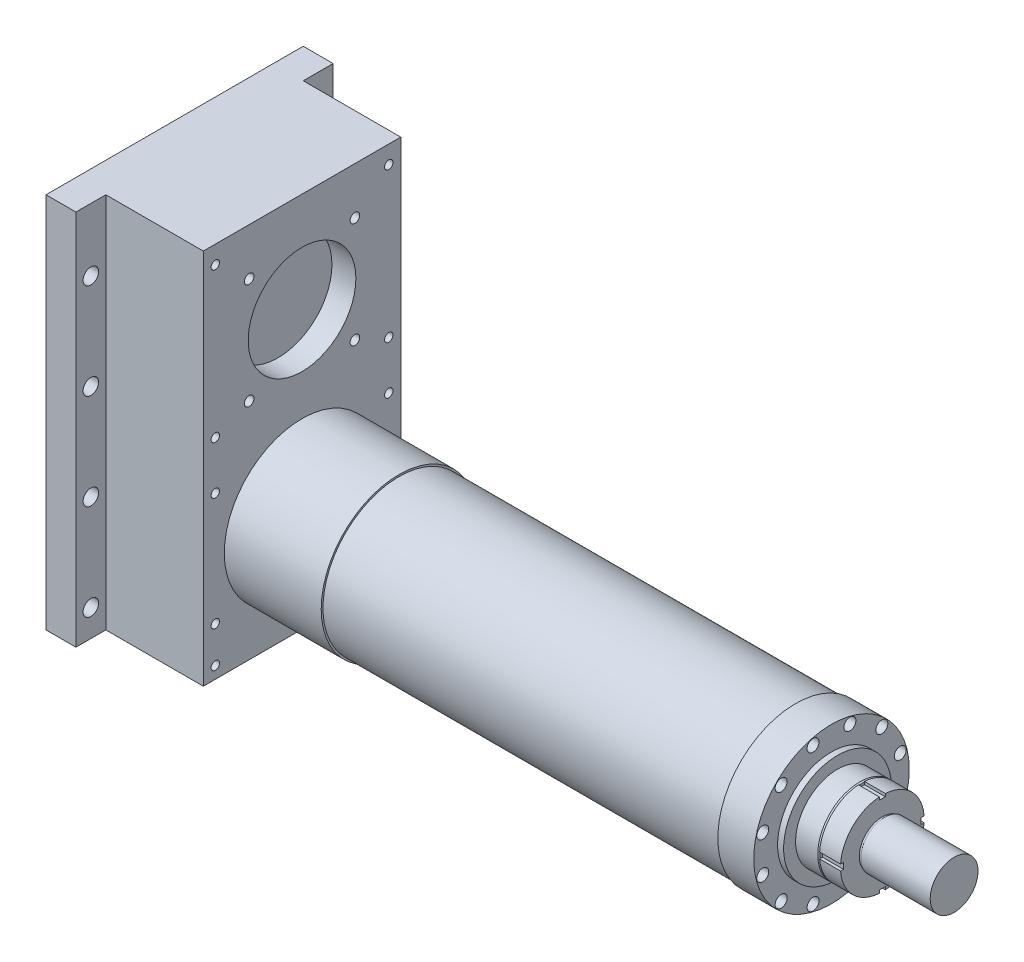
ISO-10303-21;
HEADER;
FILE_DESCRIPTION(('STEP AP214'),'2;1');
FILE_NAME('part.step','',(''),(''),'','','');
FILE_SCHEMA(('AUTOMOTIVE_DESIGN { 1 0 10303 214 1 1 1 1 }'));
ENDSEC;
DATA;
#1=APPLICATION_CONTEXT('core data for automotive mechanical design processes');
#2=APPLICATION_PROTOCOL_DEFINITION('international standard','automotive_design',2000,#1);
#3=PRODUCT_CONTEXT('',#1,'mechanical');
#4=PRODUCT('Part','Part','',(#3));
#5=PRODUCT_RELATED_PRODUCT_CATEGORY('part','',(#4));
#6=PRODUCT_DEFINITION_FORMATION('','',#4);
#7=PRODUCT_DEFINITION_CONTEXT('part definition',#1,'design');
#8=PRODUCT_DEFINITION('design','',#6,#7);
#9=PRODUCT_DEFINITION_SHAPE('','',#8);
#10=(LENGTH_UNIT() NAMED_UNIT(*) SI_UNIT(.MILLI.,.METRE.));
#11=(NAMED_UNIT(*) PLANE_ANGLE_UNIT() SI_UNIT($,.RADIAN.));
#12=(NAMED_UNIT(*) SI_UNIT($,.STERADIAN.) SOLID_ANGLE_UNIT());
#13=UNCERTAINTY_MEASURE_WITH_UNIT(LENGTH_MEASURE(1.E-05),#10,'distance_accuracy_value','');
#14=(GEOMETRIC_REPRESENTATION_CONTEXT(3) GLOBAL_UNCERTAINTY_ASSIGNED_CONTEXT((#13)) GLOBAL_UNIT_ASSIGNED_CONTEXT((#10,
#11,#12)) REPRESENTATION_CONTEXT('',''));
#15=CARTESIAN_POINT('',(0.,0.,0.));
#16=DIRECTION('',(0.,0.,1.));
#17=DIRECTION('',(1.,0.,0.));
#18=AXIS2_PLACEMENT_3D('',#15,#16,#17);
#19=CARTESIAN_POINT('',(-325.,455.,165.));
#20=DIRECTION('',(0.,0.,-1.));
#21=DIRECTION('',(0.,1.,0.));
#22=AXIS2_PLACEMENT_3D('',#19,#20,#21);
#23=PLANE('',#22);
#24=DIRECTION('',(0.,1.,0.));
#25=VECTOR('',#24,1.);
#26=CARTESIAN_POINT('',(-162.,455.,165.));
#27=LINE('',#26,#25);
#28=CARTESIAN_POINT('',(-162.,-175.,165.));
#29=VERTEX_POINT('',#28);
#30=CARTESIAN_POINT('',(-162.,455.,165.));
#31=VERTEX_POINT('',#30);
#32=EDGE_CURVE('E235',#29,#31,#27,.T.);
#33=ORIENTED_EDGE('',*,*,#32,.T.);
#34=DIRECTION('',(1.,0.,0.));
#35=VECTOR('',#34,1.);
#36=CARTESIAN_POINT('',(-325.,455.,165.));
#37=LINE('',#36,#35);
#38=CARTESIAN_POINT('',(-325.,455.,165.));
#39=VERTEX_POINT('',#38);
#40=EDGE_CURVE('E12',#39,#31,#37,.T.);
#41=ORIENTED_EDGE('',*,*,#40,.F.);
#42=DIRECTION('',(0.,1.,0.));
#43=VECTOR('',#42,1.);
#44=CARTESIAN_POINT('',(-325.,455.,165.));
#45=LINE('',#44,#43);
#46=CARTESIAN_POINT('',(-325.,-175.,165.));
#47=VERTEX_POINT('',#46);
#48=EDGE_CURVE('E238',#47,#39,#45,.T.);
#49=ORIENTED_EDGE('',*,*,#48,.F.);
#50=DIRECTION('',(1.,0.,0.));
#51=VECTOR('',#50,1.);
#52=CARTESIAN_POINT('',(-325.,-175.,165.));
#53=LINE('',#52,#51);
#54=EDGE_CURVE('E61',#47,#29,#53,.T.);
#55=ORIENTED_EDGE('',*,*,#54,.T.);
#56=EDGE_LOOP('',(#33,#41,#49,#55));
#57=FACE_BOUND('',#56,.T.);
#58=ADVANCED_FACE('F45',(#57),#23,.F.);
#59=CARTESIAN_POINT('',(-325.,455.,-165.));
#60=DIRECTION('',(0.,-1.,0.));
#61=DIRECTION('',(0.,0.,-1.));
#62=AXIS2_PLACEMENT_3D('',#59,#60,#61);
#63=PLANE('',#62);
#64=DIRECTION('',(0.,0.,-1.));
#65=VECTOR('',#64,1.);
#66=CARTESIAN_POINT('',(-162.,455.,-165.));
#67=LINE('',#66,#65);
#68=CARTESIAN_POINT('',(-162.,455.,-165.));
#69=VERTEX_POINT('',#68);
#70=EDGE_CURVE('E244',#31,#69,#67,.T.);
#71=ORIENTED_EDGE('',*,*,#70,.T.);
#72=DIRECTION('',(1.,0.,0.));
#73=VECTOR('',#72,1.);
#74=CARTESIAN_POINT('',(-325.,455.,-165.));
#75=LINE('',#74,#73);
#76=CARTESIAN_POINT('',(-325.,455.,-165.));
#77=VERTEX_POINT('',#76);
#78=EDGE_CURVE('E53',#77,#69,#75,.T.);
#79=ORIENTED_EDGE('',*,*,#78,.F.);
#80=DIRECTION('',(0.,0.,-1.));
#81=VECTOR('',#80,1.);
#82=CARTESIAN_POINT('',(-325.,455.,-215.));
#83=LINE('',#82,#81);
#84=CARTESIAN_POINT('',(-325.,455.,-215.));
#85=VERTEX_POINT('',#84);
#86=EDGE_CURVE('E276',#77,#85,#83,.T.);
#87=ORIENTED_EDGE('',*,*,#86,.T.);
#88=DIRECTION('',(1.,0.,0.));
#89=VECTOR('',#88,1.);
#90=CARTESIAN_POINT('',(-375.,455.,-215.));
#91=LINE('',#90,#89);
#92=CARTESIAN_POINT('',(-375.,455.,-215.));
#93=VERTEX_POINT('',#92);
#94=EDGE_CURVE('E123',#93,#85,#91,.T.);
#95=ORIENTED_EDGE('',*,*,#94,.F.);
#96=DIRECTION('',(0.,0.,-1.));
#97=VECTOR('',#96,1.);
#98=CARTESIAN_POINT('',(-375.,455.,-215.));
#99=LINE('',#98,#97);
#100=CARTESIAN_POINT('',(-375.,455.,215.));
#101=VERTEX_POINT('',#100);
#102=EDGE_CURVE('E115',#101,#93,#99,.T.);
#103=ORIENTED_EDGE('',*,*,#102,.F.);
#104=DIRECTION('',(1.,0.,0.));
#105=VECTOR('',#104,1.);
#106=CARTESIAN_POINT('',(-375.,455.,215.));
#107=LINE('',#106,#105);
#108=CARTESIAN_POINT('',(-325.,455.,215.));
#109=VERTEX_POINT('',#108);
#110=EDGE_CURVE('E120',#101,#109,#107,.T.);
#111=ORIENTED_EDGE('',*,*,#110,.T.);
#112=EDGE_CURVE('E263',#109,#39,#83,.T.);
#113=ORIENTED_EDGE('',*,*,#112,.T.);
#114=ORIENTED_EDGE('',*,*,#40,.T.);
#115=EDGE_LOOP('',(#71,#79,#87,#95,#103,#111,#113,#114));
#116=FACE_BOUND('',#115,.T.);
#117=ADVANCED_FACE('F117',(#116),#63,.F.);
#118=CARTESIAN_POINT('',(-325.,455.,-165.));
#119=DIRECTION('',(0.,0.,1.));
#120=DIRECTION('',(0.,-1.,0.));
#121=AXIS2_PLACEMENT_3D('',#118,#119,#120);
#122=PLANE('',#121);
#123=DIRECTION('',(0.,-1.,0.));
#124=VECTOR('',#123,1.);
#125=CARTESIAN_POINT('',(-162.,455.,-165.));
#126=LINE('',#125,#124);
#127=CARTESIAN_POINT('',(-162.,-175.,-165.));
#128=VERTEX_POINT('',#127);
#129=EDGE_CURVE('E80',#69,#128,#126,.T.);
#130=ORIENTED_EDGE('',*,*,#129,.T.);
#131=DIRECTION('',(1.,0.,0.));
#132=VECTOR('',#131,1.);
#133=CARTESIAN_POINT('',(-325.,-175.,-165.));
#134=LINE('',#133,#132);
#135=CARTESIAN_POINT('',(-325.,-175.,-165.));
#136=VERTEX_POINT('',#135);
#137=EDGE_CURVE('E249',#136,#128,#134,.T.);
#138=ORIENTED_EDGE('',*,*,#137,.F.);
#139=DIRECTION('',(0.,-1.,0.));
#140=VECTOR('',#139,1.);
#141=CARTESIAN_POINT('',(-325.,455.,-165.));
#142=LINE('',#141,#140);
#143=EDGE_CURVE('E240',#77,#136,#142,.T.);
#144=ORIENTED_EDGE('',*,*,#143,.F.);
#145=ORIENTED_EDGE('',*,*,#78,.T.);
#146=EDGE_LOOP('',(#130,#138,#144,#145));
#147=FACE_BOUND('',#146,.T.);
#148=ADVANCED_FACE('F251',(#147),#122,.F.);
#149=CARTESIAN_POINT('',(-325.,-175.,-165.));
#150=DIRECTION('',(0.,1.,0.));
#151=DIRECTION('',(0.,0.,1.));
#152=AXIS2_PLACEMENT_3D('',#149,#150,#151);
#153=PLANE('',#152);
#154=DIRECTION('',(0.,0.,1.));
#155=VECTOR('',#154,1.);
#156=CARTESIAN_POINT('',(-162.,-175.,-165.));
#157=LINE('',#156,#155);
#158=EDGE_CURVE('E83',#128,#29,#157,.T.);
#159=ORIENTED_EDGE('',*,*,#158,.T.);
#160=ORIENTED_EDGE('',*,*,#54,.F.);
#161=DIRECTION('',(0.,0.,1.));
#162=VECTOR('',#161,1.);
#163=CARTESIAN_POINT('',(-325.,-175.,-215.));
#164=LINE('',#163,#162);
#165=CARTESIAN_POINT('',(-325.,-175.,215.));
#166=VERTEX_POINT('',#165);
#167=EDGE_CURVE('E258',#47,#166,#164,.T.);
#168=ORIENTED_EDGE('',*,*,#167,.T.);
#169=DIRECTION('',(1.,0.,0.));
#170=VECTOR('',#169,1.);
#171=CARTESIAN_POINT('',(-375.,-175.,215.));
#172=LINE('',#171,#170);
#173=CARTESIAN_POINT('',(-375.,-175.,215.));
#174=VERTEX_POINT('',#173);
#175=EDGE_CURVE('E267',#174,#166,#172,.T.);
#176=ORIENTED_EDGE('',*,*,#175,.F.);
#177=DIRECTION('',(0.,0.,1.));
#178=VECTOR('',#177,1.);
#179=CARTESIAN_POINT('',(-375.,-175.,-215.));
#180=LINE('',#179,#178);
#181=CARTESIAN_POINT('',(-375.,-175.,-215.));
#182=VERTEX_POINT('',#181);
#183=EDGE_CURVE('E133',#182,#174,#180,.T.);
#184=ORIENTED_EDGE('',*,*,#183,.F.);
#185=DIRECTION('',(1.,0.,0.));
#186=VECTOR('',#185,1.);
#187=CARTESIAN_POINT('',(-375.,-175.,-215.));
#188=LINE('',#187,#186);
#189=CARTESIAN_POINT('',(-325.,-175.,-215.));
#190=VERTEX_POINT('',#189);
#191=EDGE_CURVE('E147',#182,#190,#188,.T.);
#192=ORIENTED_EDGE('',*,*,#191,.T.);
#193=EDGE_CURVE('E137',#190,#136,#164,.T.);
#194=ORIENTED_EDGE('',*,*,#193,.T.);
#195=ORIENTED_EDGE('',*,*,#137,.T.);
#196=EDGE_LOOP('',(#159,#160,#168,#176,#184,#192,#194,#195));
#197=FACE_BOUND('',#196,.T.);
#198=ADVANCED_FACE('F271',(#197),#153,.F.);
#199=CARTESIAN_POINT('',(-162.,0.,0.));
#200=DIRECTION('',(-1.,0.,0.));
#201=DIRECTION('',(0.,0.,1.));
#202=AXIS2_PLACEMENT_3D('',#199,#200,#201);
#203=PLANE('',#202);
#204=CARTESIAN_POINT('',(-162.,-155.,145.));
#205=DIRECTION('',(1.,0.,0.));
#206=DIRECTION('',(0.,0.,-1.));
#207=AXIS2_PLACEMENT_3D('',#204,#205,#206);
#208=CIRCLE('',#207,7.00000000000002);
#209=CARTESIAN_POINT('',(-162.,-155.,138.));
#210=VERTEX_POINT('',#209);
#211=EDGE_CURVE('E175',#210,#210,#208,.T.);
#212=ORIENTED_EDGE('',*,*,#211,.F.);
#213=EDGE_LOOP('',(#212));
#214=FACE_BOUND('',#213,.T.);
#215=CARTESIAN_POINT('',(-162.,-94.5,145.));
#216=DIRECTION('',(1.,0.,0.));
#217=DIRECTION('',(0.,0.,-1.));
#218=AXIS2_PLACEMENT_3D('',#215,#216,#217);
#219=CIRCLE('',#218,7.00000000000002);
#220=CARTESIAN_POINT('',(-162.,-94.5,138.));
#221=VERTEX_POINT('',#220);
#222=EDGE_CURVE('E200',#221,#221,#219,.T.);
#223=ORIENTED_EDGE('',*,*,#222,.F.);
#224=EDGE_LOOP('',(#223));
#225=FACE_BOUND('',#224,.T.);
#226=CARTESIAN_POINT('',(-162.,94.5,145.));
#227=DIRECTION('',(1.,0.,0.));
#228=DIRECTION('',(0.,0.,-1.));
#229=AXIS2_PLACEMENT_3D('',#226,#227,#228);
#230=CIRCLE('',#229,7.00000000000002);
#231=CARTESIAN_POINT('',(-162.,94.5,138.));
#232=VERTEX_POINT('',#231);
#233=EDGE_CURVE('E194',#232,#232,#230,.T.);
#234=ORIENTED_EDGE('',*,*,#233,.F.);
#235=EDGE_LOOP('',(#234));
#236=FACE_BOUND('',#235,.T.);
#237=CARTESIAN_POINT('',(-162.,199.611652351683,88.3883476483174));
#238=DIRECTION('',(1.,0.,0.));
#239=DIRECTION('',(0.,0.,-1.));
#240=AXIS2_PLACEMENT_3D('',#237,#238,#239);
#241=CIRCLE('',#240,8.00000000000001);
#242=CARTESIAN_POINT('',(-162.,199.611652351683,80.3883476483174));
#243=VERTEX_POINT('',#242);
#244=EDGE_CURVE('E188',#243,#243,#241,.T.);
#245=ORIENTED_EDGE('',*,*,#244,.F.);
#246=EDGE_LOOP('',(#245));
#247=FACE_BOUND('',#246,.T.);
#248=CARTESIAN_POINT('',(-162.,199.611652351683,-88.3883476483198));
#249=DIRECTION('',(1.,0.,0.));
#250=DIRECTION('',(0.,0.,-1.));
#251=AXIS2_PLACEMENT_3D('',#248,#249,#250);
#252=CIRCLE('',#251,8.00000000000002);
#253=CARTESIAN_POINT('',(-162.,199.611652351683,-96.3883476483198));
#254=VERTEX_POINT('',#253);
#255=EDGE_CURVE('E187',#254,#254,#252,.T.);
#256=ORIENTED_EDGE('',*,*,#255,.F.);
#257=EDGE_LOOP('',(#256));
#258=FACE_BOUND('',#257,.T.);
#259=CARTESIAN_POINT('',(-162.,376.38834764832,-88.3883476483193));
#260=DIRECTION('',(1.,0.,0.));
#261=DIRECTION('',(0.,0.,-1.));
#262=AXIS2_PLACEMENT_3D('',#259,#260,#261);
#263=CIRCLE('',#262,7.99999999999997);
#264=CARTESIAN_POINT('',(-162.,376.38834764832,-96.3883476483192));
#265=VERTEX_POINT('',#264);
#266=EDGE_CURVE('E224',#265,#265,#263,.T.);
#267=ORIENTED_EDGE('',*,*,#266,.F.);
#268=EDGE_LOOP('',(#267));
#269=FACE_BOUND('',#268,.T.);
#270=CARTESIAN_POINT('',(-162.,175.,145.));
#271=DIRECTION('',(1.,0.,0.));
#272=DIRECTION('',(0.,0.,-1.));
#273=AXIS2_PLACEMENT_3D('',#270,#271,#272);
#274=CIRCLE('',#273,7.00000000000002);
#275=CARTESIAN_POINT('',(-162.,175.,138.));
#276=VERTEX_POINT('',#275);
#277=EDGE_CURVE('E218',#276,#276,#274,.T.);
#278=ORIENTED_EDGE('',*,*,#277,.F.);
#279=EDGE_LOOP('',(#278));
#280=FACE_BOUND('',#279,.T.);
#281=CARTESIAN_POINT('',(-162.,376.388347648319,88.3883476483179));
#282=DIRECTION('',(1.,0.,0.));
#283=DIRECTION('',(0.,0.,-1.));
#284=AXIS2_PLACEMENT_3D('',#281,#282,#283);
#285=CIRCLE('',#284,8.00000000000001);
#286=CARTESIAN_POINT('',(-162.,376.388347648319,80.3883476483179));
#287=VERTEX_POINT('',#286);
#288=EDGE_CURVE('E212',#287,#287,#285,.T.);
#289=ORIENTED_EDGE('',*,*,#288,.F.);
#290=EDGE_LOOP('',(#289));
#291=FACE_BOUND('',#290,.T.);
#292=CARTESIAN_POINT('',(-162.,425.,-145.));
#293=DIRECTION('',(1.,0.,0.));
#294=DIRECTION('',(0.,0.,1.));
#295=AXIS2_PLACEMENT_3D('',#292,#293,#294);
#296=CIRCLE('',#295,7.00000000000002);
#297=CARTESIAN_POINT('',(-162.,425.,-138.));
#298=VERTEX_POINT('',#297);
#299=EDGE_CURVE('E142',#298,#298,#296,.T.);
#300=ORIENTED_EDGE('',*,*,#299,.F.);
#301=EDGE_LOOP('',(#300));
#302=FACE_BOUND('',#301,.T.);
#303=CARTESIAN_POINT('',(-162.,175.,-145.));
#304=DIRECTION('',(1.,0.,0.));
#305=DIRECTION('',(0.,0.,1.));
#306=AXIS2_PLACEMENT_3D('',#303,#304,#305);
#307=CIRCLE('',#306,7.00000000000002);
#308=CARTESIAN_POINT('',(-162.,175.,-138.));
#309=VERTEX_POINT('',#308);
#310=EDGE_CURVE('E155',#309,#309,#307,.T.);
#311=ORIENTED_EDGE('',*,*,#310,.F.);
#312=EDGE_LOOP('',(#311));
#313=FACE_BOUND('',#312,.T.);
#314=CARTESIAN_POINT('',(-162.,425.,145.));
#315=DIRECTION('',(1.,0.,0.));
#316=DIRECTION('',(0.,0.,-1.));
#317=AXIS2_PLACEMENT_3D('',#314,#315,#316);
#318=CIRCLE('',#317,7.00000000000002);
#319=CARTESIAN_POINT('',(-162.,425.,138.));
#320=VERTEX_POINT('',#319);
#321=EDGE_CURVE('E176',#320,#320,#318,.T.);
#322=ORIENTED_EDGE('',*,*,#321,.F.);
#323=EDGE_LOOP('',(#322));
#324=FACE_BOUND('',#323,.T.);
#325=CARTESIAN_POINT('',(-162.,-155.,-145.));
#326=DIRECTION('',(1.,0.,0.));
#327=DIRECTION('',(0.,0.,1.));
#328=AXIS2_PLACEMENT_3D('',#325,#326,#327);
#329=CIRCLE('',#328,7.00000000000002);
#330=CARTESIAN_POINT('',(-162.,-155.,-138.));
#331=VERTEX_POINT('',#330);
#332=EDGE_CURVE('E163',#331,#331,#329,.T.);
#333=ORIENTED_EDGE('',*,*,#332,.F.);
#334=EDGE_LOOP('',(#333));
#335=FACE_BOUND('',#334,.T.);
#336=CARTESIAN_POINT('',(-162.,-94.5000000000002,-145.));
#337=DIRECTION('',(1.,0.,0.));
#338=DIRECTION('',(0.,0.,1.));
#339=AXIS2_PLACEMENT_3D('',#336,#337,#338);
#340=CIRCLE('',#339,7.00000000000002);
#341=CARTESIAN_POINT('',(-162.,-94.5000000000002,-138.));
#342=VERTEX_POINT('',#341);
#343=EDGE_CURVE('E164',#342,#342,#340,.T.);
#344=ORIENTED_EDGE('',*,*,#343,.F.);
#345=EDGE_LOOP('',(#344));
#346=FACE_BOUND('',#345,.T.);
#347=CARTESIAN_POINT('',(-162.,94.4999999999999,-145.));
#348=DIRECTION('',(1.,0.,0.));
#349=DIRECTION('',(0.,0.,1.));
#350=AXIS2_PLACEMENT_3D('',#347,#348,#349);
#351=CIRCLE('',#350,7.00000000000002);
#352=CARTESIAN_POINT('',(-162.,94.4999999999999,-138.));
#353=VERTEX_POINT('',#352);
#354=EDGE_CURVE('E154',#353,#353,#351,.T.);
#355=ORIENTED_EDGE('',*,*,#354,.F.);
#356=EDGE_LOOP('',(#355));
#357=FACE_BOUND('',#356,.T.);
#358=CARTESIAN_POINT('',(-162.,288.,0.));
#359=DIRECTION('',(1.,0.,0.));
#360=DIRECTION('',(0.,0.,-1.));
#361=AXIS2_PLACEMENT_3D('',#358,#359,#360);
#362=CIRCLE('',#361,90.);
#363=CARTESIAN_POINT('',(-162.,288.,-90.));
#364=VERTEX_POINT('',#363);
#365=EDGE_CURVE('E211',#364,#364,#362,.T.);
#366=ORIENTED_EDGE('',*,*,#365,.F.);
#367=EDGE_LOOP('',(#366));
#368=FACE_BOUND('',#367,.T.);
#369=ORIENTED_EDGE('',*,*,#32,.F.);
#370=ORIENTED_EDGE('',*,*,#158,.F.);
#371=ORIENTED_EDGE('',*,*,#129,.F.);
#372=ORIENTED_EDGE('',*,*,#70,.F.);
#373=EDGE_LOOP('',(#369,#370,#371,#372));
#374=FACE_BOUND('',#373,.T.);
#375=ADVANCED_FACE('F255',(#214,#225,#236,#247,#258,#269,#280,#291,#302,#313,#324,#335,#346,
#357,#368,#374),#203,.F.);
#376=CARTESIAN_POINT('',(-202.,288.,0.));
#377=DIRECTION('',(1.,0.,0.));
#378=DIRECTION('',(0.,0.,-1.));
#379=AXIS2_PLACEMENT_3D('',#376,#377,#378);
#380=CYLINDRICAL_SURFACE('',#379,90.);
#381=CARTESIAN_POINT('',(-202.,288.,0.));
#382=DIRECTION('',(1.,0.,0.));
#383=DIRECTION('',(0.,0.,-1.));
#384=AXIS2_PLACEMENT_3D('',#381,#382,#383);
#385=CIRCLE('',#384,90.);
#386=CARTESIAN_POINT('',(-202.,288.,-90.));
#387=VERTEX_POINT('',#386);
#388=EDGE_CURVE('E232',#387,#387,#385,.T.);
#389=ORIENTED_EDGE('',*,*,#388,.F.);
#390=EDGE_LOOP('',(#389));
#391=FACE_BOUND('',#390,.T.);
#392=ORIENTED_EDGE('',*,*,#365,.T.);
#393=EDGE_LOOP('',(#392));
#394=FACE_BOUND('',#393,.T.);
#395=ADVANCED_FACE('F360',(#391,#394),#380,.F.);
#396=CARTESIAN_POINT('',(-202.,288.,0.));
#397=DIRECTION('',(1.,0.,0.));
#398=DIRECTION('',(0.,0.,-1.));
#399=AXIS2_PLACEMENT_3D('',#396,#397,#398);
#400=PLANE('',#399);
#401=ORIENTED_EDGE('',*,*,#388,.T.);
#402=EDGE_LOOP('',(#401));
#403=FACE_BOUND('',#402,.T.);
#404=ADVANCED_FACE('F364',(#403),#400,.T.);
#405=CARTESIAN_POINT('',(-202.,94.4999999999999,-145.));
#406=DIRECTION('',(1.,0.,0.));
#407=DIRECTION('',(0.,0.,-1.));
#408=AXIS2_PLACEMENT_3D('',#405,#406,#407);
#409=CYLINDRICAL_SURFACE('',#408,7.00000000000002);
#410=CARTESIAN_POINT('',(-202.,94.4999999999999,-145.));
#411=DIRECTION('',(1.,0.,0.));
#412=DIRECTION('',(0.,0.,1.));
#413=AXIS2_PLACEMENT_3D('',#410,#411,#412);
#414=CIRCLE('',#413,7.00000000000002);
#415=CARTESIAN_POINT('',(-202.,94.4999999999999,-138.));
#416=VERTEX_POINT('',#415);
#417=EDGE_CURVE('E167',#416,#416,#414,.T.);
#418=ORIENTED_EDGE('',*,*,#417,.F.);
#419=EDGE_LOOP('',(#418));
#420=FACE_BOUND('',#419,.T.);
#421=ORIENTED_EDGE('',*,*,#354,.T.);
#422=EDGE_LOOP('',(#421));
#423=FACE_BOUND('',#422,.T.);
#424=ADVANCED_FACE('F368',(#420,#423),#409,.F.);
#425=CARTESIAN_POINT('',(-202.,94.4999999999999,-145.));
#426=DIRECTION('',(-1.,0.,0.));
#427=DIRECTION('',(0.,0.,1.));
#428=AXIS2_PLACEMENT_3D('',#425,#426,#427);
#429=PLANE('',#428);
#430=ORIENTED_EDGE('',*,*,#417,.T.);
#431=EDGE_LOOP('',(#430));
#432=FACE_BOUND('',#431,.T.);
#433=ADVANCED_FACE('F455',(#432),#429,.F.);
#434=CARTESIAN_POINT('',(-202.,-94.5000000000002,-145.));
#435=DIRECTION('',(1.,0.,0.));
#436=DIRECTION('',(0.,0.,-1.));
#437=AXIS2_PLACEMENT_3D('',#434,#435,#436);
#438=CYLINDRICAL_SURFACE('',#437,7.00000000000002);
#439=CARTESIAN_POINT('',(-202.,-94.5000000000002,-145.));
#440=DIRECTION('',(1.,0.,0.));
#441=DIRECTION('',(0.,0.,1.));
#442=AXIS2_PLACEMENT_3D('',#439,#440,#441);
#443=CIRCLE('',#442,7.00000000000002);
#444=CARTESIAN_POINT('',(-202.,-94.5000000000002,-138.));
#445=VERTEX_POINT('',#444);
#446=EDGE_CURVE('E160',#445,#445,#443,.T.);
#447=ORIENTED_EDGE('',*,*,#446,.F.);
#448=EDGE_LOOP('',(#447));
#449=FACE_BOUND('',#448,.T.);
#450=ORIENTED_EDGE('',*,*,#343,.T.);
#451=EDGE_LOOP('',(#450));
#452=FACE_BOUND('',#451,.T.);
#453=ADVANCED_FACE('F459',(#449,#452),#438,.F.);
#454=CARTESIAN_POINT('',(-202.,-94.5000000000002,-145.));
#455=DIRECTION('',(-1.,0.,0.));
#456=DIRECTION('',(0.,0.,1.));
#457=AXIS2_PLACEMENT_3D('',#454,#455,#456);
#458=PLANE('',#457);
#459=ORIENTED_EDGE('',*,*,#446,.T.);
#460=EDGE_LOOP('',(#459));
#461=FACE_BOUND('',#460,.T.);
#462=ADVANCED_FACE('F439',(#461),#458,.F.);
#463=CARTESIAN_POINT('',(-202.,-155.,-145.));
#464=DIRECTION('',(1.,0.,0.));
#465=DIRECTION('',(0.,0.,-1.));
#466=AXIS2_PLACEMENT_3D('',#463,#464,#465);
#467=CYLINDRICAL_SURFACE('',#466,7.00000000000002);
#468=CARTESIAN_POINT('',(-202.,-155.,-145.));
#469=DIRECTION('',(1.,0.,0.));
#470=DIRECTION('',(0.,0.,1.));
#471=AXIS2_PLACEMENT_3D('',#468,#469,#470);
#472=CIRCLE('',#471,7.00000000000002);
#473=CARTESIAN_POINT('',(-202.,-155.,-138.));
#474=VERTEX_POINT('',#473);
#475=EDGE_CURVE('E179',#474,#474,#472,.T.);
#476=ORIENTED_EDGE('',*,*,#475,.F.);
#477=EDGE_LOOP('',(#476));
#478=FACE_BOUND('',#477,.T.);
#479=ORIENTED_EDGE('',*,*,#332,.T.);
#480=EDGE_LOOP('',(#479));
#481=FACE_BOUND('',#480,.T.);
#482=ADVANCED_FACE('F435',(#478,#481),#467,.F.);
#483=CARTESIAN_POINT('',(-202.,-155.,-145.));
#484=DIRECTION('',(-1.,0.,0.));
#485=DIRECTION('',(0.,0.,1.));
#486=AXIS2_PLACEMENT_3D('',#483,#484,#485);
#487=PLANE('',#486);
#488=ORIENTED_EDGE('',*,*,#475,.T.);
#489=EDGE_LOOP('',(#488));
#490=FACE_BOUND('',#489,.T.);
#491=ADVANCED_FACE('F438',(#490),#487,.F.);
#492=CARTESIAN_POINT('',(-202.,425.,145.));
#493=DIRECTION('',(1.,0.,0.));
#494=DIRECTION('',(0.,0.,-1.));
#495=AXIS2_PLACEMENT_3D('',#492,#493,#494);
#496=CYLINDRICAL_SURFACE('',#495,7.00000000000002);
#497=CARTESIAN_POINT('',(-202.,425.,145.));
#498=DIRECTION('',(1.,0.,0.));
#499=DIRECTION('',(0.,0.,-1.));
#500=AXIS2_PLACEMENT_3D('',#497,#498,#499);
#501=CIRCLE('',#500,7.00000000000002);
#502=CARTESIAN_POINT('',(-202.,425.,138.));
#503=VERTEX_POINT('',#502);
#504=EDGE_CURVE('E172',#503,#503,#501,.T.);
#505=ORIENTED_EDGE('',*,*,#504,.F.);
#506=EDGE_LOOP('',(#505));
#507=FACE_BOUND('',#506,.T.);
#508=ORIENTED_EDGE('',*,*,#321,.T.);
#509=EDGE_LOOP('',(#508));
#510=FACE_BOUND('',#509,.T.);
#511=ADVANCED_FACE('F443',(#507,#510),#496,.F.);
#512=CARTESIAN_POINT('',(-202.,425.,145.));
#513=DIRECTION('',(1.,0.,0.));
#514=DIRECTION('',(0.,0.,-1.));
#515=AXIS2_PLACEMENT_3D('',#512,#513,#514);
#516=PLANE('',#515);
#517=ORIENTED_EDGE('',*,*,#504,.T.);
#518=EDGE_LOOP('',(#517));
#519=FACE_BOUND('',#518,.T.);
#520=ADVANCED_FACE('F447',(#519),#516,.T.);
#521=CARTESIAN_POINT('',(-202.,175.,-145.));
#522=DIRECTION('',(1.,0.,0.));
#523=DIRECTION('',(0.,0.,-1.));
#524=AXIS2_PLACEMENT_3D('',#521,#522,#523);
#525=CYLINDRICAL_SURFACE('',#524,7.00000000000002);
#526=CARTESIAN_POINT('',(-202.,175.,-145.));
#527=DIRECTION('',(1.,0.,0.));
#528=DIRECTION('',(0.,0.,1.));
#529=AXIS2_PLACEMENT_3D('',#526,#527,#528);
#530=CIRCLE('',#529,7.00000000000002);
#531=CARTESIAN_POINT('',(-202.,175.,-138.));
#532=VERTEX_POINT('',#531);
#533=EDGE_CURVE('E151',#532,#532,#530,.T.);
#534=ORIENTED_EDGE('',*,*,#533,.F.);
#535=EDGE_LOOP('',(#534));
#536=FACE_BOUND('',#535,.T.);
#537=ORIENTED_EDGE('',*,*,#310,.T.);
#538=EDGE_LOOP('',(#537));
#539=FACE_BOUND('',#538,.T.);
#540=ADVANCED_FACE('F451',(#536,#539),#525,.F.);
#541=CARTESIAN_POINT('',(-202.,175.,-145.));
#542=DIRECTION('',(-1.,0.,0.));
#543=DIRECTION('',(0.,0.,1.));
#544=AXIS2_PLACEMENT_3D('',#541,#542,#543);
#545=PLANE('',#544);
#546=ORIENTED_EDGE('',*,*,#533,.T.);
#547=EDGE_LOOP('',(#546));
#548=FACE_BOUND('',#547,.T.);
#549=ADVANCED_FACE('F470',(#548),#545,.F.);
#550=CARTESIAN_POINT('',(-202.,425.,-145.));
#551=DIRECTION('',(1.,0.,0.));
#552=DIRECTION('',(0.,0.,-1.));
#553=AXIS2_PLACEMENT_3D('',#550,#551,#552);
#554=CYLINDRICAL_SURFACE('',#553,7.00000000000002);
#555=CARTESIAN_POINT('',(-202.,425.,-145.));
#556=DIRECTION('',(1.,0.,0.));
#557=DIRECTION('',(0.,0.,1.));
#558=AXIS2_PLACEMENT_3D('',#555,#556,#557);
#559=CIRCLE('',#558,7.00000000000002);
#560=CARTESIAN_POINT('',(-202.,425.,-138.));
#561=VERTEX_POINT('',#560);
#562=EDGE_CURVE('E145',#561,#561,#559,.T.);
#563=ORIENTED_EDGE('',*,*,#562,.F.);
#564=EDGE_LOOP('',(#563));
#565=FACE_BOUND('',#564,.T.);
#566=ORIENTED_EDGE('',*,*,#299,.T.);
#567=EDGE_LOOP('',(#566));
#568=FACE_BOUND('',#567,.T.);
#569=ADVANCED_FACE('F467',(#565,#568),#554,.F.);
#570=CARTESIAN_POINT('',(-202.,425.,-145.));
#571=DIRECTION('',(-1.,0.,0.));
#572=DIRECTION('',(0.,0.,1.));
#573=AXIS2_PLACEMENT_3D('',#570,#571,#572);
#574=PLANE('',#573);
#575=ORIENTED_EDGE('',*,*,#562,.T.);
#576=EDGE_LOOP('',(#575));
#577=FACE_BOUND('',#576,.T.);
#578=ADVANCED_FACE('F399',(#577),#574,.F.);
#579=CARTESIAN_POINT('',(-202.,376.388347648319,88.3883476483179));
#580=DIRECTION('',(1.,0.,0.));
#581=DIRECTION('',(0.,0.,-1.));
#582=AXIS2_PLACEMENT_3D('',#579,#580,#581);
#583=CYLINDRICAL_SURFACE('',#582,8.00000000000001);
#584=CARTESIAN_POINT('',(-202.,376.388347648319,88.3883476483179));
#585=DIRECTION('',(1.,0.,0.));
#586=DIRECTION('',(0.,0.,-1.));
#587=AXIS2_PLACEMENT_3D('',#584,#585,#586);
#588=CIRCLE('',#587,8.00000000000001);
#589=CARTESIAN_POINT('',(-202.,376.388347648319,80.3883476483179));
#590=VERTEX_POINT('',#589);
#591=EDGE_CURVE('E208',#590,#590,#588,.T.);
#592=ORIENTED_EDGE('',*,*,#591,.F.);
#593=EDGE_LOOP('',(#592));
#594=FACE_BOUND('',#593,.T.);
#595=ORIENTED_EDGE('',*,*,#288,.T.);
#596=EDGE_LOOP('',(#595));
#597=FACE_BOUND('',#596,.T.);
#598=ADVANCED_FACE('F396',(#594,#597),#583,.F.);
#599=CARTESIAN_POINT('',(-202.,376.388347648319,88.3883476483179));
#600=DIRECTION('',(1.,0.,0.));
#601=DIRECTION('',(0.,0.,-1.));
#602=AXIS2_PLACEMENT_3D('',#599,#600,#601);
#603=PLANE('',#602);
#604=ORIENTED_EDGE('',*,*,#591,.T.);
#605=EDGE_LOOP('',(#604));
#606=FACE_BOUND('',#605,.T.);
#607=ADVANCED_FACE('F391',(#606),#603,.T.);
#608=CARTESIAN_POINT('',(-202.,175.,145.));
#609=DIRECTION('',(1.,0.,0.));
#610=DIRECTION('',(0.,0.,-1.));
#611=AXIS2_PLACEMENT_3D('',#608,#609,#610);
#612=CYLINDRICAL_SURFACE('',#611,7.00000000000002);
#613=CARTESIAN_POINT('',(-202.,175.,145.));
#614=DIRECTION('',(1.,0.,0.));
#615=DIRECTION('',(0.,0.,-1.));
#616=AXIS2_PLACEMENT_3D('',#613,#614,#615);
#617=CIRCLE('',#616,7.00000000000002);
#618=CARTESIAN_POINT('',(-202.,175.,138.));
#619=VERTEX_POINT('',#618);
#620=EDGE_CURVE('E215',#619,#619,#617,.T.);
#621=ORIENTED_EDGE('',*,*,#620,.F.);
#622=EDGE_LOOP('',(#621));
#623=FACE_BOUND('',#622,.T.);
#624=ORIENTED_EDGE('',*,*,#277,.T.);
#625=EDGE_LOOP('',(#624));
#626=FACE_BOUND('',#625,.T.);
#627=ADVANCED_FACE('F388',(#623,#626),#612,.F.);
#628=CARTESIAN_POINT('',(-202.,175.,145.));
#629=DIRECTION('',(1.,0.,0.));
#630=DIRECTION('',(0.,0.,-1.));
#631=AXIS2_PLACEMENT_3D('',#628,#629,#630);
#632=PLANE('',#631);
#633=ORIENTED_EDGE('',*,*,#620,.T.);
#634=EDGE_LOOP('',(#633));
#635=FACE_BOUND('',#634,.T.);
#636=ADVANCED_FACE('F383',(#635),#632,.T.);
#637=CARTESIAN_POINT('',(-202.,376.38834764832,-88.3883476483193));
#638=DIRECTION('',(1.,0.,0.));
#639=DIRECTION('',(0.,0.,-1.));
#640=AXIS2_PLACEMENT_3D('',#637,#638,#639);
#641=CYLINDRICAL_SURFACE('',#640,7.99999999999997);
#642=CARTESIAN_POINT('',(-202.,376.38834764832,-88.3883476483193));
#643=DIRECTION('',(1.,0.,0.));
#644=DIRECTION('',(0.,0.,-1.));
#645=AXIS2_PLACEMENT_3D('',#642,#643,#644);
#646=CIRCLE('',#645,7.99999999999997);
#647=CARTESIAN_POINT('',(-202.,376.38834764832,-96.3883476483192));
#648=VERTEX_POINT('',#647);
#649=EDGE_CURVE('E221',#648,#648,#646,.T.);
#650=ORIENTED_EDGE('',*,*,#649,.F.);
#651=EDGE_LOOP('',(#650));
#652=FACE_BOUND('',#651,.T.);
#653=ORIENTED_EDGE('',*,*,#266,.T.);
#654=EDGE_LOOP('',(#653));
#655=FACE_BOUND('',#654,.T.);
#656=ADVANCED_FACE('F380',(#652,#655),#641,.F.);
#657=CARTESIAN_POINT('',(-202.,376.38834764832,-88.3883476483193));
#658=DIRECTION('',(1.,0.,0.));
#659=DIRECTION('',(0.,0.,-1.));
#660=AXIS2_PLACEMENT_3D('',#657,#658,#659);
#661=PLANE('',#660);
#662=ORIENTED_EDGE('',*,*,#649,.T.);
#663=EDGE_LOOP('',(#662));
#664=FACE_BOUND('',#663,.T.);
#665=ADVANCED_FACE('F374',(#664),#661,.T.);
#666=CARTESIAN_POINT('',(-202.,199.611652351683,-88.3883476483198));
#667=DIRECTION('',(1.,0.,0.));
#668=DIRECTION('',(0.,0.,-1.));
#669=AXIS2_PLACEMENT_3D('',#666,#667,#668);
#670=CYLINDRICAL_SURFACE('',#669,8.00000000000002);
#671=CARTESIAN_POINT('',(-202.,199.611652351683,-88.3883476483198));
#672=DIRECTION('',(1.,0.,0.));
#673=DIRECTION('',(0.,0.,-1.));
#674=AXIS2_PLACEMENT_3D('',#671,#672,#673);
#675=CIRCLE('',#674,8.00000000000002);
#676=CARTESIAN_POINT('',(-202.,199.611652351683,-96.3883476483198));
#677=VERTEX_POINT('',#676);
#678=EDGE_CURVE('E227',#677,#677,#675,.T.);
#679=ORIENTED_EDGE('',*,*,#678,.F.);
#680=EDGE_LOOP('',(#679));
#681=FACE_BOUND('',#680,.T.);
#682=ORIENTED_EDGE('',*,*,#255,.T.);
#683=EDGE_LOOP('',(#682));
#684=FACE_BOUND('',#683,.T.);
#685=ADVANCED_FACE('F370',(#681,#684),#670,.F.);
#686=CARTESIAN_POINT('',(-202.,199.611652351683,-88.3883476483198));
#687=DIRECTION('',(1.,0.,0.));
#688=DIRECTION('',(0.,0.,-1.));
#689=AXIS2_PLACEMENT_3D('',#686,#687,#688);
#690=PLANE('',#689);
#691=ORIENTED_EDGE('',*,*,#678,.T.);
#692=EDGE_LOOP('',(#691));
#693=FACE_BOUND('',#692,.T.);
#694=ADVANCED_FACE('F373',(#693),#690,.T.);
#695=CARTESIAN_POINT('',(-202.,199.611652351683,88.3883476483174));
#696=DIRECTION('',(1.,0.,0.));
#697=DIRECTION('',(0.,0.,-1.));
#698=AXIS2_PLACEMENT_3D('',#695,#696,#697);
#699=CYLINDRICAL_SURFACE('',#698,8.00000000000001);
#700=CARTESIAN_POINT('',(-202.,199.611652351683,88.3883476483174));
#701=DIRECTION('',(1.,0.,0.));
#702=DIRECTION('',(0.,0.,-1.));
#703=AXIS2_PLACEMENT_3D('',#700,#701,#702);
#704=CIRCLE('',#703,8.00000000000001);
#705=CARTESIAN_POINT('',(-202.,199.611652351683,80.3883476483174));
#706=VERTEX_POINT('',#705);
#707=EDGE_CURVE('E184',#706,#706,#704,.T.);
#708=ORIENTED_EDGE('',*,*,#707,.F.);
#709=EDGE_LOOP('',(#708));
#710=FACE_BOUND('',#709,.T.);
#711=ORIENTED_EDGE('',*,*,#244,.T.);
#712=EDGE_LOOP('',(#711));
#713=FACE_BOUND('',#712,.T.);
#714=ADVANCED_FACE('F378',(#710,#713),#699,.F.);
#715=CARTESIAN_POINT('',(-202.,199.611652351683,88.3883476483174));
#716=DIRECTION('',(1.,0.,0.));
#717=DIRECTION('',(0.,0.,-1.));
#718=AXIS2_PLACEMENT_3D('',#715,#716,#717);
#719=PLANE('',#718);
#720=ORIENTED_EDGE('',*,*,#707,.T.);
#721=EDGE_LOOP('',(#720));
#722=FACE_BOUND('',#721,.T.);
#723=ADVANCED_FACE('F424',(#722),#719,.T.);
#724=CARTESIAN_POINT('',(-202.,94.5,145.));
#725=DIRECTION('',(1.,0.,0.));
#726=DIRECTION('',(0.,0.,-1.));
#727=AXIS2_PLACEMENT_3D('',#724,#725,#726);
#728=CYLINDRICAL_SURFACE('',#727,7.00000000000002);
#729=CARTESIAN_POINT('',(-202.,94.5,145.));
#730=DIRECTION('',(1.,0.,0.));
#731=DIRECTION('',(0.,0.,-1.));
#732=AXIS2_PLACEMENT_3D('',#729,#730,#731);
#733=CIRCLE('',#732,7.00000000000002);
#734=CARTESIAN_POINT('',(-202.,94.5,138.));
#735=VERTEX_POINT('',#734);
#736=EDGE_CURVE('E191',#735,#735,#733,.T.);
#737=ORIENTED_EDGE('',*,*,#736,.F.);
#738=EDGE_LOOP('',(#737));
#739=FACE_BOUND('',#738,.T.);
#740=ORIENTED_EDGE('',*,*,#233,.T.);
#741=EDGE_LOOP('',(#740));
#742=FACE_BOUND('',#741,.T.);
#743=ADVANCED_FACE('F421',(#739,#742),#728,.F.);
#744=CARTESIAN_POINT('',(-202.,94.5,145.));
#745=DIRECTION('',(1.,0.,0.));
#746=DIRECTION('',(0.,0.,-1.));
#747=AXIS2_PLACEMENT_3D('',#744,#745,#746);
#748=PLANE('',#747);
#749=ORIENTED_EDGE('',*,*,#736,.T.);
#750=EDGE_LOOP('',(#749));
#751=FACE_BOUND('',#750,.T.);
#752=ADVANCED_FACE('F416',(#751),#748,.T.);
#753=CARTESIAN_POINT('',(-202.,-94.5,145.));
#754=DIRECTION('',(1.,0.,0.));
#755=DIRECTION('',(0.,0.,-1.));
#756=AXIS2_PLACEMENT_3D('',#753,#754,#755);
#757=CYLINDRICAL_SURFACE('',#756,7.00000000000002);
#758=CARTESIAN_POINT('',(-202.,-94.5,145.));
#759=DIRECTION('',(1.,0.,0.));
#760=DIRECTION('',(0.,0.,-1.));
#761=AXIS2_PLACEMENT_3D('',#758,#759,#760);
#762=CIRCLE('',#761,7.00000000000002);
#763=CARTESIAN_POINT('',(-202.,-94.5,138.));
#764=VERTEX_POINT('',#763);
#765=EDGE_CURVE('E197',#764,#764,#762,.T.);
#766=ORIENTED_EDGE('',*,*,#765,.F.);
#767=EDGE_LOOP('',(#766));
#768=FACE_BOUND('',#767,.T.);
#769=ORIENTED_EDGE('',*,*,#222,.T.);
#770=EDGE_LOOP('',(#769));
#771=FACE_BOUND('',#770,.T.);
#772=ADVANCED_FACE('F413',(#768,#771),#757,.F.);
#773=CARTESIAN_POINT('',(-202.,-94.5,145.));
#774=DIRECTION('',(1.,0.,0.));
#775=DIRECTION('',(0.,0.,-1.));
#776=AXIS2_PLACEMENT_3D('',#773,#774,#775);
#777=PLANE('',#776);
#778=ORIENTED_EDGE('',*,*,#765,.T.);
#779=EDGE_LOOP('',(#778));
#780=FACE_BOUND('',#779,.T.);
#781=ADVANCED_FACE('F408',(#780),#777,.T.);
#782=CARTESIAN_POINT('',(-202.,-155.,145.));
#783=DIRECTION('',(1.,0.,0.));
#784=DIRECTION('',(0.,0.,-1.));
#785=AXIS2_PLACEMENT_3D('',#782,#783,#784);
#786=CYLINDRICAL_SURFACE('',#785,7.00000000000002);
#787=CARTESIAN_POINT('',(-202.,-155.,145.));
#788=DIRECTION('',(1.,0.,0.));
#789=DIRECTION('',(0.,0.,-1.));
#790=AXIS2_PLACEMENT_3D('',#787,#788,#789);
#791=CIRCLE('',#790,7.00000000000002);
#792=CARTESIAN_POINT('',(-202.,-155.,138.));
#793=VERTEX_POINT('',#792);
#794=EDGE_CURVE('E203',#793,#793,#791,.T.);
#795=ORIENTED_EDGE('',*,*,#794,.F.);
#796=EDGE_LOOP('',(#795));
#797=FACE_BOUND('',#796,.T.);
#798=ORIENTED_EDGE('',*,*,#211,.T.);
#799=EDGE_LOOP('',(#798));
#800=FACE_BOUND('',#799,.T.);
#801=ADVANCED_FACE('F404',(#797,#800),#786,.F.);
#802=CARTESIAN_POINT('',(-202.,-155.,145.));
#803=DIRECTION('',(1.,0.,0.));
#804=DIRECTION('',(0.,0.,-1.));
#805=AXIS2_PLACEMENT_3D('',#802,#803,#804);
#806=PLANE('',#805);
#807=ORIENTED_EDGE('',*,*,#794,.T.);
#808=EDGE_LOOP('',(#807));
#809=FACE_BOUND('',#808,.T.);
#810=ADVANCED_FACE('F407',(#809),#806,.T.);
#811=CARTESIAN_POINT('',(-325.,0.,0.));
#812=DIRECTION('',(-1.,0.,0.));
#813=DIRECTION('',(0.,0.,1.));
#814=AXIS2_PLACEMENT_3D('',#811,#812,#813);
#815=PLANE('',#814);
#816=CARTESIAN_POINT('',(-325.,-130.,190.));
#817=DIRECTION('',(-1.,0.,0.));
#818=DIRECTION('',(0.,0.,-1.));
#819=AXIS2_PLACEMENT_3D('',#816,#817,#818);
#820=CIRCLE('',#819,13.);
#821=CARTESIAN_POINT('',(-325.,-130.,177.));
#822=VERTEX_POINT('',#821);
#823=EDGE_CURVE('E306',#822,#822,#820,.T.);
#824=ORIENTED_EDGE('',*,*,#823,.T.);
#825=EDGE_LOOP('',(#824));
#826=FACE_BOUND('',#825,.T.);
#827=CARTESIAN_POINT('',(-325.,30.,190.));
#828=DIRECTION('',(-1.,0.,0.));
#829=DIRECTION('',(0.,0.,-1.));
#830=AXIS2_PLACEMENT_3D('',#827,#828,#829);
#831=CIRCLE('',#830,13.);
#832=CARTESIAN_POINT('',(-325.,30.,177.));
#833=VERTEX_POINT('',#832);
#834=EDGE_CURVE('E312',#833,#833,#831,.T.);
#835=ORIENTED_EDGE('',*,*,#834,.T.);
#836=EDGE_LOOP('',(#835));
#837=FACE_BOUND('',#836,.T.);
#838=CARTESIAN_POINT('',(-325.,190.,190.));
#839=DIRECTION('',(-1.,0.,0.));
#840=DIRECTION('',(0.,0.,-1.));
#841=AXIS2_PLACEMENT_3D('',#838,#839,#840);
#842=CIRCLE('',#841,13.);
#843=CARTESIAN_POINT('',(-325.,190.,177.));
#844=VERTEX_POINT('',#843);
#845=EDGE_CURVE('E318',#844,#844,#842,.T.);
#846=ORIENTED_EDGE('',*,*,#845,.T.);
#847=EDGE_LOOP('',(#846));
#848=FACE_BOUND('',#847,.T.);
#849=CARTESIAN_POINT('',(-325.,350.,190.));
#850=DIRECTION('',(-1.,0.,0.));
#851=DIRECTION('',(0.,0.,-1.));
#852=AXIS2_PLACEMENT_3D('',#849,#850,#851);
#853=CIRCLE('',#852,13.);
#854=CARTESIAN_POINT('',(-325.,350.,177.));
#855=VERTEX_POINT('',#854);
#856=EDGE_CURVE('E324',#855,#855,#853,.T.);
#857=ORIENTED_EDGE('',*,*,#856,.T.);
#858=EDGE_LOOP('',(#857));
#859=FACE_BOUND('',#858,.T.);
#860=ORIENTED_EDGE('',*,*,#167,.F.);
#861=ORIENTED_EDGE('',*,*,#48,.T.);
#862=ORIENTED_EDGE('',*,*,#112,.F.);
#863=DIRECTION('',(0.,1.,0.));
#864=VECTOR('',#863,1.);
#865=CARTESIAN_POINT('',(-325.,455.,215.));
#866=LINE('',#865,#864);
#867=EDGE_CURVE('E141',#166,#109,#866,.T.);
#868=ORIENTED_EDGE('',*,*,#867,.F.);
#869=EDGE_LOOP('',(#860,#861,#862,#868));
#870=FACE_BOUND('',#869,.T.);
#871=ADVANCED_FACE('F259',(#826,#837,#848,#859,#870),#815,.F.);
#872=CARTESIAN_POINT('',(-325.,350.,-190.));
#873=DIRECTION('',(-1.,0.,0.));
#874=DIRECTION('',(0.,0.,1.));
#875=AXIS2_PLACEMENT_3D('',#872,#873,#874);
#876=CIRCLE('',#875,13.);
#877=CARTESIAN_POINT('',(-325.,350.,-177.));
#878=VERTEX_POINT('',#877);
#879=EDGE_CURVE('E300',#878,#878,#876,.T.);
#880=ORIENTED_EDGE('',*,*,#879,.T.);
#881=EDGE_LOOP('',(#880));
#882=FACE_BOUND('',#881,.T.);
#883=CARTESIAN_POINT('',(-325.,190.,-190.));
#884=DIRECTION('',(-1.,0.,0.));
#885=DIRECTION('',(0.,0.,1.));
#886=AXIS2_PLACEMENT_3D('',#883,#884,#885);
#887=CIRCLE('',#886,13.);
#888=CARTESIAN_POINT('',(-325.,190.,-177.));
#889=VERTEX_POINT('',#888);
#890=EDGE_CURVE('E294',#889,#889,#887,.T.);
#891=ORIENTED_EDGE('',*,*,#890,.T.);
#892=EDGE_LOOP('',(#891));
#893=FACE_BOUND('',#892,.T.);
#894=CARTESIAN_POINT('',(-325.,30.,-190.));
#895=DIRECTION('',(-1.,0.,0.));
#896=DIRECTION('',(0.,0.,1.));
#897=AXIS2_PLACEMENT_3D('',#894,#895,#896);
#898=CIRCLE('',#897,13.);
#899=CARTESIAN_POINT('',(-325.,30.,-177.));
#900=VERTEX_POINT('',#899);
#901=EDGE_CURVE('E288',#900,#900,#898,.T.);
#902=ORIENTED_EDGE('',*,*,#901,.T.);
#903=EDGE_LOOP('',(#902));
#904=FACE_BOUND('',#903,.T.);
#905=CARTESIAN_POINT('',(-325.,-130.,-190.));
#906=DIRECTION('',(-1.,0.,0.));
#907=DIRECTION('',(0.,0.,1.));
#908=AXIS2_PLACEMENT_3D('',#905,#906,#907);
#909=CIRCLE('',#908,13.);
#910=CARTESIAN_POINT('',(-325.,-130.,-177.));
#911=VERTEX_POINT('',#910);
#912=EDGE_CURVE('E282',#911,#911,#909,.T.);
#913=ORIENTED_EDGE('',*,*,#912,.T.);
#914=EDGE_LOOP('',(#913));
#915=FACE_BOUND('',#914,.T.);
#916=ORIENTED_EDGE('',*,*,#86,.F.);
#917=ORIENTED_EDGE('',*,*,#143,.T.);
#918=ORIENTED_EDGE('',*,*,#193,.F.);
#919=DIRECTION('',(0.,-1.,0.));
#920=VECTOR('',#919,1.);
#921=CARTESIAN_POINT('',(-325.,455.,-215.));
#922=LINE('',#921,#920);
#923=EDGE_CURVE('E260',#85,#190,#922,.T.);
#924=ORIENTED_EDGE('',*,*,#923,.F.);
#925=EDGE_LOOP('',(#916,#917,#918,#924));
#926=FACE_BOUND('',#925,.T.);
#927=ADVANCED_FACE('F275',(#882,#893,#904,#915,#926),#815,.F.);
#928=CARTESIAN_POINT('',(-375.,0.,0.));
#929=DIRECTION('',(-1.,0.,0.));
#930=DIRECTION('',(0.,0.,1.));
#931=AXIS2_PLACEMENT_3D('',#928,#929,#930);
#932=PLANE('',#931);
#933=CARTESIAN_POINT('',(-375.,190.,190.));
#934=DIRECTION('',(-1.,0.,0.));
#935=DIRECTION('',(0.,0.,-1.));
#936=AXIS2_PLACEMENT_3D('',#933,#934,#935);
#937=CIRCLE('',#936,13.);
#938=CARTESIAN_POINT('',(-375.,190.,177.));
#939=VERTEX_POINT('',#938);
#940=EDGE_CURVE('E315',#939,#939,#937,.T.);
#941=ORIENTED_EDGE('',*,*,#940,.F.);
#942=EDGE_LOOP('',(#941));
#943=FACE_BOUND('',#942,.T.);
#944=CARTESIAN_POINT('',(-375.,-130.,190.));
#945=DIRECTION('',(-1.,0.,0.));
#946=DIRECTION('',(0.,0.,-1.));
#947=AXIS2_PLACEMENT_3D('',#944,#945,#946);
#948=CIRCLE('',#947,13.);
#949=CARTESIAN_POINT('',(-375.,-130.,177.));
#950=VERTEX_POINT('',#949);
#951=EDGE_CURVE('E303',#950,#950,#948,.T.);
#952=ORIENTED_EDGE('',*,*,#951,.F.);
#953=EDGE_LOOP('',(#952));
#954=FACE_BOUND('',#953,.T.);
#955=CARTESIAN_POINT('',(-375.,190.,-190.));
#956=DIRECTION('',(-1.,0.,0.));
#957=DIRECTION('',(0.,0.,1.));
#958=AXIS2_PLACEMENT_3D('',#955,#956,#957);
#959=CIRCLE('',#958,13.);
#960=CARTESIAN_POINT('',(-375.,190.,-177.));
#961=VERTEX_POINT('',#960);
#962=EDGE_CURVE('E291',#961,#961,#959,.T.);
#963=ORIENTED_EDGE('',*,*,#962,.F.);
#964=EDGE_LOOP('',(#963));
#965=FACE_BOUND('',#964,.T.);
#966=CARTESIAN_POINT('',(-375.,-130.,-190.));
#967=DIRECTION('',(-1.,0.,0.));
#968=DIRECTION('',(0.,0.,1.));
#969=AXIS2_PLACEMENT_3D('',#966,#967,#968);
#970=CIRCLE('',#969,13.);
#971=CARTESIAN_POINT('',(-375.,-130.,-177.));
#972=VERTEX_POINT('',#971);
#973=EDGE_CURVE('E277',#972,#972,#970,.T.);
#974=ORIENTED_EDGE('',*,*,#973,.F.);
#975=EDGE_LOOP('',(#974));
#976=FACE_BOUND('',#975,.T.);
#977=DIRECTION('',(0.,1.,0.));
#978=VECTOR('',#977,1.);
#979=CARTESIAN_POINT('',(-375.,455.,215.));
#980=LINE('',#979,#978);
#981=EDGE_CURVE('E127',#174,#101,#980,.T.);
#982=ORIENTED_EDGE('',*,*,#981,.T.);
#983=ORIENTED_EDGE('',*,*,#102,.T.);
#984=DIRECTION('',(0.,-1.,0.));
#985=VECTOR('',#984,1.);
#986=CARTESIAN_POINT('',(-375.,455.,-215.));
#987=LINE('',#986,#985);
#988=EDGE_CURVE('E126',#93,#182,#987,.T.);
#989=ORIENTED_EDGE('',*,*,#988,.T.);
#990=ORIENTED_EDGE('',*,*,#183,.T.);
#991=EDGE_LOOP('',(#982,#983,#989,#990));
#992=FACE_BOUND('',#991,.T.);
#993=CARTESIAN_POINT('',(-375.,30.,-190.));
#994=DIRECTION('',(-1.,0.,0.));
#995=DIRECTION('',(0.,0.,1.));
#996=AXIS2_PLACEMENT_3D('',#993,#994,#995);
#997=CIRCLE('',#996,13.);
#998=CARTESIAN_POINT('',(-375.,30.,-177.));
#999=VERTEX_POINT('',#998);
#1000=EDGE_CURVE('E285',#999,#999,#997,.T.);
#1001=ORIENTED_EDGE('',*,*,#1000,.F.);
#1002=EDGE_LOOP('',(#1001));
#1003=FACE_BOUND('',#1002,.T.);
#1004=CARTESIAN_POINT('',(-375.,350.,-190.));
#1005=DIRECTION('',(-1.,0.,0.));
#1006=DIRECTION('',(0.,0.,1.));
#1007=AXIS2_PLACEMENT_3D('',#1004,#1005,#1006);
#1008=CIRCLE('',#1007,13.);
#1009=CARTESIAN_POINT('',(-375.,350.,-177.));
#1010=VERTEX_POINT('',#1009);
#1011=EDGE_CURVE('E297',#1010,#1010,#1008,.T.);
#1012=ORIENTED_EDGE('',*,*,#1011,.F.);
#1013=EDGE_LOOP('',(#1012));
#1014=FACE_BOUND('',#1013,.T.);
#1015=CARTESIAN_POINT('',(-375.,30.,190.));
#1016=DIRECTION('',(-1.,0.,0.));
#1017=DIRECTION('',(0.,0.,-1.));
#1018=AXIS2_PLACEMENT_3D('',#1015,#1016,#1017);
#1019=CIRCLE('',#1018,13.);
#1020=CARTESIAN_POINT('',(-375.,30.,177.));
#1021=VERTEX_POINT('',#1020);
#1022=EDGE_CURVE('E309',#1021,#1021,#1019,.T.);
#1023=ORIENTED_EDGE('',*,*,#1022,.F.);
#1024=EDGE_LOOP('',(#1023));
#1025=FACE_BOUND('',#1024,.T.);
#1026=CARTESIAN_POINT('',(-375.,350.,190.));
#1027=DIRECTION('',(-1.,0.,0.));
#1028=DIRECTION('',(0.,0.,-1.));
#1029=AXIS2_PLACEMENT_3D('',#1026,#1027,#1028);
#1030=CIRCLE('',#1029,13.);
#1031=CARTESIAN_POINT('',(-375.,350.,177.));
#1032=VERTEX_POINT('',#1031);
#1033=EDGE_CURVE('E321',#1032,#1032,#1030,.T.);
#1034=ORIENTED_EDGE('',*,*,#1033,.F.);
#1035=EDGE_LOOP('',(#1034));
#1036=FACE_BOUND('',#1035,.T.);
#1037=ADVANCED_FACE('F130',(#943,#954,#965,#976,#992,#1003,#1014,#1025,#1036),#932,.T.);
#1038=CARTESIAN_POINT('',(-375.,455.,215.));
#1039=DIRECTION('',(0.,0.,-1.));
#1040=DIRECTION('',(0.,1.,0.));
#1041=AXIS2_PLACEMENT_3D('',#1038,#1039,#1040);
#1042=PLANE('',#1041);
#1043=ORIENTED_EDGE('',*,*,#867,.T.);
#1044=ORIENTED_EDGE('',*,*,#110,.F.);
#1045=ORIENTED_EDGE('',*,*,#981,.F.);
#1046=ORIENTED_EDGE('',*,*,#175,.T.);
#1047=EDGE_LOOP('',(#1043,#1044,#1045,#1046));
#1048=FACE_BOUND('',#1047,.T.);
#1049=ADVANCED_FACE('F139',(#1048),#1042,.F.);
#1050=CARTESIAN_POINT('',(-375.,455.,-215.));
#1051=DIRECTION('',(0.,0.,1.));
#1052=DIRECTION('',(0.,-1.,0.));
#1053=AXIS2_PLACEMENT_3D('',#1050,#1051,#1052);
#1054=PLANE('',#1053);
#1055=ORIENTED_EDGE('',*,*,#923,.T.);
#1056=ORIENTED_EDGE('',*,*,#191,.F.);
#1057=ORIENTED_EDGE('',*,*,#988,.F.);
#1058=ORIENTED_EDGE('',*,*,#94,.T.);
#1059=EDGE_LOOP('',(#1055,#1056,#1057,#1058));
#1060=FACE_BOUND('',#1059,.T.);
#1061=ADVANCED_FACE('F340',(#1060),#1054,.F.);
#1062=CARTESIAN_POINT('',(-375.,-130.,-190.));
#1063=DIRECTION('',(1.,0.,0.));
#1064=DIRECTION('',(0.,0.,-1.));
#1065=AXIS2_PLACEMENT_3D('',#1062,#1063,#1064);
#1066=CYLINDRICAL_SURFACE('',#1065,13.);
#1067=ORIENTED_EDGE('',*,*,#973,.T.);
#1068=EDGE_LOOP('',(#1067));
#1069=FACE_BOUND('',#1068,.T.);
#1070=ORIENTED_EDGE('',*,*,#912,.F.);
#1071=EDGE_LOOP('',(#1070));
#1072=FACE_BOUND('',#1071,.T.);
#1073=ADVANCED_FACE('F482',(#1069,#1072),#1066,.F.);
#1074=CARTESIAN_POINT('',(-375.,30.,-190.));
#1075=DIRECTION('',(1.,0.,0.));
#1076=DIRECTION('',(0.,0.,-1.));
#1077=AXIS2_PLACEMENT_3D('',#1074,#1075,#1076);
#1078=CYLINDRICAL_SURFACE('',#1077,13.);
#1079=ORIENTED_EDGE('',*,*,#1000,.T.);
#1080=EDGE_LOOP('',(#1079));
#1081=FACE_BOUND('',#1080,.T.);
#1082=ORIENTED_EDGE('',*,*,#901,.F.);
#1083=EDGE_LOOP('',(#1082));
#1084=FACE_BOUND('',#1083,.T.);
#1085=ADVANCED_FACE('F518',(#1081,#1084),#1078,.F.);
#1086=CARTESIAN_POINT('',(-375.,190.,-190.));
#1087=DIRECTION('',(1.,0.,0.));
#1088=DIRECTION('',(0.,0.,-1.));
#1089=AXIS2_PLACEMENT_3D('',#1086,#1087,#1088);
#1090=CYLINDRICAL_SURFACE('',#1089,13.);
#1091=ORIENTED_EDGE('',*,*,#962,.T.);
#1092=EDGE_LOOP('',(#1091));
#1093=FACE_BOUND('',#1092,.T.);
#1094=ORIENTED_EDGE('',*,*,#890,.F.);
#1095=EDGE_LOOP('',(#1094));
#1096=FACE_BOUND('',#1095,.T.);
#1097=ADVANCED_FACE('F514',(#1093,#1096),#1090,.F.);
#1098=CARTESIAN_POINT('',(-375.,350.,-190.));
#1099=DIRECTION('',(1.,0.,0.));
#1100=DIRECTION('',(0.,0.,-1.));
#1101=AXIS2_PLACEMENT_3D('',#1098,#1099,#1100);
#1102=CYLINDRICAL_SURFACE('',#1101,13.);
#1103=ORIENTED_EDGE('',*,*,#1011,.T.);
#1104=EDGE_LOOP('',(#1103));
#1105=FACE_BOUND('',#1104,.T.);
#1106=ORIENTED_EDGE('',*,*,#879,.F.);
#1107=EDGE_LOOP('',(#1106));
#1108=FACE_BOUND('',#1107,.T.);
#1109=ADVANCED_FACE('F510',(#1105,#1108),#1102,.F.);
#1110=CARTESIAN_POINT('',(-375.,-130.,190.));
#1111=DIRECTION('',(1.,0.,0.));
#1112=DIRECTION('',(0.,0.,-1.));
#1113=AXIS2_PLACEMENT_3D('',#1110,#1111,#1112);
#1114=CYLINDRICAL_SURFACE('',#1113,13.);
#1115=ORIENTED_EDGE('',*,*,#951,.T.);
#1116=EDGE_LOOP('',(#1115));
#1117=FACE_BOUND('',#1116,.T.);
#1118=ORIENTED_EDGE('',*,*,#823,.F.);
#1119=EDGE_LOOP('',(#1118));
#1120=FACE_BOUND('',#1119,.T.);
#1121=ADVANCED_FACE('F506',(#1117,#1120),#1114,.F.);
#1122=CARTESIAN_POINT('',(-375.,30.,190.));
#1123=DIRECTION('',(1.,0.,0.));
#1124=DIRECTION('',(0.,0.,-1.));
#1125=AXIS2_PLACEMENT_3D('',#1122,#1123,#1124);
#1126=CYLINDRICAL_SURFACE('',#1125,13.);
#1127=ORIENTED_EDGE('',*,*,#1022,.T.);
#1128=EDGE_LOOP('',(#1127));
#1129=FACE_BOUND('',#1128,.T.);
#1130=ORIENTED_EDGE('',*,*,#834,.F.);
#1131=EDGE_LOOP('',(#1130));
#1132=FACE_BOUND('',#1131,.T.);
#1133=ADVANCED_FACE('F500',(#1129,#1132),#1126,.F.);
#1134=CARTESIAN_POINT('',(-375.,190.,190.));
#1135=DIRECTION('',(1.,0.,0.));
#1136=DIRECTION('',(0.,0.,-1.));
#1137=AXIS2_PLACEMENT_3D('',#1134,#1135,#1136);
#1138=CYLINDRICAL_SURFACE('',#1137,13.);
#1139=ORIENTED_EDGE('',*,*,#940,.T.);
#1140=EDGE_LOOP('',(#1139));
#1141=FACE_BOUND('',#1140,.T.);
#1142=ORIENTED_EDGE('',*,*,#845,.F.);
#1143=EDGE_LOOP('',(#1142));
#1144=FACE_BOUND('',#1143,.T.);
#1145=ADVANCED_FACE('F495',(#1141,#1144),#1138,.F.);
#1146=CARTESIAN_POINT('',(-375.,350.,190.));
#1147=DIRECTION('',(1.,0.,0.));
#1148=DIRECTION('',(0.,0.,-1.));
#1149=AXIS2_PLACEMENT_3D('',#1146,#1147,#1148);
#1150=CYLINDRICAL_SURFACE('',#1149,13.);
#1151=ORIENTED_EDGE('',*,*,#1033,.T.);
#1152=EDGE_LOOP('',(#1151));
#1153=FACE_BOUND('',#1152,.T.);
#1154=ORIENTED_EDGE('',*,*,#856,.F.);
#1155=EDGE_LOOP('',(#1154));
#1156=FACE_BOUND('',#1155,.T.);
#1157=ADVANCED_FACE('F330',(#1153,#1156),#1150,.F.);
#1158=CLOSED_SHELL('',(#58,#117,#148,#198,#375,#395,#404,#424,#433,#453,#462,#482,#491,#511,
#520,#540,#549,#569,#578,#598,#607,#627,#636,#656,#665,#685,#694,#714,#723,#743,#752,#772,#781,
#801,#810,#871,#927,#1037,#1049,#1061,#1073,#1085,#1097,#1109,#1121,#1133,#1145,#1157));
#1159=MANIFOLD_SOLID_BREP('B2',#1158);
#1160=CARTESIAN_POINT('',(-162.,0.,0.));
#1161=DIRECTION('',(1.,0.,0.));
#1162=DIRECTION('',(0.,0.,-1.));
#1163=AXIS2_PLACEMENT_3D('',#1160,#1161,#1162);
#1164=CYLINDRICAL_SURFACE('',#1163,130.);
#1165=CARTESIAN_POINT('',(-162.,0.,0.));
#1166=DIRECTION('',(-1.,0.,0.));
#1167=DIRECTION('',(0.,0.,1.));
#1168=AXIS2_PLACEMENT_3D('',#1165,#1166,#1167);
#1169=CIRCLE('',#1168,130.);
#1170=CARTESIAN_POINT('',(-162.,0.,130.));
#1171=VERTEX_POINT('',#1170);
#1172=EDGE_CURVE('E44',#1171,#1171,#1169,.T.);
#1173=ORIENTED_EDGE('',*,*,#1172,.F.);
#1174=EDGE_LOOP('',(#1173));
#1175=FACE_BOUND('',#1174,.T.);
#1176=CARTESIAN_POINT('',(0.,0.,0.));
#1177=DIRECTION('',(-1.,0.,0.));
#1178=DIRECTION('',(0.,0.,1.));
#1179=AXIS2_PLACEMENT_3D('',#1176,#1177,#1178);
#1180=CIRCLE('',#1179,130.);
#1181=CARTESIAN_POINT('',(0.,0.,130.));
#1182=VERTEX_POINT('',#1181);
#1183=EDGE_CURVE('E906',#1182,#1182,#1180,.T.);
#1184=ORIENTED_EDGE('',*,*,#1183,.T.);
#1185=EDGE_LOOP('',(#1184));
#1186=FACE_BOUND('',#1185,.T.);
#1187=ADVANCED_FACE('F903',(#1175,#1186),#1164,.T.);
#1188=CARTESIAN_POINT('',(-162.,0.,0.));
#1189=DIRECTION('',(-1.,0.,0.));
#1190=DIRECTION('',(0.,0.,1.));
#1191=AXIS2_PLACEMENT_3D('',#1188,#1189,#1190);
#1192=PLANE('',#1191);
#1193=ORIENTED_EDGE('',*,*,#1172,.T.);
#1194=EDGE_LOOP('',(#1193));
#1195=FACE_BOUND('',#1194,.T.);
#1196=ADVANCED_FACE('F918',(#1195),#1192,.T.);
#1197=CARTESIAN_POINT('',(0.,0.,0.));
#1198=DIRECTION('',(-1.,0.,0.));
#1199=DIRECTION('',(0.,0.,1.));
#1200=AXIS2_PLACEMENT_3D('',#1197,#1198,#1199);
#1201=PLANE('',#1200);
#1202=ORIENTED_EDGE('',*,*,#1183,.F.);
#1203=EDGE_LOOP('',(#1202));
#1204=FACE_BOUND('',#1203,.T.);
#1205=ADVANCED_FACE('F916',(#1204),#1201,.F.);
#1206=CLOSED_SHELL('',(#1187,#1196,#1205));
#1207=MANIFOLD_SOLID_BREP('B6',#1206);
#1208=CARTESIAN_POINT('',(808.,0.,0.));
#1209=DIRECTION('',(-1.,0.,0.));
#1210=DIRECTION('',(0.,0.,1.));
#1211=AXIS2_PLACEMENT_3D('',#1208,#1209,#1210);
#1212=CYLINDRICAL_SURFACE('',#1211,70.);
#1213=DIRECTION('',(-1.,0.,0.));
#1214=VECTOR('',#1213,1.);
#1215=CARTESIAN_POINT('',(808.,69.8212002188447,5.));
#1216=LINE('',#1215,#1214);
#1217=CARTESIAN_POINT('',(773.,69.8212002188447,5.));
#1218=VERTEX_POINT('',#1217);
#1219=CARTESIAN_POINT('',(808.,69.8212002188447,5.));
#1220=VERTEX_POINT('',#1219);
#1221=EDGE_CURVE('E1194',#1218,#1220,#1216,.F.);
#1222=ORIENTED_EDGE('',*,*,#1221,.F.);
#1223=CARTESIAN_POINT('',(773.,0.,0.));
#1224=DIRECTION('',(1.,0.,0.));
#1225=DIRECTION('',(0.,0.,-1.));
#1226=AXIS2_PLACEMENT_3D('',#1223,#1224,#1225);
#1227=CIRCLE('',#1226,70.);
#1228=CARTESIAN_POINT('',(773.,5.,69.8212002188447));
#1229=VERTEX_POINT('',#1228);
#1230=EDGE_CURVE('E1220',#1218,#1229,#1227,.T.);
#1231=ORIENTED_EDGE('',*,*,#1230,.T.);
#1232=DIRECTION('',(-1.,0.,0.));
#1233=VECTOR('',#1232,1.);
#1234=CARTESIAN_POINT('',(808.,5.,69.8212002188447));
#1235=LINE('',#1234,#1233);
#1236=CARTESIAN_POINT('',(808.,5.,69.8212002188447));
#1237=VERTEX_POINT('',#1236);
#1238=EDGE_CURVE('E1183',#1237,#1229,#1235,.T.);
#1239=ORIENTED_EDGE('',*,*,#1238,.F.);
#1240=CARTESIAN_POINT('',(808.,0.,0.));
#1241=DIRECTION('',(1.,0.,0.));
#1242=DIRECTION('',(0.,0.,-1.));
#1243=AXIS2_PLACEMENT_3D('',#1240,#1241,#1242);
#1244=CIRCLE('',#1243,70.);
#1245=EDGE_CURVE('E1215',#1220,#1237,#1244,.T.);
#1246=ORIENTED_EDGE('',*,*,#1245,.F.);
#1247=EDGE_LOOP('',(#1222,#1231,#1239,#1246));
#1248=FACE_BOUND('',#1247,.T.);
#1249=ADVANCED_FACE('F950',(#1248),#1212,.T.);
#1250=CARTESIAN_POINT('',(773.,5.,-69.8212002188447));
#1251=VERTEX_POINT('',#1250);
#1252=CARTESIAN_POINT('',(773.,69.8212002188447,-5.));
#1253=VERTEX_POINT('',#1252);
#1254=EDGE_CURVE('E1217',#1251,#1253,#1227,.T.);
#1255=ORIENTED_EDGE('',*,*,#1254,.T.);
#1256=DIRECTION('',(-1.,0.,0.));
#1257=VECTOR('',#1256,1.);
#1258=CARTESIAN_POINT('',(808.,69.8212002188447,-5.));
#1259=LINE('',#1258,#1257);
#1260=CARTESIAN_POINT('',(808.,69.8212002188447,-5.));
#1261=VERTEX_POINT('',#1260);
#1262=EDGE_CURVE('E975',#1253,#1261,#1259,.F.);
#1263=ORIENTED_EDGE('',*,*,#1262,.T.);
#1264=CARTESIAN_POINT('',(808.,5.,-69.8212002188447));
#1265=VERTEX_POINT('',#1264);
#1266=EDGE_CURVE('E1211',#1265,#1261,#1244,.T.);
#1267=ORIENTED_EDGE('',*,*,#1266,.F.);
#1268=DIRECTION('',(-1.,0.,0.));
#1269=VECTOR('',#1268,1.);
#1270=CARTESIAN_POINT('',(808.,5.,-69.8212002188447));
#1271=LINE('',#1270,#1269);
#1272=EDGE_CURVE('E1191',#1251,#1265,#1271,.F.);
#1273=ORIENTED_EDGE('',*,*,#1272,.F.);
#1274=EDGE_LOOP('',(#1255,#1263,#1267,#1273));
#1275=FACE_BOUND('',#1274,.T.);
#1276=ADVANCED_FACE('F1417',(#1275),#1212,.T.);
#1277=DIRECTION('',(-1.,0.,0.));
#1278=VECTOR('',#1277,1.);
#1279=CARTESIAN_POINT('',(808.,-4.99999999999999,-69.8212002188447));
#1280=LINE('',#1279,#1278);
#1281=CARTESIAN_POINT('',(808.,-4.99999999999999,-69.8212002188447));
#1282=VERTEX_POINT('',#1281);
#1283=CARTESIAN_POINT('',(773.,-4.99999999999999,-69.8212002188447));
#1284=VERTEX_POINT('',#1283);
#1285=EDGE_CURVE('E967',#1282,#1284,#1280,.T.);
#1286=ORIENTED_EDGE('',*,*,#1285,.F.);
#1287=CARTESIAN_POINT('',(808.,-69.8212002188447,-5.));
#1288=VERTEX_POINT('',#1287);
#1289=EDGE_CURVE('E1216',#1288,#1282,#1244,.T.);
#1290=ORIENTED_EDGE('',*,*,#1289,.F.);
#1291=DIRECTION('',(-1.,0.,0.));
#1292=VECTOR('',#1291,1.);
#1293=CARTESIAN_POINT('',(808.,-69.8212002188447,-5.));
#1294=LINE('',#1293,#1292);
#1295=CARTESIAN_POINT('',(773.,-69.8212002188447,-5.));
#1296=VERTEX_POINT('',#1295);
#1297=EDGE_CURVE('E1185',#1288,#1296,#1294,.T.);
#1298=ORIENTED_EDGE('',*,*,#1297,.T.);
#1299=EDGE_CURVE('E1205',#1296,#1284,#1227,.T.);
#1300=ORIENTED_EDGE('',*,*,#1299,.T.);
#1301=EDGE_LOOP('',(#1286,#1290,#1298,#1300));
#1302=FACE_BOUND('',#1301,.T.);
#1303=ADVANCED_FACE('F1431',(#1302),#1212,.T.);
#1304=DIRECTION('',(-1.,0.,0.));
#1305=VECTOR('',#1304,1.);
#1306=CARTESIAN_POINT('',(808.,-69.8212002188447,5.));
#1307=LINE('',#1306,#1305);
#1308=CARTESIAN_POINT('',(808.,-69.8212002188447,5.));
#1309=VERTEX_POINT('',#1308);
#1310=CARTESIAN_POINT('',(773.,-69.8212002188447,5.));
#1311=VERTEX_POINT('',#1310);
#1312=EDGE_CURVE('E1188',#1309,#1311,#1307,.T.);
#1313=ORIENTED_EDGE('',*,*,#1312,.F.);
#1314=CARTESIAN_POINT('',(808.,-5.00000000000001,69.8212002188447));
#1315=VERTEX_POINT('',#1314);
#1316=EDGE_CURVE('E1443',#1315,#1309,#1244,.T.);
#1317=ORIENTED_EDGE('',*,*,#1316,.F.);
#1318=DIRECTION('',(-1.,0.,0.));
#1319=VECTOR('',#1318,1.);
#1320=CARTESIAN_POINT('',(808.,-5.00000000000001,69.8212002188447));
#1321=LINE('',#1320,#1319);
#1322=CARTESIAN_POINT('',(773.,-5.00000000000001,69.8212002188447));
#1323=VERTEX_POINT('',#1322);
#1324=EDGE_CURVE('E1097',#1323,#1315,#1321,.F.);
#1325=ORIENTED_EDGE('',*,*,#1324,.F.);
#1326=EDGE_CURVE('E1433',#1323,#1311,#1227,.T.);
#1327=ORIENTED_EDGE('',*,*,#1326,.T.);
#1328=EDGE_LOOP('',(#1313,#1317,#1325,#1327));
#1329=FACE_BOUND('',#1328,.T.);
#1330=ADVANCED_FACE('F1463',(#1329),#1212,.T.);
#1331=CARTESIAN_POINT('',(808.,0.,0.));
#1332=DIRECTION('',(1.,0.,0.));
#1333=DIRECTION('',(0.,0.,-1.));
#1334=AXIS2_PLACEMENT_3D('',#1331,#1332,#1333);
#1335=PLANE('',#1334);
#1336=CARTESIAN_POINT('',(808.,0.,0.));
#1337=DIRECTION('',(1.,0.,0.));
#1338=DIRECTION('',(0.,0.,-1.));
#1339=AXIS2_PLACEMENT_3D('',#1336,#1337,#1338);
#1340=CIRCLE('',#1339,38.5);
#1341=CARTESIAN_POINT('',(808.,0.,-38.5));
#1342=VERTEX_POINT('',#1341);
#1343=EDGE_CURVE('E1206',#1342,#1342,#1340,.T.);
#1344=ORIENTED_EDGE('',*,*,#1343,.F.);
#1345=EDGE_LOOP('',(#1344));
#1346=FACE_BOUND('',#1345,.T.);
#1347=DIRECTION('',(0.,0.,-1.));
#1348=VECTOR('',#1347,1.);
#1349=CARTESIAN_POINT('',(808.,65.,5.));
#1350=LINE('',#1349,#1348);
#1351=CARTESIAN_POINT('',(808.,65.,5.));
#1352=VERTEX_POINT('',#1351);
#1353=CARTESIAN_POINT('',(808.,65.,-5.));
#1354=VERTEX_POINT('',#1353);
#1355=EDGE_CURVE('E1095',#1352,#1354,#1350,.T.);
#1356=ORIENTED_EDGE('',*,*,#1355,.F.);
#1357=DIRECTION('',(0.,1.,0.));
#1358=VECTOR('',#1357,1.);
#1359=CARTESIAN_POINT('',(808.,65.,5.));
#1360=LINE('',#1359,#1358);
#1361=EDGE_CURVE('E1114',#1352,#1220,#1360,.T.);
#1362=ORIENTED_EDGE('',*,*,#1361,.T.);
#1363=ORIENTED_EDGE('',*,*,#1245,.T.);
#1364=DIRECTION('',(0.,0.,-1.));
#1365=VECTOR('',#1364,1.);
#1366=CARTESIAN_POINT('',(808.,5.,76.4659316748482));
#1367=LINE('',#1366,#1365);
#1368=CARTESIAN_POINT('',(808.,5.,65.));
#1369=VERTEX_POINT('',#1368);
#1370=EDGE_CURVE('E1148',#1237,#1369,#1367,.T.);
#1371=ORIENTED_EDGE('',*,*,#1370,.T.);
#1372=DIRECTION('',(0.,-1.,0.));
#1373=VECTOR('',#1372,1.);
#1374=CARTESIAN_POINT('',(808.,5.,65.));
#1375=LINE('',#1374,#1373);
#1376=CARTESIAN_POINT('',(808.,-5.00000000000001,65.));
#1377=VERTEX_POINT('',#1376);
#1378=EDGE_CURVE('E1172',#1369,#1377,#1375,.T.);
#1379=ORIENTED_EDGE('',*,*,#1378,.T.);
#1380=DIRECTION('',(0.,0.,1.));
#1381=VECTOR('',#1380,1.);
#1382=CARTESIAN_POINT('',(808.,-5.00000000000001,65.));
#1383=LINE('',#1382,#1381);
#1384=EDGE_CURVE('E1169',#1377,#1315,#1383,.T.);
#1385=ORIENTED_EDGE('',*,*,#1384,.T.);
#1386=ORIENTED_EDGE('',*,*,#1316,.T.);
#1387=DIRECTION('',(0.,1.,0.));
#1388=VECTOR('',#1387,1.);
#1389=CARTESIAN_POINT('',(808.,-77.2193180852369,5.));
#1390=LINE('',#1389,#1388);
#1391=CARTESIAN_POINT('',(808.,-65.,5.));
#1392=VERTEX_POINT('',#1391);
#1393=EDGE_CURVE('E1149',#1309,#1392,#1390,.T.);
#1394=ORIENTED_EDGE('',*,*,#1393,.T.);
#1395=DIRECTION('',(0.,0.,-1.));
#1396=VECTOR('',#1395,1.);
#1397=CARTESIAN_POINT('',(808.,-65.,5.));
#1398=LINE('',#1397,#1396);
#1399=CARTESIAN_POINT('',(808.,-65.,-5.));
#1400=VERTEX_POINT('',#1399);
#1401=EDGE_CURVE('E1152',#1392,#1400,#1398,.T.);
#1402=ORIENTED_EDGE('',*,*,#1401,.T.);
#1403=DIRECTION('',(0.,1.,0.));
#1404=VECTOR('',#1403,1.);
#1405=CARTESIAN_POINT('',(808.,-77.2193180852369,-5.));
#1406=LINE('',#1405,#1404);
#1407=EDGE_CURVE('E1126',#1288,#1400,#1406,.T.);
#1408=ORIENTED_EDGE('',*,*,#1407,.F.);
#1409=ORIENTED_EDGE('',*,*,#1289,.T.);
#1410=DIRECTION('',(0.,0.,1.));
#1411=VECTOR('',#1410,1.);
#1412=CARTESIAN_POINT('',(808.,-4.99999999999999,-98.9652028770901));
#1413=LINE('',#1412,#1411);
#1414=CARTESIAN_POINT('',(808.,-4.99999999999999,-65.));
#1415=VERTEX_POINT('',#1414);
#1416=EDGE_CURVE('E1130',#1282,#1415,#1413,.T.);
#1417=ORIENTED_EDGE('',*,*,#1416,.T.);
#1418=DIRECTION('',(0.,-1.,0.));
#1419=VECTOR('',#1418,1.);
#1420=CARTESIAN_POINT('',(808.,5.,-65.));
#1421=LINE('',#1420,#1419);
#1422=CARTESIAN_POINT('',(808.,5.,-65.));
#1423=VERTEX_POINT('',#1422);
#1424=EDGE_CURVE('E1118',#1423,#1415,#1421,.T.);
#1425=ORIENTED_EDGE('',*,*,#1424,.F.);
#1426=DIRECTION('',(0.,0.,-1.));
#1427=VECTOR('',#1426,1.);
#1428=CARTESIAN_POINT('',(808.,5.,-65.));
#1429=LINE('',#1428,#1427);
#1430=EDGE_CURVE('E1127',#1423,#1265,#1429,.T.);
#1431=ORIENTED_EDGE('',*,*,#1430,.T.);
#1432=ORIENTED_EDGE('',*,*,#1266,.T.);
#1433=DIRECTION('',(0.,1.,0.));
#1434=VECTOR('',#1433,1.);
#1435=CARTESIAN_POINT('',(808.,65.,-5.));
#1436=LINE('',#1435,#1434);
#1437=EDGE_CURVE('E1117',#1354,#1261,#1436,.T.);
#1438=ORIENTED_EDGE('',*,*,#1437,.F.);
#1439=EDGE_LOOP('',(#1356,#1362,#1363,#1371,#1379,#1385,#1386,#1394,#1402,#1408,#1409,#1417,
#1425,#1431,#1432,#1438));
#1440=FACE_BOUND('',#1439,.T.);
#1441=ADVANCED_FACE('F1421',(#1346,#1440),#1335,.T.);
#1442=CARTESIAN_POINT('',(773.,0.,0.));
#1443=DIRECTION('',(1.,0.,0.));
#1444=DIRECTION('',(0.,0.,-1.));
#1445=AXIS2_PLACEMENT_3D('',#1442,#1443,#1444);
#1446=PLANE('',#1445);
#1447=DIRECTION('',(0.,1.,0.));
#1448=VECTOR('',#1447,1.);
#1449=CARTESIAN_POINT('',(773.,0.,5.));
#1450=LINE('',#1449,#1448);
#1451=CARTESIAN_POINT('',(773.,68.7264488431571,5.));
#1452=VERTEX_POINT('',#1451);
#1453=EDGE_CURVE('E901',#1452,#1218,#1450,.T.);
#1454=ORIENTED_EDGE('',*,*,#1453,.F.);
#1455=CARTESIAN_POINT('',(773.,0.,0.));
#1456=DIRECTION('',(1.,0.,0.));
#1457=DIRECTION('',(0.,0.,-1.));
#1458=AXIS2_PLACEMENT_3D('',#1455,#1456,#1457);
#1459=CIRCLE('',#1458,68.9080892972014);
#1460=CARTESIAN_POINT('',(773.,5.,68.7264488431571));
#1461=VERTEX_POINT('',#1460);
#1462=EDGE_CURVE('E1380',#1452,#1461,#1459,.T.);
#1463=ORIENTED_EDGE('',*,*,#1462,.T.);
#1464=DIRECTION('',(0.,0.,-1.));
#1465=VECTOR('',#1464,1.);
#1466=CARTESIAN_POINT('',(773.,5.,0.));
#1467=LINE('',#1466,#1465);
#1468=EDGE_CURVE('E1243',#1229,#1461,#1467,.T.);
#1469=ORIENTED_EDGE('',*,*,#1468,.F.);
#1470=ORIENTED_EDGE('',*,*,#1230,.F.);
#1471=EDGE_LOOP('',(#1454,#1463,#1469,#1470));
#1472=FACE_BOUND('',#1471,.T.);
#1473=ADVANCED_FACE('F1378',(#1472),#1446,.F.);
#1474=CARTESIAN_POINT('',(773.,5.,-68.7264488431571));
#1475=VERTEX_POINT('',#1474);
#1476=CARTESIAN_POINT('',(773.,68.7264488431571,-5.));
#1477=VERTEX_POINT('',#1476);
#1478=EDGE_CURVE('E1236',#1475,#1477,#1459,.T.);
#1479=ORIENTED_EDGE('',*,*,#1478,.T.);
#1480=DIRECTION('',(0.,1.,0.));
#1481=VECTOR('',#1480,1.);
#1482=CARTESIAN_POINT('',(773.,0.,-5.));
#1483=LINE('',#1482,#1481);
#1484=EDGE_CURVE('E959',#1477,#1253,#1483,.T.);
#1485=ORIENTED_EDGE('',*,*,#1484,.T.);
#1486=ORIENTED_EDGE('',*,*,#1254,.F.);
#1487=DIRECTION('',(0.,0.,-1.));
#1488=VECTOR('',#1487,1.);
#1489=CARTESIAN_POINT('',(773.,5.,0.));
#1490=LINE('',#1489,#1488);
#1491=EDGE_CURVE('E1254',#1475,#1251,#1490,.T.);
#1492=ORIENTED_EDGE('',*,*,#1491,.F.);
#1493=EDGE_LOOP('',(#1479,#1485,#1486,#1492));
#1494=FACE_BOUND('',#1493,.T.);
#1495=ADVANCED_FACE('F1415',(#1494),#1446,.F.);
#1496=DIRECTION('',(0.,0.,1.));
#1497=VECTOR('',#1496,1.);
#1498=CARTESIAN_POINT('',(773.,-5.,0.));
#1499=LINE('',#1498,#1497);
#1500=CARTESIAN_POINT('',(773.,-4.99999999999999,-68.7264488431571));
#1501=VERTEX_POINT('',#1500);
#1502=EDGE_CURVE('E1252',#1284,#1501,#1499,.T.);
#1503=ORIENTED_EDGE('',*,*,#1502,.F.);
#1504=ORIENTED_EDGE('',*,*,#1299,.F.);
#1505=DIRECTION('',(0.,1.,0.));
#1506=VECTOR('',#1505,1.);
#1507=CARTESIAN_POINT('',(773.,0.,-5.));
#1508=LINE('',#1507,#1506);
#1509=CARTESIAN_POINT('',(773.,-68.7264488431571,-5.));
#1510=VERTEX_POINT('',#1509);
#1511=EDGE_CURVE('E1246',#1296,#1510,#1508,.T.);
#1512=ORIENTED_EDGE('',*,*,#1511,.T.);
#1513=EDGE_CURVE('E1397',#1510,#1501,#1459,.T.);
#1514=ORIENTED_EDGE('',*,*,#1513,.T.);
#1515=EDGE_LOOP('',(#1503,#1504,#1512,#1514));
#1516=FACE_BOUND('',#1515,.T.);
#1517=ADVANCED_FACE('F1429',(#1516),#1446,.F.);
#1518=DIRECTION('',(0.,1.,0.));
#1519=VECTOR('',#1518,1.);
#1520=CARTESIAN_POINT('',(773.,0.,5.));
#1521=LINE('',#1520,#1519);
#1522=CARTESIAN_POINT('',(773.,-68.7264488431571,5.));
#1523=VERTEX_POINT('',#1522);
#1524=EDGE_CURVE('E1249',#1311,#1523,#1521,.T.);
#1525=ORIENTED_EDGE('',*,*,#1524,.F.);
#1526=ORIENTED_EDGE('',*,*,#1326,.F.);
#1527=DIRECTION('',(0.,0.,1.));
#1528=VECTOR('',#1527,1.);
#1529=CARTESIAN_POINT('',(773.,-5.00000000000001,0.));
#1530=LINE('',#1529,#1528);
#1531=CARTESIAN_POINT('',(773.,-5.00000000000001,68.7264488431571));
#1532=VERTEX_POINT('',#1531);
#1533=EDGE_CURVE('E1209',#1532,#1323,#1530,.T.);
#1534=ORIENTED_EDGE('',*,*,#1533,.F.);
#1535=EDGE_CURVE('E1388',#1532,#1523,#1459,.T.);
#1536=ORIENTED_EDGE('',*,*,#1535,.T.);
#1537=EDGE_LOOP('',(#1525,#1526,#1534,#1536));
#1538=FACE_BOUND('',#1537,.T.);
#1539=ADVANCED_FACE('F1458',(#1538),#1446,.F.);
#1540=CARTESIAN_POINT('',(723.,0.,0.));
#1541=DIRECTION('',(-1.,0.,0.));
#1542=DIRECTION('',(0.,0.,1.));
#1543=AXIS2_PLACEMENT_3D('',#1540,#1541,#1542);
#1544=CYLINDRICAL_SURFACE('',#1543,130.);
#1545=CARTESIAN_POINT('',(723.,0.,0.));
#1546=DIRECTION('',(1.,0.,0.));
#1547=DIRECTION('',(0.,0.,-1.));
#1548=AXIS2_PLACEMENT_3D('',#1545,#1546,#1547);
#1549=CIRCLE('',#1548,130.);
#1550=CARTESIAN_POINT('',(723.,0.,-130.));
#1551=VERTEX_POINT('',#1550);
#1552=EDGE_CURVE('E1231',#1551,#1551,#1549,.T.);
#1553=ORIENTED_EDGE('',*,*,#1552,.F.);
#1554=EDGE_LOOP('',(#1553));
#1555=FACE_BOUND('',#1554,.T.);
#1556=CARTESIAN_POINT('',(663.,0.,0.));
#1557=DIRECTION('',(1.,0.,0.));
#1558=DIRECTION('',(0.,0.,-1.));
#1559=AXIS2_PLACEMENT_3D('',#1556,#1557,#1558);
#1560=CIRCLE('',#1559,130.);
#1561=CARTESIAN_POINT('',(663.,0.,-130.));
#1562=VERTEX_POINT('',#1561);
#1563=EDGE_CURVE('E1228',#1562,#1562,#1560,.T.);
#1564=ORIENTED_EDGE('',*,*,#1563,.T.);
#1565=EDGE_LOOP('',(#1564));
#1566=FACE_BOUND('',#1565,.T.);
#1567=ADVANCED_FACE('F1524',(#1555,#1566),#1544,.T.);
#1568=CARTESIAN_POINT('',(723.,0.,0.));
#1569=DIRECTION('',(1.,0.,0.));
#1570=DIRECTION('',(0.,0.,-1.));
#1571=AXIS2_PLACEMENT_3D('',#1568,#1569,#1570);
#1572=PLANE('',#1571);
#1573=CARTESIAN_POINT('',(723.,114.945173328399,-30.7994663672));
#1574=DIRECTION('',(1.,0.,0.));
#1575=DIRECTION('',(0.,0.,-1.));
#1576=AXIS2_PLACEMENT_3D('',#1573,#1574,#1575);
#1577=CIRCLE('',#1576,10.);
#1578=CARTESIAN_POINT('',(723.,114.945173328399,-40.7994663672));
#1579=VERTEX_POINT('',#1578);
#1580=EDGE_CURVE('E1318',#1579,#1579,#1577,.T.);
#1581=ORIENTED_EDGE('',*,*,#1580,.F.);
#1582=EDGE_LOOP('',(#1581));
#1583=FACE_BOUND('',#1582,.T.);
#1584=CARTESIAN_POINT('',(723.,84.145706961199,-84.1457069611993));
#1585=DIRECTION('',(1.,0.,0.));
#1586=DIRECTION('',(0.,0.,-1.));
#1587=AXIS2_PLACEMENT_3D('',#1584,#1585,#1586);
#1588=CIRCLE('',#1587,10.);
#1589=CARTESIAN_POINT('',(723.,84.145706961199,-94.1457069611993));
#1590=VERTEX_POINT('',#1589);
#1591=EDGE_CURVE('E1325',#1590,#1590,#1588,.T.);
#1592=ORIENTED_EDGE('',*,*,#1591,.F.);
#1593=EDGE_LOOP('',(#1592));
#1594=FACE_BOUND('',#1593,.T.);
#1595=CARTESIAN_POINT('',(723.,114.9451733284,30.7994663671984));
#1596=DIRECTION('',(1.,0.,0.));
#1597=DIRECTION('',(0.,0.,-1.));
#1598=AXIS2_PLACEMENT_3D('',#1595,#1596,#1597);
#1599=CIRCLE('',#1598,10.);
#1600=CARTESIAN_POINT('',(723.,114.9451733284,20.7994663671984));
#1601=VERTEX_POINT('',#1600);
#1602=EDGE_CURVE('E1331',#1601,#1601,#1599,.T.);
#1603=ORIENTED_EDGE('',*,*,#1602,.F.);
#1604=EDGE_LOOP('',(#1603));
#1605=FACE_BOUND('',#1604,.T.);
#1606=CARTESIAN_POINT('',(723.,30.799466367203,114.945173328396));
#1607=DIRECTION('',(1.,0.,0.));
#1608=DIRECTION('',(0.,0.,-1.));
#1609=AXIS2_PLACEMENT_3D('',#1606,#1607,#1608);
#1610=CIRCLE('',#1609,9.99999999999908);
#1611=CARTESIAN_POINT('',(723.,30.799466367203,104.945173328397));
#1612=VERTEX_POINT('',#1611);
#1613=EDGE_CURVE('E1337',#1612,#1612,#1610,.T.);
#1614=ORIENTED_EDGE('',*,*,#1613,.F.);
#1615=EDGE_LOOP('',(#1614));
#1616=FACE_BOUND('',#1615,.T.);
#1617=CARTESIAN_POINT('',(723.,-30.7994663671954,114.945173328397));
#1618=DIRECTION('',(1.,0.,0.));
#1619=DIRECTION('',(0.,0.,-1.));
#1620=AXIS2_PLACEMENT_3D('',#1617,#1618,#1619);
#1621=CIRCLE('',#1620,9.99999999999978);
#1622=CARTESIAN_POINT('',(723.,-30.7994663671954,104.945173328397));
#1623=VERTEX_POINT('',#1622);
#1624=EDGE_CURVE('E1343',#1623,#1623,#1621,.T.);
#1625=ORIENTED_EDGE('',*,*,#1624,.F.);
#1626=EDGE_LOOP('',(#1625));
#1627=FACE_BOUND('',#1626,.T.);
#1628=CARTESIAN_POINT('',(723.,-84.1457069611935,84.1457069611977));
#1629=DIRECTION('',(1.,0.,0.));
#1630=DIRECTION('',(0.,0.,-1.));
#1631=AXIS2_PLACEMENT_3D('',#1628,#1629,#1630);
#1632=CIRCLE('',#1631,10.0000000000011);
#1633=CARTESIAN_POINT('',(723.,-84.1457069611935,74.1457069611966));
#1634=VERTEX_POINT('',#1633);
#1635=EDGE_CURVE('E1349',#1634,#1634,#1632,.T.);
#1636=ORIENTED_EDGE('',*,*,#1635,.F.);
#1637=EDGE_LOOP('',(#1636));
#1638=FACE_BOUND('',#1637,.T.);
#1639=CARTESIAN_POINT('',(723.,-114.945173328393,30.7994663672));
#1640=DIRECTION('',(1.,0.,0.));
#1641=DIRECTION('',(0.,0.,-1.));
#1642=AXIS2_PLACEMENT_3D('',#1639,#1640,#1641);
#1643=CIRCLE('',#1642,10.0000000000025);
#1644=CARTESIAN_POINT('',(723.,-114.945173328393,20.7994663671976));
#1645=VERTEX_POINT('',#1644);
#1646=EDGE_CURVE('E1355',#1645,#1645,#1643,.T.);
#1647=ORIENTED_EDGE('',*,*,#1646,.F.);
#1648=EDGE_LOOP('',(#1647));
#1649=FACE_BOUND('',#1648,.T.);
#1650=CARTESIAN_POINT('',(723.,-114.945173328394,-30.7994663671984));
#1651=DIRECTION('',(1.,0.,0.));
#1652=DIRECTION('',(0.,0.,-1.));
#1653=AXIS2_PLACEMENT_3D('',#1650,#1651,#1652);
#1654=CIRCLE('',#1653,10.0000000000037);
#1655=CARTESIAN_POINT('',(723.,-114.945173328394,-40.7994663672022));
#1656=VERTEX_POINT('',#1655);
#1657=EDGE_CURVE('E1361',#1656,#1656,#1654,.T.);
#1658=ORIENTED_EDGE('',*,*,#1657,.F.);
#1659=EDGE_LOOP('',(#1658));
#1660=FACE_BOUND('',#1659,.T.);
#1661=CARTESIAN_POINT('',(723.,-84.1457069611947,-84.1457069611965));
#1662=DIRECTION('',(1.,0.,0.));
#1663=DIRECTION('',(0.,0.,-1.));
#1664=AXIS2_PLACEMENT_3D('',#1661,#1662,#1663);
#1665=CIRCLE('',#1664,10.0000000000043);
#1666=CARTESIAN_POINT('',(723.,-84.1457069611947,-94.1457069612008));
#1667=VERTEX_POINT('',#1666);
#1668=EDGE_CURVE('E1303',#1667,#1667,#1665,.T.);
#1669=ORIENTED_EDGE('',*,*,#1668,.F.);
#1670=EDGE_LOOP('',(#1669));
#1671=FACE_BOUND('',#1670,.T.);
#1672=CARTESIAN_POINT('',(723.,-30.799466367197,-114.945173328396));
#1673=DIRECTION('',(1.,0.,0.));
#1674=DIRECTION('',(0.,0.,-1.));
#1675=AXIS2_PLACEMENT_3D('',#1672,#1673,#1674);
#1676=CIRCLE('',#1675,10.0000000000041);
#1677=CARTESIAN_POINT('',(723.,-30.799466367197,-124.9451733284));
#1678=VERTEX_POINT('',#1677);
#1679=EDGE_CURVE('E1310',#1678,#1678,#1676,.T.);
#1680=ORIENTED_EDGE('',*,*,#1679,.F.);
#1681=EDGE_LOOP('',(#1680));
#1682=FACE_BOUND('',#1681,.T.);
#1683=CARTESIAN_POINT('',(723.,30.7994663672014,-114.945173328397));
#1684=DIRECTION('',(1.,0.,0.));
#1685=DIRECTION('',(0.,0.,-1.));
#1686=AXIS2_PLACEMENT_3D('',#1683,#1684,#1685);
#1687=CIRCLE('',#1686,10.0000000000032);
#1688=CARTESIAN_POINT('',(723.,30.7994663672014,-124.9451733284));
#1689=VERTEX_POINT('',#1688);
#1690=EDGE_CURVE('E1298',#1689,#1689,#1687,.T.);
#1691=ORIENTED_EDGE('',*,*,#1690,.F.);
#1692=EDGE_LOOP('',(#1691));
#1693=FACE_BOUND('',#1692,.T.);
#1694=CARTESIAN_POINT('',(723.,84.1457069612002,84.1457069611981));
#1695=DIRECTION('',(1.,0.,0.));
#1696=DIRECTION('',(0.,0.,-1.));
#1697=AXIS2_PLACEMENT_3D('',#1694,#1695,#1696);
#1698=CIRCLE('',#1697,10.);
#1699=CARTESIAN_POINT('',(723.,84.1457069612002,74.1457069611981));
#1700=VERTEX_POINT('',#1699);
#1701=EDGE_CURVE('E1321',#1700,#1700,#1698,.T.);
#1702=ORIENTED_EDGE('',*,*,#1701,.F.);
#1703=EDGE_LOOP('',(#1702));
#1704=FACE_BOUND('',#1703,.T.);
#1705=CARTESIAN_POINT('',(723.,0.,0.));
#1706=DIRECTION('',(1.,0.,0.));
#1707=DIRECTION('',(0.,0.,-1.));
#1708=AXIS2_PLACEMENT_3D('',#1705,#1706,#1707);
#1709=CIRCLE('',#1708,90.);
#1710=CARTESIAN_POINT('',(723.,0.,-90.));
#1711=VERTEX_POINT('',#1710);
#1712=EDGE_CURVE('E1225',#1711,#1711,#1709,.T.);
#1713=ORIENTED_EDGE('',*,*,#1712,.F.);
#1714=EDGE_LOOP('',(#1713));
#1715=FACE_BOUND('',#1714,.T.);
#1716=ORIENTED_EDGE('',*,*,#1552,.T.);
#1717=EDGE_LOOP('',(#1716));
#1718=FACE_BOUND('',#1717,.T.);
#1719=ADVANCED_FACE('F1683',(#1583,#1594,#1605,#1616,#1627,#1638,#1649,#1660,#1671,#1682,#1693,
#1704,#1715,#1718),#1572,.T.);
#1720=CARTESIAN_POINT('',(663.,0.,0.));
#1721=DIRECTION('',(1.,0.,0.));
#1722=DIRECTION('',(0.,0.,-1.));
#1723=AXIS2_PLACEMENT_3D('',#1720,#1721,#1722);
#1724=PLANE('',#1723);
#1725=ORIENTED_EDGE('',*,*,#1563,.F.);
#1726=EDGE_LOOP('',(#1725));
#1727=FACE_BOUND('',#1726,.T.);
#1728=ADVANCED_FACE('F1688',(#1727),#1724,.F.);
#1729=CARTESIAN_POINT('',(733.,0.,0.));
#1730=DIRECTION('',(-1.,0.,0.));
#1731=DIRECTION('',(0.,0.,1.));
#1732=AXIS2_PLACEMENT_3D('',#1729,#1730,#1731);
#1733=CYLINDRICAL_SURFACE('',#1732,90.);
#1734=CARTESIAN_POINT('',(733.,0.,0.));
#1735=DIRECTION('',(1.,0.,0.));
#1736=DIRECTION('',(0.,0.,-1.));
#1737=AXIS2_PLACEMENT_3D('',#1734,#1735,#1736);
#1738=CIRCLE('',#1737,90.);
#1739=CARTESIAN_POINT('',(733.,0.,-90.));
#1740=VERTEX_POINT('',#1739);
#1741=EDGE_CURVE('E1214',#1740,#1740,#1738,.T.);
#1742=ORIENTED_EDGE('',*,*,#1741,.F.);
#1743=EDGE_LOOP('',(#1742));
#1744=FACE_BOUND('',#1743,.T.);
#1745=ORIENTED_EDGE('',*,*,#1712,.T.);
#1746=EDGE_LOOP('',(#1745));
#1747=FACE_BOUND('',#1746,.T.);
#1748=ADVANCED_FACE('F2228',(#1744,#1747),#1733,.T.);
#1749=CARTESIAN_POINT('',(733.,0.,0.));
#1750=DIRECTION('',(1.,0.,0.));
#1751=DIRECTION('',(0.,0.,-1.));
#1752=AXIS2_PLACEMENT_3D('',#1749,#1750,#1751);
#1753=PLANE('',#1752);
#1754=CARTESIAN_POINT('',(733.,0.,0.));
#1755=DIRECTION('',(1.,0.,0.));
#1756=DIRECTION('',(0.,0.,-1.));
#1757=AXIS2_PLACEMENT_3D('',#1754,#1755,#1756);
#1758=CIRCLE('',#1757,70.);
#1759=CARTESIAN_POINT('',(733.,0.,-70.));
#1760=VERTEX_POINT('',#1759);
#1761=EDGE_CURVE('E1221',#1760,#1760,#1758,.T.);
#1762=ORIENTED_EDGE('',*,*,#1761,.F.);
#1763=EDGE_LOOP('',(#1762));
#1764=FACE_BOUND('',#1763,.T.);
#1765=ORIENTED_EDGE('',*,*,#1741,.T.);
#1766=EDGE_LOOP('',(#1765));
#1767=FACE_BOUND('',#1766,.T.);
#1768=ADVANCED_FACE('F2219',(#1764,#1767),#1753,.T.);
#1769=CARTESIAN_POINT('',(773.,0.,0.));
#1770=DIRECTION('',(-1.,0.,0.));
#1771=DIRECTION('',(0.,0.,1.));
#1772=AXIS2_PLACEMENT_3D('',#1769,#1770,#1771);
#1773=CYLINDRICAL_SURFACE('',#1772,70.);
#1774=CARTESIAN_POINT('',(770.,0.,0.));
#1775=DIRECTION('',(1.,0.,0.));
#1776=DIRECTION('',(0.,0.,-1.));
#1777=AXIS2_PLACEMENT_3D('',#1774,#1775,#1776);
#1778=CIRCLE('',#1777,70.);
#1779=CARTESIAN_POINT('',(770.,0.,-70.));
#1780=VERTEX_POINT('',#1779);
#1781=EDGE_CURVE('E1210',#1780,#1780,#1778,.F.);
#1782=ORIENTED_EDGE('',*,*,#1781,.T.);
#1783=EDGE_LOOP('',(#1782));
#1784=FACE_BOUND('',#1783,.T.);
#1785=ORIENTED_EDGE('',*,*,#1761,.T.);
#1786=EDGE_LOOP('',(#1785));
#1787=FACE_BOUND('',#1786,.T.);
#1788=ADVANCED_FACE('F1535',(#1784,#1787),#1773,.T.);
#1789=CARTESIAN_POINT('',(773.,0.,0.));
#1790=DIRECTION('',(-1.,0.,0.));
#1791=DIRECTION('',(0.,0.,1.));
#1792=AXIS2_PLACEMENT_3D('',#1789,#1790,#1791);
#1793=CONICAL_SURFACE('',#1792,68.9080892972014,0.349065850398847);
#1794=ORIENTED_EDGE('',*,*,#1781,.F.);
#1795=EDGE_LOOP('',(#1794));
#1796=FACE_BOUND('',#1795,.T.);
#1797=ORIENTED_EDGE('',*,*,#1478,.F.);
#1798=EDGE_CURVE('E1224',#1501,#1475,#1459,.T.);
#1799=ORIENTED_EDGE('',*,*,#1798,.F.);
#1800=ORIENTED_EDGE('',*,*,#1513,.F.);
#1801=EDGE_CURVE('E1393',#1523,#1510,#1459,.T.);
#1802=ORIENTED_EDGE('',*,*,#1801,.F.);
#1803=ORIENTED_EDGE('',*,*,#1535,.F.);
#1804=EDGE_CURVE('E1387',#1461,#1532,#1459,.T.);
#1805=ORIENTED_EDGE('',*,*,#1804,.F.);
#1806=ORIENTED_EDGE('',*,*,#1462,.F.);
#1807=EDGE_CURVE('E1239',#1477,#1452,#1459,.T.);
#1808=ORIENTED_EDGE('',*,*,#1807,.F.);
#1809=EDGE_LOOP('',(#1797,#1799,#1800,#1802,#1803,#1805,#1806,#1808));
#1810=FACE_BOUND('',#1809,.T.);
#1811=ADVANCED_FACE('F952',(#1796,#1810),#1793,.T.);
#1812=CARTESIAN_POINT('',(812.,0.,0.));
#1813=DIRECTION('',(-1.,0.,0.));
#1814=DIRECTION('',(0.,0.,1.));
#1815=AXIS2_PLACEMENT_3D('',#1812,#1813,#1814);
#1816=CYLINDRICAL_SURFACE('',#1815,38.5);
#1817=CARTESIAN_POINT('',(812.,0.,0.));
#1818=DIRECTION('',(1.,0.,0.));
#1819=DIRECTION('',(0.,0.,-1.));
#1820=AXIS2_PLACEMENT_3D('',#1817,#1818,#1819);
#1821=CIRCLE('',#1820,38.5);
#1822=CARTESIAN_POINT('',(812.,0.,-38.5));
#1823=VERTEX_POINT('',#1822);
#1824=EDGE_CURVE('E1200',#1823,#1823,#1821,.T.);
#1825=ORIENTED_EDGE('',*,*,#1824,.F.);
#1826=EDGE_LOOP('',(#1825));
#1827=FACE_BOUND('',#1826,.T.);
#1828=ORIENTED_EDGE('',*,*,#1343,.T.);
#1829=EDGE_LOOP('',(#1828));
#1830=FACE_BOUND('',#1829,.T.);
#1831=ADVANCED_FACE('F1534',(#1827,#1830),#1816,.T.);
#1832=CARTESIAN_POINT('',(928.,0.,0.));
#1833=DIRECTION('',(-1.,0.,0.));
#1834=DIRECTION('',(0.,0.,1.));
#1835=AXIS2_PLACEMENT_3D('',#1832,#1833,#1834);
#1836=CYLINDRICAL_SURFACE('',#1835,40.);
#1837=CARTESIAN_POINT('',(928.,0.,0.));
#1838=DIRECTION('',(1.,0.,0.));
#1839=DIRECTION('',(0.,0.,-1.));
#1840=AXIS2_PLACEMENT_3D('',#1837,#1838,#1839);
#1841=CIRCLE('',#1840,40.);
#1842=CARTESIAN_POINT('',(928.,0.,40.));
#1843=VERTEX_POINT('',#1842);
#1844=EDGE_CURVE('E1197',#1843,#1843,#1841,.T.);
#1845=CARTESIAN_POINT('',(812.,0.,0.));
#1846=DIRECTION('',(1.,0.,0.));
#1847=DIRECTION('',(0.,0.,-1.));
#1848=AXIS2_PLACEMENT_3D('',#1845,#1846,#1847);
#1849=CIRCLE('',#1848,40.);
#1850=CARTESIAN_POINT('',(812.,0.,40.));
#1851=VERTEX_POINT('',#1850);
#1852=EDGE_CURVE('E1196',#1851,#1851,#1849,.T.);
#1853=CARTESIAN_POINT('',(928.,0.,40.));
#1854=CARTESIAN_POINT('',(926.791666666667,0.,40.));
#1855=CARTESIAN_POINT('',(925.583333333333,0.,40.));
#1856=CARTESIAN_POINT('',(923.166666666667,0.,40.));
#1857=CARTESIAN_POINT('',(921.958333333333,0.,40.));
#1858=CARTESIAN_POINT('',(919.541666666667,0.,40.));
#1859=CARTESIAN_POINT('',(918.333333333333,0.,40.));
#1860=CARTESIAN_POINT('',(915.916666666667,0.,40.));
#1861=CARTESIAN_POINT('',(914.708333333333,0.,40.));
#1862=CARTESIAN_POINT('',(912.291666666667,0.,40.));
#1863=CARTESIAN_POINT('',(911.083333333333,0.,40.));
#1864=CARTESIAN_POINT('',(908.666666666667,0.,40.));
#1865=CARTESIAN_POINT('',(907.458333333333,0.,40.));
#1866=CARTESIAN_POINT('',(905.041666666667,0.,40.));
#1867=CARTESIAN_POINT('',(903.833333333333,0.,40.));
#1868=CARTESIAN_POINT('',(901.416666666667,0.,40.));
#1869=CARTESIAN_POINT('',(900.208333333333,0.,40.));
#1870=CARTESIAN_POINT('',(897.791666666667,0.,40.));
#1871=CARTESIAN_POINT('',(896.583333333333,0.,40.));
#1872=CARTESIAN_POINT('',(894.166666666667,0.,40.));
#1873=CARTESIAN_POINT('',(892.958333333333,0.,40.));
#1874=CARTESIAN_POINT('',(890.541666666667,0.,40.));
#1875=CARTESIAN_POINT('',(889.333333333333,0.,40.));
#1876=CARTESIAN_POINT('',(886.916666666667,0.,40.));
#1877=CARTESIAN_POINT('',(885.708333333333,0.,40.));
#1878=CARTESIAN_POINT('',(883.291666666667,0.,40.));
#1879=CARTESIAN_POINT('',(882.083333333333,0.,40.));
#1880=CARTESIAN_POINT('',(879.666666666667,0.,40.));
#1881=CARTESIAN_POINT('',(878.458333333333,0.,40.));
#1882=CARTESIAN_POINT('',(876.041666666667,0.,40.));
#1883=CARTESIAN_POINT('',(874.833333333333,0.,40.));
#1884=CARTESIAN_POINT('',(872.416666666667,0.,40.));
#1885=CARTESIAN_POINT('',(871.208333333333,0.,40.));
#1886=CARTESIAN_POINT('',(868.791666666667,0.,40.));
#1887=CARTESIAN_POINT('',(867.583333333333,0.,40.));
#1888=CARTESIAN_POINT('',(865.166666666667,0.,40.));
#1889=CARTESIAN_POINT('',(863.958333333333,0.,40.));
#1890=CARTESIAN_POINT('',(861.541666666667,0.,40.));
#1891=CARTESIAN_POINT('',(860.333333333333,0.,40.));
#1892=CARTESIAN_POINT('',(857.916666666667,0.,40.));
#1893=CARTESIAN_POINT('',(856.708333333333,0.,40.));
#1894=CARTESIAN_POINT('',(854.291666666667,0.,40.));
#1895=CARTESIAN_POINT('',(853.083333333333,0.,40.));
#1896=CARTESIAN_POINT('',(850.666666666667,0.,40.));
#1897=CARTESIAN_POINT('',(849.458333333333,0.,40.));
#1898=CARTESIAN_POINT('',(847.041666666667,0.,40.));
#1899=CARTESIAN_POINT('',(845.833333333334,0.,40.));
#1900=CARTESIAN_POINT('',(843.416666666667,0.,40.));
#1901=CARTESIAN_POINT('',(842.208333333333,0.,40.));
#1902=CARTESIAN_POINT('',(839.791666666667,0.,40.));
#1903=CARTESIAN_POINT('',(838.583333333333,0.,40.));
#1904=CARTESIAN_POINT('',(836.166666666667,0.,40.));
#1905=CARTESIAN_POINT('',(834.958333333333,0.,40.));
#1906=CARTESIAN_POINT('',(832.541666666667,0.,40.));
#1907=CARTESIAN_POINT('',(831.333333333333,0.,40.));
#1908=CARTESIAN_POINT('',(828.916666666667,0.,40.));
#1909=CARTESIAN_POINT('',(827.708333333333,0.,40.));
#1910=CARTESIAN_POINT('',(825.291666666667,0.,40.));
#1911=CARTESIAN_POINT('',(824.083333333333,0.,40.));
#1912=CARTESIAN_POINT('',(821.666666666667,0.,40.));
#1913=CARTESIAN_POINT('',(820.458333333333,0.,40.));
#1914=CARTESIAN_POINT('',(818.041666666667,0.,40.));
#1915=CARTESIAN_POINT('',(816.833333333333,0.,40.));
#1916=CARTESIAN_POINT('',(814.416666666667,0.,40.));
#1917=CARTESIAN_POINT('',(813.208333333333,0.,40.));
#1918=CARTESIAN_POINT('',(812.,0.,40.));
#1919=B_SPLINE_CURVE_WITH_KNOTS('',3,(#1853,#1854,#1855,#1856,#1857,#1858,#1859,#1860,#1861,
#1862,#1863,#1864,#1865,#1866,#1867,#1868,#1869,#1870,#1871,#1872,#1873,#1874,#1875,#1876,#1877,
#1878,#1879,#1880,#1881,#1882,#1883,#1884,#1885,#1886,#1887,#1888,#1889,#1890,#1891,#1892,#1893,
#1894,#1895,#1896,#1897,#1898,#1899,#1900,#1901,#1902,#1903,#1904,#1905,#1906,#1907,#1908,#1909,
#1910,#1911,#1912,#1913,#1914,#1915,#1916,#1917,#1918),.UNSPECIFIED.,.F.,.F.,(4,2,2,2,2,2,2,2,2,
2,2,2,2,2,2,2,2,2,2,2,2,2,2,2,2,2,2,2,2,2,2,2,4),(0.,3.6250000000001,7.25000000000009,
10.8750000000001,14.5000000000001,18.1250000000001,21.75,25.375,29.,32.625,36.25,39.875,
43.5000000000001,47.1250000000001,50.7500000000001,54.3750000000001,58.,61.625,65.25,68.875,
72.5,76.125,79.75,83.375,87.0000000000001,90.6250000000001,94.2500000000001,97.875,101.5,
105.125,108.75,112.375,116.),.UNSPECIFIED.);
#1920=EDGE_CURVE('BSEAM2175',#1843,#1851,#1919,.T.);
#1921=ORIENTED_EDGE('',*,*,#1844,.F.);
#1922=ORIENTED_EDGE('',*,*,#1852,.T.);
#1923=ORIENTED_EDGE('',*,*,#1920,.T.);
#1924=ORIENTED_EDGE('',*,*,#1920,.F.);
#1925=EDGE_LOOP('',(#1921,#1923,#1922,#1924));
#1926=FACE_BOUND('',#1925,.T.);
#1927=ADVANCED_FACE('F2175',(#1926),#1836,.T.);
#1928=CARTESIAN_POINT('',(928.,0.,0.));
#1929=DIRECTION('',(1.,0.,0.));
#1930=DIRECTION('',(0.,0.,-1.));
#1931=AXIS2_PLACEMENT_3D('',#1928,#1929,#1930);
#1932=PLANE('',#1931);
#1933=ORIENTED_EDGE('',*,*,#1844,.T.);
#1934=EDGE_LOOP('',(#1933));
#1935=FACE_BOUND('',#1934,.T.);
#1936=ADVANCED_FACE('F2172',(#1935),#1932,.T.);
#1937=CARTESIAN_POINT('',(812.,0.,0.));
#1938=DIRECTION('',(1.,0.,0.));
#1939=DIRECTION('',(0.,0.,-1.));
#1940=AXIS2_PLACEMENT_3D('',#1937,#1938,#1939);
#1941=PLANE('',#1940);
#1942=ORIENTED_EDGE('',*,*,#1824,.T.);
#1943=EDGE_LOOP('',(#1942));
#1944=FACE_BOUND('',#1943,.T.);
#1945=ORIENTED_EDGE('',*,*,#1852,.F.);
#1946=EDGE_LOOP('',(#1945));
#1947=FACE_BOUND('',#1946,.T.);
#1948=ADVANCED_FACE('F1550',(#1944,#1947),#1941,.F.);
#1949=CARTESIAN_POINT('',(773.,0.,0.));
#1950=DIRECTION('',(-1.,0.,0.));
#1951=DIRECTION('',(0.,0.,1.));
#1952=AXIS2_PLACEMENT_3D('',#1949,#1950,#1951);
#1953=PLANE('',#1952);
#1954=ORIENTED_EDGE('',*,*,#1804,.T.);
#1955=DIRECTION('',(0.,0.,1.));
#1956=VECTOR('',#1955,1.);
#1957=CARTESIAN_POINT('',(773.,-5.00000000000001,65.));
#1958=LINE('',#1957,#1956);
#1959=CARTESIAN_POINT('',(773.,-5.00000000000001,65.));
#1960=VERTEX_POINT('',#1959);
#1961=EDGE_CURVE('E1168',#1960,#1532,#1958,.T.);
#1962=ORIENTED_EDGE('',*,*,#1961,.F.);
#1963=DIRECTION('',(0.,-1.,0.));
#1964=VECTOR('',#1963,1.);
#1965=CARTESIAN_POINT('',(773.,5.,65.));
#1966=LINE('',#1965,#1964);
#1967=CARTESIAN_POINT('',(773.,5.,65.));
#1968=VERTEX_POINT('',#1967);
#1969=EDGE_CURVE('E1179',#1968,#1960,#1966,.T.);
#1970=ORIENTED_EDGE('',*,*,#1969,.F.);
#1971=DIRECTION('',(0.,0.,-1.));
#1972=VECTOR('',#1971,1.);
#1973=CARTESIAN_POINT('',(773.,5.,76.4659316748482));
#1974=LINE('',#1973,#1972);
#1975=EDGE_CURVE('E1173',#1461,#1968,#1974,.T.);
#1976=ORIENTED_EDGE('',*,*,#1975,.F.);
#1977=EDGE_LOOP('',(#1954,#1962,#1970,#1976));
#1978=FACE_BOUND('',#1977,.T.);
#1979=ADVANCED_FACE('F1544',(#1978),#1953,.F.);
#1980=CARTESIAN_POINT('',(773.,5.,76.4659316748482));
#1981=DIRECTION('',(0.,-1.,0.));
#1982=DIRECTION('',(0.,0.,-1.));
#1983=AXIS2_PLACEMENT_3D('',#1980,#1981,#1982);
#1984=PLANE('',#1983);
#1985=ORIENTED_EDGE('',*,*,#1238,.T.);
#1986=ORIENTED_EDGE('',*,*,#1468,.T.);
#1987=ORIENTED_EDGE('',*,*,#1975,.T.);
#1988=DIRECTION('',(1.,0.,0.));
#1989=VECTOR('',#1988,1.);
#1990=CARTESIAN_POINT('',(773.,5.,65.));
#1991=LINE('',#1990,#1989);
#1992=EDGE_CURVE('E1162',#1968,#1369,#1991,.T.);
#1993=ORIENTED_EDGE('',*,*,#1992,.T.);
#1994=ORIENTED_EDGE('',*,*,#1370,.F.);
#1995=EDGE_LOOP('',(#1985,#1986,#1987,#1993,#1994));
#1996=FACE_BOUND('',#1995,.T.);
#1997=ADVANCED_FACE('F1549',(#1996),#1984,.T.);
#1998=CARTESIAN_POINT('',(773.,-5.00000000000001,65.));
#1999=DIRECTION('',(0.,1.,0.));
#2000=DIRECTION('',(0.,0.,1.));
#2001=AXIS2_PLACEMENT_3D('',#1998,#1999,#2000);
#2002=PLANE('',#2001);
#2003=ORIENTED_EDGE('',*,*,#1324,.T.);
#2004=ORIENTED_EDGE('',*,*,#1384,.F.);
#2005=DIRECTION('',(1.,0.,0.));
#2006=VECTOR('',#2005,1.);
#2007=CARTESIAN_POINT('',(773.,-5.00000000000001,65.));
#2008=LINE('',#2007,#2006);
#2009=EDGE_CURVE('E1165',#1960,#1377,#2008,.T.);
#2010=ORIENTED_EDGE('',*,*,#2009,.F.);
#2011=ORIENTED_EDGE('',*,*,#1961,.T.);
#2012=ORIENTED_EDGE('',*,*,#1533,.T.);
#2013=EDGE_LOOP('',(#2003,#2004,#2010,#2011,#2012));
#2014=FACE_BOUND('',#2013,.T.);
#2015=ADVANCED_FACE('F1460',(#2014),#2002,.T.);
#2016=CARTESIAN_POINT('',(773.,5.,65.));
#2017=DIRECTION('',(0.,0.,1.));
#2018=DIRECTION('',(1.,0.,0.));
#2019=AXIS2_PLACEMENT_3D('',#2016,#2017,#2018);
#2020=PLANE('',#2019);
#2021=ORIENTED_EDGE('',*,*,#1378,.F.);
#2022=ORIENTED_EDGE('',*,*,#1992,.F.);
#2023=ORIENTED_EDGE('',*,*,#1969,.T.);
#2024=ORIENTED_EDGE('',*,*,#2009,.T.);
#2025=EDGE_LOOP('',(#2021,#2022,#2023,#2024));
#2026=FACE_BOUND('',#2025,.T.);
#2027=ADVANCED_FACE('F1570',(#2026),#2020,.T.);
#2028=CARTESIAN_POINT('',(773.,0.,0.));
#2029=DIRECTION('',(1.,0.,0.));
#2030=DIRECTION('',(0.,0.,-1.));
#2031=AXIS2_PLACEMENT_3D('',#2028,#2029,#2030);
#2032=PLANE('',#2031);
#2033=DIRECTION('',(0.,1.,0.));
#2034=VECTOR('',#2033,1.);
#2035=CARTESIAN_POINT('',(773.,-77.2193180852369,-5.));
#2036=LINE('',#2035,#2034);
#2037=CARTESIAN_POINT('',(773.,-65.,-5.));
#2038=VERTEX_POINT('',#2037);
#2039=EDGE_CURVE('E1153',#1510,#2038,#2036,.T.);
#2040=ORIENTED_EDGE('',*,*,#2039,.T.);
#2041=DIRECTION('',(0.,0.,-1.));
#2042=VECTOR('',#2041,1.);
#2043=CARTESIAN_POINT('',(773.,-65.,5.));
#2044=LINE('',#2043,#2042);
#2045=CARTESIAN_POINT('',(773.,-65.,5.));
#2046=VERTEX_POINT('',#2045);
#2047=EDGE_CURVE('E1158',#2046,#2038,#2044,.T.);
#2048=ORIENTED_EDGE('',*,*,#2047,.F.);
#2049=DIRECTION('',(0.,1.,0.));
#2050=VECTOR('',#2049,1.);
#2051=CARTESIAN_POINT('',(773.,-77.2193180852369,5.));
#2052=LINE('',#2051,#2050);
#2053=EDGE_CURVE('E1145',#1523,#2046,#2052,.T.);
#2054=ORIENTED_EDGE('',*,*,#2053,.F.);
#2055=ORIENTED_EDGE('',*,*,#1801,.T.);
#2056=EDGE_LOOP('',(#2040,#2048,#2054,#2055));
#2057=FACE_BOUND('',#2056,.T.);
#2058=ADVANCED_FACE('F1455',(#2057),#2032,.T.);
#2059=CARTESIAN_POINT('',(773.,-77.2193180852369,5.));
#2060=DIRECTION('',(0.,0.,-1.));
#2061=DIRECTION('',(-1.,0.,0.));
#2062=AXIS2_PLACEMENT_3D('',#2059,#2060,#2061);
#2063=PLANE('',#2062);
#2064=ORIENTED_EDGE('',*,*,#1312,.T.);
#2065=ORIENTED_EDGE('',*,*,#1524,.T.);
#2066=ORIENTED_EDGE('',*,*,#2053,.T.);
#2067=DIRECTION('',(1.,0.,0.));
#2068=VECTOR('',#2067,1.);
#2069=CARTESIAN_POINT('',(773.,-65.,5.));
#2070=LINE('',#2069,#2068);
#2071=EDGE_CURVE('E1146',#2046,#1392,#2070,.T.);
#2072=ORIENTED_EDGE('',*,*,#2071,.T.);
#2073=ORIENTED_EDGE('',*,*,#1393,.F.);
#2074=EDGE_LOOP('',(#2064,#2065,#2066,#2072,#2073));
#2075=FACE_BOUND('',#2074,.T.);
#2076=ADVANCED_FACE('F1457',(#2075),#2063,.T.);
#2077=CARTESIAN_POINT('',(773.,-77.2193180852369,-5.));
#2078=DIRECTION('',(0.,0.,-1.));
#2079=DIRECTION('',(-1.,0.,0.));
#2080=AXIS2_PLACEMENT_3D('',#2077,#2078,#2079);
#2081=PLANE('',#2080);
#2082=ORIENTED_EDGE('',*,*,#1407,.T.);
#2083=DIRECTION('',(1.,0.,0.));
#2084=VECTOR('',#2083,1.);
#2085=CARTESIAN_POINT('',(773.,-65.,-5.));
#2086=LINE('',#2085,#2084);
#2087=EDGE_CURVE('E1142',#2038,#1400,#2086,.T.);
#2088=ORIENTED_EDGE('',*,*,#2087,.F.);
#2089=ORIENTED_EDGE('',*,*,#2039,.F.);
#2090=ORIENTED_EDGE('',*,*,#1511,.F.);
#2091=ORIENTED_EDGE('',*,*,#1297,.F.);
#2092=EDGE_LOOP('',(#2082,#2088,#2089,#2090,#2091));
#2093=FACE_BOUND('',#2092,.T.);
#2094=ADVANCED_FACE('F1450',(#2093),#2081,.F.);
#2095=CARTESIAN_POINT('',(773.,-65.,5.));
#2096=DIRECTION('',(0.,-1.,0.));
#2097=DIRECTION('',(0.,0.,-1.));
#2098=AXIS2_PLACEMENT_3D('',#2095,#2096,#2097);
#2099=PLANE('',#2098);
#2100=ORIENTED_EDGE('',*,*,#1401,.F.);
#2101=ORIENTED_EDGE('',*,*,#2071,.F.);
#2102=ORIENTED_EDGE('',*,*,#2047,.T.);
#2103=ORIENTED_EDGE('',*,*,#2087,.T.);
#2104=EDGE_LOOP('',(#2100,#2101,#2102,#2103));
#2105=FACE_BOUND('',#2104,.T.);
#2106=ADVANCED_FACE('F1452',(#2105),#2099,.T.);
#2107=CARTESIAN_POINT('',(773.,0.,0.));
#2108=DIRECTION('',(-1.,0.,0.));
#2109=DIRECTION('',(0.,0.,1.));
#2110=AXIS2_PLACEMENT_3D('',#2107,#2108,#2109);
#2111=PLANE('',#2110);
#2112=ORIENTED_EDGE('',*,*,#1798,.T.);
#2113=DIRECTION('',(0.,0.,-1.));
#2114=VECTOR('',#2113,1.);
#2115=CARTESIAN_POINT('',(773.,5.,-65.));
#2116=LINE('',#2115,#2114);
#2117=CARTESIAN_POINT('',(773.,5.,-65.));
#2118=VERTEX_POINT('',#2117);
#2119=EDGE_CURVE('E1123',#2118,#1475,#2116,.T.);
#2120=ORIENTED_EDGE('',*,*,#2119,.F.);
#2121=DIRECTION('',(0.,-1.,0.));
#2122=VECTOR('',#2121,1.);
#2123=CARTESIAN_POINT('',(773.,5.,-65.));
#2124=LINE('',#2123,#2122);
#2125=CARTESIAN_POINT('',(773.,-4.99999999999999,-65.));
#2126=VERTEX_POINT('',#2125);
#2127=EDGE_CURVE('E1131',#2118,#2126,#2124,.T.);
#2128=ORIENTED_EDGE('',*,*,#2127,.T.);
#2129=DIRECTION('',(0.,0.,1.));
#2130=VECTOR('',#2129,1.);
#2131=CARTESIAN_POINT('',(773.,-4.99999999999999,-98.9652028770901));
#2132=LINE('',#2131,#2130);
#2133=EDGE_CURVE('E1138',#1501,#2126,#2132,.T.);
#2134=ORIENTED_EDGE('',*,*,#2133,.F.);
#2135=EDGE_LOOP('',(#2112,#2120,#2128,#2134));
#2136=FACE_BOUND('',#2135,.T.);
#2137=ADVANCED_FACE('F1406',(#2136),#2111,.F.);
#2138=CARTESIAN_POINT('',(773.,5.,-65.));
#2139=DIRECTION('',(0.,-1.,0.));
#2140=DIRECTION('',(0.,0.,-1.));
#2141=AXIS2_PLACEMENT_3D('',#2138,#2139,#2140);
#2142=PLANE('',#2141);
#2143=ORIENTED_EDGE('',*,*,#1272,.T.);
#2144=ORIENTED_EDGE('',*,*,#1430,.F.);
#2145=DIRECTION('',(1.,0.,0.));
#2146=VECTOR('',#2145,1.);
#2147=CARTESIAN_POINT('',(773.,5.,-65.));
#2148=LINE('',#2147,#2146);
#2149=EDGE_CURVE('E1124',#2118,#1423,#2148,.T.);
#2150=ORIENTED_EDGE('',*,*,#2149,.F.);
#2151=ORIENTED_EDGE('',*,*,#2119,.T.);
#2152=ORIENTED_EDGE('',*,*,#1491,.T.);
#2153=EDGE_LOOP('',(#2143,#2144,#2150,#2151,#2152));
#2154=FACE_BOUND('',#2153,.T.);
#2155=ADVANCED_FACE('F1410',(#2154),#2142,.T.);
#2156=CARTESIAN_POINT('',(773.,-4.99999999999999,-98.9652028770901));
#2157=DIRECTION('',(0.,1.,0.));
#2158=DIRECTION('',(0.,0.,1.));
#2159=AXIS2_PLACEMENT_3D('',#2156,#2157,#2158);
#2160=PLANE('',#2159);
#2161=ORIENTED_EDGE('',*,*,#1285,.T.);
#2162=ORIENTED_EDGE('',*,*,#1502,.T.);
#2163=ORIENTED_EDGE('',*,*,#2133,.T.);
#2164=DIRECTION('',(1.,0.,0.));
#2165=VECTOR('',#2164,1.);
#2166=CARTESIAN_POINT('',(773.,-4.99999999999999,-65.));
#2167=LINE('',#2166,#2165);
#2168=EDGE_CURVE('E1121',#2126,#1415,#2167,.T.);
#2169=ORIENTED_EDGE('',*,*,#2168,.T.);
#2170=ORIENTED_EDGE('',*,*,#1416,.F.);
#2171=EDGE_LOOP('',(#2161,#2162,#2163,#2169,#2170));
#2172=FACE_BOUND('',#2171,.T.);
#2173=ADVANCED_FACE('F1426',(#2172),#2160,.T.);
#2174=CARTESIAN_POINT('',(773.,5.,-65.));
#2175=DIRECTION('',(0.,0.,1.));
#2176=DIRECTION('',(1.,0.,0.));
#2177=AXIS2_PLACEMENT_3D('',#2174,#2175,#2176);
#2178=PLANE('',#2177);
#2179=ORIENTED_EDGE('',*,*,#1424,.T.);
#2180=ORIENTED_EDGE('',*,*,#2168,.F.);
#2181=ORIENTED_EDGE('',*,*,#2127,.F.);
#2182=ORIENTED_EDGE('',*,*,#2149,.T.);
#2183=EDGE_LOOP('',(#2179,#2180,#2181,#2182));
#2184=FACE_BOUND('',#2183,.T.);
#2185=ADVANCED_FACE('F1425',(#2184),#2178,.F.);
#2186=CARTESIAN_POINT('',(773.,0.,0.));
#2187=DIRECTION('',(-1.,0.,0.));
#2188=DIRECTION('',(0.,0.,1.));
#2189=AXIS2_PLACEMENT_3D('',#2186,#2187,#2188);
#2190=PLANE('',#2189);
#2191=ORIENTED_EDGE('',*,*,#1807,.T.);
#2192=DIRECTION('',(0.,1.,0.));
#2193=VECTOR('',#2192,1.);
#2194=CARTESIAN_POINT('',(773.,65.,5.));
#2195=LINE('',#2194,#2193);
#2196=CARTESIAN_POINT('',(773.,65.,5.));
#2197=VERTEX_POINT('',#2196);
#2198=EDGE_CURVE('E1105',#2197,#1452,#2195,.T.);
#2199=ORIENTED_EDGE('',*,*,#2198,.F.);
#2200=DIRECTION('',(0.,0.,-1.));
#2201=VECTOR('',#2200,1.);
#2202=CARTESIAN_POINT('',(773.,65.,5.));
#2203=LINE('',#2202,#2201);
#2204=CARTESIAN_POINT('',(773.,65.,-5.));
#2205=VERTEX_POINT('',#2204);
#2206=EDGE_CURVE('E1093',#2197,#2205,#2203,.T.);
#2207=ORIENTED_EDGE('',*,*,#2206,.T.);
#2208=DIRECTION('',(0.,1.,0.));
#2209=VECTOR('',#2208,1.);
#2210=CARTESIAN_POINT('',(773.,65.,-5.));
#2211=LINE('',#2210,#2209);
#2212=EDGE_CURVE('E1101',#2205,#1477,#2211,.T.);
#2213=ORIENTED_EDGE('',*,*,#2212,.T.);
#2214=EDGE_LOOP('',(#2191,#2199,#2207,#2213));
#2215=FACE_BOUND('',#2214,.T.);
#2216=ADVANCED_FACE('F1108',(#2215),#2190,.F.);
#2217=CARTESIAN_POINT('',(773.,65.,5.));
#2218=DIRECTION('',(0.,0.,-1.));
#2219=DIRECTION('',(-1.,0.,0.));
#2220=AXIS2_PLACEMENT_3D('',#2217,#2218,#2219);
#2221=PLANE('',#2220);
#2222=ORIENTED_EDGE('',*,*,#1221,.T.);
#2223=ORIENTED_EDGE('',*,*,#1361,.F.);
#2224=DIRECTION('',(1.,0.,0.));
#2225=VECTOR('',#2224,1.);
#2226=CARTESIAN_POINT('',(773.,65.,5.));
#2227=LINE('',#2226,#2225);
#2228=EDGE_CURVE('E1098',#2197,#1352,#2227,.T.);
#2229=ORIENTED_EDGE('',*,*,#2228,.F.);
#2230=ORIENTED_EDGE('',*,*,#2198,.T.);
#2231=ORIENTED_EDGE('',*,*,#1453,.T.);
#2232=EDGE_LOOP('',(#2222,#2223,#2229,#2230,#2231));
#2233=FACE_BOUND('',#2232,.T.);
#2234=ADVANCED_FACE('F1371',(#2233),#2221,.T.);
#2235=CARTESIAN_POINT('',(773.,65.,-5.));
#2236=DIRECTION('',(0.,0.,-1.));
#2237=DIRECTION('',(-1.,0.,0.));
#2238=AXIS2_PLACEMENT_3D('',#2235,#2236,#2237);
#2239=PLANE('',#2238);
#2240=ORIENTED_EDGE('',*,*,#1484,.F.);
#2241=ORIENTED_EDGE('',*,*,#2212,.F.);
#2242=DIRECTION('',(1.,0.,0.));
#2243=VECTOR('',#2242,1.);
#2244=CARTESIAN_POINT('',(773.,65.,-5.));
#2245=LINE('',#2244,#2243);
#2246=EDGE_CURVE('E1089',#2205,#1354,#2245,.T.);
#2247=ORIENTED_EDGE('',*,*,#2246,.T.);
#2248=ORIENTED_EDGE('',*,*,#1437,.T.);
#2249=ORIENTED_EDGE('',*,*,#1262,.F.);
#2250=EDGE_LOOP('',(#2240,#2241,#2247,#2248,#2249));
#2251=FACE_BOUND('',#2250,.T.);
#2252=ADVANCED_FACE('F1102',(#2251),#2239,.F.);
#2253=CARTESIAN_POINT('',(773.,65.,5.));
#2254=DIRECTION('',(0.,-1.,0.));
#2255=DIRECTION('',(0.,0.,-1.));
#2256=AXIS2_PLACEMENT_3D('',#2253,#2254,#2255);
#2257=PLANE('',#2256);
#2258=ORIENTED_EDGE('',*,*,#1355,.T.);
#2259=ORIENTED_EDGE('',*,*,#2246,.F.);
#2260=ORIENTED_EDGE('',*,*,#2206,.F.);
#2261=ORIENTED_EDGE('',*,*,#2228,.T.);
#2262=EDGE_LOOP('',(#2258,#2259,#2260,#2261));
#2263=FACE_BOUND('',#2262,.T.);
#2264=ADVANCED_FACE('F1091',(#2263),#2257,.F.);
#2265=CARTESIAN_POINT('',(703.,84.1457069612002,84.1457069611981));
#2266=DIRECTION('',(1.,0.,0.));
#2267=DIRECTION('',(0.,0.,-1.));
#2268=AXIS2_PLACEMENT_3D('',#2265,#2266,#2267);
#2269=CYLINDRICAL_SURFACE('',#2268,10.);
#2270=CARTESIAN_POINT('',(703.,84.1457069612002,84.1457069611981));
#2271=DIRECTION('',(1.,0.,0.));
#2272=DIRECTION('',(0.,0.,-1.));
#2273=AXIS2_PLACEMENT_3D('',#2270,#2271,#2272);
#2274=CIRCLE('',#2273,10.);
#2275=CARTESIAN_POINT('',(703.,84.1457069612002,74.1457069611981));
#2276=VERTEX_POINT('',#2275);
#2277=EDGE_CURVE('E1166',#2276,#2276,#2274,.T.);
#2278=ORIENTED_EDGE('',*,*,#2277,.F.);
#2279=EDGE_LOOP('',(#2278));
#2280=FACE_BOUND('',#2279,.T.);
#2281=ORIENTED_EDGE('',*,*,#1701,.T.);
#2282=EDGE_LOOP('',(#2281));
#2283=FACE_BOUND('',#2282,.T.);
#2284=ADVANCED_FACE('F1676',(#2280,#2283),#2269,.F.);
#2285=CARTESIAN_POINT('',(703.,0.,0.));
#2286=DIRECTION('',(1.,0.,0.));
#2287=DIRECTION('',(0.,0.,-1.));
#2288=AXIS2_PLACEMENT_3D('',#2285,#2286,#2287);
#2289=PLANE('',#2288);
#2290=CARTESIAN_POINT('',(703.,84.1457069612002,84.1457069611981));
#2291=DIRECTION('',(1.,0.,0.));
#2292=DIRECTION('',(0.,0.,-1.));
#2293=AXIS2_PLACEMENT_3D('',#2290,#2291,#2292);
#2294=CIRCLE('',#2293,6.5);
#2295=CARTESIAN_POINT('',(703.,84.1457069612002,77.6457069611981));
#2296=VERTEX_POINT('',#2295);
#2297=EDGE_CURVE('E1289',#2296,#2296,#2294,.T.);
#2298=ORIENTED_EDGE('',*,*,#2297,.F.);
#2299=EDGE_LOOP('',(#2298));
#2300=FACE_BOUND('',#2299,.T.);
#2301=ORIENTED_EDGE('',*,*,#2277,.T.);
#2302=EDGE_LOOP('',(#2301));
#2303=FACE_BOUND('',#2302,.T.);
#2304=ADVANCED_FACE('F1699',(#2300,#2303),#2289,.T.);
#2305=CARTESIAN_POINT('',(703.,30.7994663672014,-114.945173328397));
#2306=DIRECTION('',(1.,0.,0.));
#2307=DIRECTION('',(0.,0.,-1.));
#2308=AXIS2_PLACEMENT_3D('',#2305,#2306,#2307);
#2309=CYLINDRICAL_SURFACE('',#2308,10.0000000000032);
#2310=CARTESIAN_POINT('',(703.,30.7994663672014,-114.945173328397));
#2311=DIRECTION('',(1.,0.,0.));
#2312=DIRECTION('',(0.,0.,-1.));
#2313=AXIS2_PLACEMENT_3D('',#2310,#2311,#2312);
#2314=CIRCLE('',#2313,10.0000000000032);
#2315=CARTESIAN_POINT('',(703.,30.7994663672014,-124.9451733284));
#2316=VERTEX_POINT('',#2315);
#2317=EDGE_CURVE('E1293',#2316,#2316,#2314,.T.);
#2318=ORIENTED_EDGE('',*,*,#2317,.F.);
#2319=EDGE_LOOP('',(#2318));
#2320=FACE_BOUND('',#2319,.T.);
#2321=ORIENTED_EDGE('',*,*,#1690,.T.);
#2322=EDGE_LOOP('',(#2321));
#2323=FACE_BOUND('',#2322,.T.);
#2324=ADVANCED_FACE('F1709',(#2320,#2323),#2309,.F.);
#2325=CARTESIAN_POINT('',(703.,30.7994663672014,-114.945173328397));
#2326=DIRECTION('',(1.,0.,0.));
#2327=DIRECTION('',(0.,0.,-1.));
#2328=AXIS2_PLACEMENT_3D('',#2325,#2326,#2327);
#2329=PLANE('',#2328);
#2330=CARTESIAN_POINT('',(703.,30.7994663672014,-114.945173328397));
#2331=DIRECTION('',(1.,0.,0.));
#2332=DIRECTION('',(0.,0.,-1.));
#2333=AXIS2_PLACEMENT_3D('',#2330,#2331,#2332);
#2334=CIRCLE('',#2333,6.50000000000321);
#2335=CARTESIAN_POINT('',(703.,30.7994663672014,-121.4451733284));
#2336=VERTEX_POINT('',#2335);
#2337=EDGE_CURVE('E954',#2336,#2336,#2334,.T.);
#2338=ORIENTED_EDGE('',*,*,#2337,.F.);
#2339=EDGE_LOOP('',(#2338));
#2340=FACE_BOUND('',#2339,.T.);
#2341=ORIENTED_EDGE('',*,*,#2317,.T.);
#2342=EDGE_LOOP('',(#2341));
#2343=FACE_BOUND('',#2342,.T.);
#2344=ADVANCED_FACE('F1719',(#2340,#2343),#2329,.T.);
#2345=CARTESIAN_POINT('',(703.,-30.799466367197,-114.945173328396));
#2346=DIRECTION('',(1.,0.,0.));
#2347=DIRECTION('',(0.,0.,-1.));
#2348=AXIS2_PLACEMENT_3D('',#2345,#2346,#2347);
#2349=CYLINDRICAL_SURFACE('',#2348,10.0000000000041);
#2350=CARTESIAN_POINT('',(703.,-30.799466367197,-114.945173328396));
#2351=DIRECTION('',(1.,0.,0.));
#2352=DIRECTION('',(0.,0.,-1.));
#2353=AXIS2_PLACEMENT_3D('',#2350,#2351,#2352);
#2354=CIRCLE('',#2353,10.0000000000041);
#2355=CARTESIAN_POINT('',(703.,-30.799466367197,-124.9451733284));
#2356=VERTEX_POINT('',#2355);
#2357=EDGE_CURVE('E1313',#2356,#2356,#2354,.T.);
#2358=ORIENTED_EDGE('',*,*,#2357,.F.);
#2359=EDGE_LOOP('',(#2358));
#2360=FACE_BOUND('',#2359,.T.);
#2361=ORIENTED_EDGE('',*,*,#1679,.T.);
#2362=EDGE_LOOP('',(#2361));
#2363=FACE_BOUND('',#2362,.T.);
#2364=ADVANCED_FACE('F1727',(#2360,#2363),#2349,.F.);
#2365=CARTESIAN_POINT('',(703.,-30.799466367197,-114.945173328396));
#2366=DIRECTION('',(1.,0.,0.));
#2367=DIRECTION('',(0.,0.,-1.));
#2368=AXIS2_PLACEMENT_3D('',#2365,#2366,#2367);
#2369=PLANE('',#2368);
#2370=CARTESIAN_POINT('',(703.,-30.799466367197,-114.945173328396));
#2371=DIRECTION('',(1.,0.,0.));
#2372=DIRECTION('',(0.,0.,-1.));
#2373=AXIS2_PLACEMENT_3D('',#2370,#2371,#2372);
#2374=CIRCLE('',#2373,6.50000000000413);
#2375=CARTESIAN_POINT('',(703.,-30.799466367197,-121.4451733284));
#2376=VERTEX_POINT('',#2375);
#2377=EDGE_CURVE('E1284',#2376,#2376,#2374,.T.);
#2378=ORIENTED_EDGE('',*,*,#2377,.F.);
#2379=EDGE_LOOP('',(#2378));
#2380=FACE_BOUND('',#2379,.T.);
#2381=ORIENTED_EDGE('',*,*,#2357,.T.);
#2382=EDGE_LOOP('',(#2381));
#2383=FACE_BOUND('',#2382,.T.);
#2384=ADVANCED_FACE('F1732',(#2380,#2383),#2369,.T.);
#2385=CARTESIAN_POINT('',(703.,-84.1457069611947,-84.1457069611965));
#2386=DIRECTION('',(1.,0.,0.));
#2387=DIRECTION('',(0.,0.,-1.));
#2388=AXIS2_PLACEMENT_3D('',#2385,#2386,#2387);
#2389=CYLINDRICAL_SURFACE('',#2388,10.0000000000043);
#2390=CARTESIAN_POINT('',(703.,-84.1457069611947,-84.1457069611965));
#2391=DIRECTION('',(1.,0.,0.));
#2392=DIRECTION('',(0.,0.,-1.));
#2393=AXIS2_PLACEMENT_3D('',#2390,#2391,#2392);
#2394=CIRCLE('',#2393,10.0000000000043);
#2395=CARTESIAN_POINT('',(703.,-84.1457069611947,-94.1457069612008));
#2396=VERTEX_POINT('',#2395);
#2397=EDGE_CURVE('E1307',#2396,#2396,#2394,.T.);
#2398=ORIENTED_EDGE('',*,*,#2397,.F.);
#2399=EDGE_LOOP('',(#2398));
#2400=FACE_BOUND('',#2399,.T.);
#2401=ORIENTED_EDGE('',*,*,#1668,.T.);
#2402=EDGE_LOOP('',(#2401));
#2403=FACE_BOUND('',#2402,.T.);
#2404=ADVANCED_FACE('F1740',(#2400,#2403),#2389,.F.);
#2405=CARTESIAN_POINT('',(703.,-84.1457069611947,-84.1457069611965));
#2406=DIRECTION('',(1.,0.,0.));
#2407=DIRECTION('',(0.,0.,-1.));
#2408=AXIS2_PLACEMENT_3D('',#2405,#2406,#2407);
#2409=PLANE('',#2408);
#2410=CARTESIAN_POINT('',(703.,-84.1457069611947,-84.1457069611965));
#2411=DIRECTION('',(1.,0.,0.));
#2412=DIRECTION('',(0.,0.,-1.));
#2413=AXIS2_PLACEMENT_3D('',#2410,#2411,#2412);
#2414=CIRCLE('',#2413,6.5000000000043);
#2415=CARTESIAN_POINT('',(703.,-84.1457069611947,-90.6457069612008));
#2416=VERTEX_POINT('',#2415);
#2417=EDGE_CURVE('E1282',#2416,#2416,#2414,.T.);
#2418=ORIENTED_EDGE('',*,*,#2417,.F.);
#2419=EDGE_LOOP('',(#2418));
#2420=FACE_BOUND('',#2419,.T.);
#2421=ORIENTED_EDGE('',*,*,#2397,.T.);
#2422=EDGE_LOOP('',(#2421));
#2423=FACE_BOUND('',#2422,.T.);
#2424=ADVANCED_FACE('F1745',(#2420,#2423),#2409,.T.);
#2425=CARTESIAN_POINT('',(703.,-114.945173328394,-30.7994663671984));
#2426=DIRECTION('',(1.,0.,0.));
#2427=DIRECTION('',(0.,0.,-1.));
#2428=AXIS2_PLACEMENT_3D('',#2425,#2426,#2427);
#2429=CYLINDRICAL_SURFACE('',#2428,10.0000000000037);
#2430=CARTESIAN_POINT('',(703.,-114.945173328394,-30.7994663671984));
#2431=DIRECTION('',(1.,0.,0.));
#2432=DIRECTION('',(0.,0.,-1.));
#2433=AXIS2_PLACEMENT_3D('',#2430,#2431,#2432);
#2434=CIRCLE('',#2433,10.0000000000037);
#2435=CARTESIAN_POINT('',(703.,-114.945173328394,-40.7994663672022));
#2436=VERTEX_POINT('',#2435);
#2437=EDGE_CURVE('E1306',#2436,#2436,#2434,.T.);
#2438=ORIENTED_EDGE('',*,*,#2437,.F.);
#2439=EDGE_LOOP('',(#2438));
#2440=FACE_BOUND('',#2439,.T.);
#2441=ORIENTED_EDGE('',*,*,#1657,.T.);
#2442=EDGE_LOOP('',(#2441));
#2443=FACE_BOUND('',#2442,.T.);
#2444=ADVANCED_FACE('F1753',(#2440,#2443),#2429,.F.);
#2445=CARTESIAN_POINT('',(703.,-114.945173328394,-30.7994663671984));
#2446=DIRECTION('',(1.,0.,0.));
#2447=DIRECTION('',(0.,0.,-1.));
#2448=AXIS2_PLACEMENT_3D('',#2445,#2446,#2447);
#2449=PLANE('',#2448);
#2450=CARTESIAN_POINT('',(703.,-114.945173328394,-30.7994663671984));
#2451=DIRECTION('',(1.,0.,0.));
#2452=DIRECTION('',(0.,0.,-1.));
#2453=AXIS2_PLACEMENT_3D('',#2450,#2451,#2452);
#2454=CIRCLE('',#2453,6.50000000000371);
#2455=CARTESIAN_POINT('',(703.,-114.945173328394,-37.2994663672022));
#2456=VERTEX_POINT('',#2455);
#2457=EDGE_CURVE('E1279',#2456,#2456,#2454,.T.);
#2458=ORIENTED_EDGE('',*,*,#2457,.F.);
#2459=EDGE_LOOP('',(#2458));
#2460=FACE_BOUND('',#2459,.T.);
#2461=ORIENTED_EDGE('',*,*,#2437,.T.);
#2462=EDGE_LOOP('',(#2461));
#2463=FACE_BOUND('',#2462,.T.);
#2464=ADVANCED_FACE('F1758',(#2460,#2463),#2449,.T.);
#2465=CARTESIAN_POINT('',(703.,-114.945173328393,30.7994663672));
#2466=DIRECTION('',(1.,0.,0.));
#2467=DIRECTION('',(0.,0.,-1.));
#2468=AXIS2_PLACEMENT_3D('',#2465,#2466,#2467);
#2469=CYLINDRICAL_SURFACE('',#2468,10.0000000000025);
#2470=CARTESIAN_POINT('',(703.,-114.945173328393,30.7994663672));
#2471=DIRECTION('',(1.,0.,0.));
#2472=DIRECTION('',(0.,0.,-1.));
#2473=AXIS2_PLACEMENT_3D('',#2470,#2471,#2472);
#2474=CIRCLE('',#2473,10.0000000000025);
#2475=CARTESIAN_POINT('',(703.,-114.945173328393,20.7994663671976));
#2476=VERTEX_POINT('',#2475);
#2477=EDGE_CURVE('E1358',#2476,#2476,#2474,.T.);
#2478=ORIENTED_EDGE('',*,*,#2477,.F.);
#2479=EDGE_LOOP('',(#2478));
#2480=FACE_BOUND('',#2479,.T.);
#2481=ORIENTED_EDGE('',*,*,#1646,.T.);
#2482=EDGE_LOOP('',(#2481));
#2483=FACE_BOUND('',#2482,.T.);
#2484=ADVANCED_FACE('F1766',(#2480,#2483),#2469,.F.);
#2485=CARTESIAN_POINT('',(703.,-114.945173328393,30.7994663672));
#2486=DIRECTION('',(1.,0.,0.));
#2487=DIRECTION('',(0.,0.,-1.));
#2488=AXIS2_PLACEMENT_3D('',#2485,#2486,#2487);
#2489=PLANE('',#2488);
#2490=CARTESIAN_POINT('',(703.,-114.945173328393,30.7994663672));
#2491=DIRECTION('',(1.,0.,0.));
#2492=DIRECTION('',(0.,0.,-1.));
#2493=AXIS2_PLACEMENT_3D('',#2490,#2491,#2492);
#2494=CIRCLE('',#2493,6.50000000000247);
#2495=CARTESIAN_POINT('',(703.,-114.945173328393,24.2994663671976));
#2496=VERTEX_POINT('',#2495);
#2497=EDGE_CURVE('E1276',#2496,#2496,#2494,.T.);
#2498=ORIENTED_EDGE('',*,*,#2497,.F.);
#2499=EDGE_LOOP('',(#2498));
#2500=FACE_BOUND('',#2499,.T.);
#2501=ORIENTED_EDGE('',*,*,#2477,.T.);
#2502=EDGE_LOOP('',(#2501));
#2503=FACE_BOUND('',#2502,.T.);
#2504=ADVANCED_FACE('F1771',(#2500,#2503),#2489,.T.);
#2505=CARTESIAN_POINT('',(703.,-84.1457069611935,84.1457069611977));
#2506=DIRECTION('',(1.,0.,0.));
#2507=DIRECTION('',(0.,0.,-1.));
#2508=AXIS2_PLACEMENT_3D('',#2505,#2506,#2507);
#2509=CYLINDRICAL_SURFACE('',#2508,10.0000000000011);
#2510=CARTESIAN_POINT('',(703.,-84.1457069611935,84.1457069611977));
#2511=DIRECTION('',(1.,0.,0.));
#2512=DIRECTION('',(0.,0.,-1.));
#2513=AXIS2_PLACEMENT_3D('',#2510,#2511,#2512);
#2514=CIRCLE('',#2513,10.0000000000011);
#2515=CARTESIAN_POINT('',(703.,-84.1457069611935,74.1457069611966));
#2516=VERTEX_POINT('',#2515);
#2517=EDGE_CURVE('E1352',#2516,#2516,#2514,.T.);
#2518=ORIENTED_EDGE('',*,*,#2517,.F.);
#2519=EDGE_LOOP('',(#2518));
#2520=FACE_BOUND('',#2519,.T.);
#2521=ORIENTED_EDGE('',*,*,#1635,.T.);
#2522=EDGE_LOOP('',(#2521));
#2523=FACE_BOUND('',#2522,.T.);
#2524=ADVANCED_FACE('F1779',(#2520,#2523),#2509,.F.);
#2525=CARTESIAN_POINT('',(703.,-84.1457069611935,84.1457069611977));
#2526=DIRECTION('',(1.,0.,0.));
#2527=DIRECTION('',(0.,0.,-1.));
#2528=AXIS2_PLACEMENT_3D('',#2525,#2526,#2527);
#2529=PLANE('',#2528);
#2530=CARTESIAN_POINT('',(703.,-84.1457069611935,84.1457069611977));
#2531=DIRECTION('',(1.,0.,0.));
#2532=DIRECTION('',(0.,0.,-1.));
#2533=AXIS2_PLACEMENT_3D('',#2530,#2531,#2532);
#2534=CIRCLE('',#2533,6.50000000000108);
#2535=CARTESIAN_POINT('',(703.,-84.1457069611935,77.6457069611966));
#2536=VERTEX_POINT('',#2535);
#2537=EDGE_CURVE('E1273',#2536,#2536,#2534,.T.);
#2538=ORIENTED_EDGE('',*,*,#2537,.F.);
#2539=EDGE_LOOP('',(#2538));
#2540=FACE_BOUND('',#2539,.T.);
#2541=ORIENTED_EDGE('',*,*,#2517,.T.);
#2542=EDGE_LOOP('',(#2541));
#2543=FACE_BOUND('',#2542,.T.);
#2544=ADVANCED_FACE('F1784',(#2540,#2543),#2529,.T.);
#2545=CARTESIAN_POINT('',(703.,-30.7994663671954,114.945173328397));
#2546=DIRECTION('',(1.,0.,0.));
#2547=DIRECTION('',(0.,0.,-1.));
#2548=AXIS2_PLACEMENT_3D('',#2545,#2546,#2547);
#2549=CYLINDRICAL_SURFACE('',#2548,9.99999999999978);
#2550=CARTESIAN_POINT('',(703.,-30.7994663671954,114.945173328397));
#2551=DIRECTION('',(1.,0.,0.));
#2552=DIRECTION('',(0.,0.,-1.));
#2553=AXIS2_PLACEMENT_3D('',#2550,#2551,#2552);
#2554=CIRCLE('',#2553,9.99999999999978);
#2555=CARTESIAN_POINT('',(703.,-30.7994663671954,104.945173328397));
#2556=VERTEX_POINT('',#2555);
#2557=EDGE_CURVE('E1346',#2556,#2556,#2554,.T.);
#2558=ORIENTED_EDGE('',*,*,#2557,.F.);
#2559=EDGE_LOOP('',(#2558));
#2560=FACE_BOUND('',#2559,.T.);
#2561=ORIENTED_EDGE('',*,*,#1624,.T.);
#2562=EDGE_LOOP('',(#2561));
#2563=FACE_BOUND('',#2562,.T.);
#2564=ADVANCED_FACE('F1792',(#2560,#2563),#2549,.F.);
#2565=CARTESIAN_POINT('',(703.,-30.7994663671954,114.945173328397));
#2566=DIRECTION('',(1.,0.,0.));
#2567=DIRECTION('',(0.,0.,-1.));
#2568=AXIS2_PLACEMENT_3D('',#2565,#2566,#2567);
#2569=PLANE('',#2568);
#2570=CARTESIAN_POINT('',(703.,-30.7994663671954,114.945173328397));
#2571=DIRECTION('',(1.,0.,0.));
#2572=DIRECTION('',(0.,0.,-1.));
#2573=AXIS2_PLACEMENT_3D('',#2570,#2571,#2572);
#2574=CIRCLE('',#2573,6.49999999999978);
#2575=CARTESIAN_POINT('',(703.,-30.7994663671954,108.445173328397));
#2576=VERTEX_POINT('',#2575);
#2577=EDGE_CURVE('E1270',#2576,#2576,#2574,.T.);
#2578=ORIENTED_EDGE('',*,*,#2577,.F.);
#2579=EDGE_LOOP('',(#2578));
#2580=FACE_BOUND('',#2579,.T.);
#2581=ORIENTED_EDGE('',*,*,#2557,.T.);
#2582=EDGE_LOOP('',(#2581));
#2583=FACE_BOUND('',#2582,.T.);
#2584=ADVANCED_FACE('F1797',(#2580,#2583),#2569,.T.);
#2585=CARTESIAN_POINT('',(703.,30.799466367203,114.945173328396));
#2586=DIRECTION('',(1.,0.,0.));
#2587=DIRECTION('',(0.,0.,-1.));
#2588=AXIS2_PLACEMENT_3D('',#2585,#2586,#2587);
#2589=CYLINDRICAL_SURFACE('',#2588,9.99999999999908);
#2590=CARTESIAN_POINT('',(703.,30.799466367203,114.945173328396));
#2591=DIRECTION('',(1.,0.,0.));
#2592=DIRECTION('',(0.,0.,-1.));
#2593=AXIS2_PLACEMENT_3D('',#2590,#2591,#2592);
#2594=CIRCLE('',#2593,9.99999999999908);
#2595=CARTESIAN_POINT('',(703.,30.799466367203,104.945173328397));
#2596=VERTEX_POINT('',#2595);
#2597=EDGE_CURVE('E1340',#2596,#2596,#2594,.T.);
#2598=ORIENTED_EDGE('',*,*,#2597,.F.);
#2599=EDGE_LOOP('',(#2598));
#2600=FACE_BOUND('',#2599,.T.);
#2601=ORIENTED_EDGE('',*,*,#1613,.T.);
#2602=EDGE_LOOP('',(#2601));
#2603=FACE_BOUND('',#2602,.T.);
#2604=ADVANCED_FACE('F1805',(#2600,#2603),#2589,.F.);
#2605=CARTESIAN_POINT('',(703.,30.799466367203,114.945173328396));
#2606=DIRECTION('',(1.,0.,0.));
#2607=DIRECTION('',(0.,0.,-1.));
#2608=AXIS2_PLACEMENT_3D('',#2605,#2606,#2607);
#2609=PLANE('',#2608);
#2610=CARTESIAN_POINT('',(703.,30.799466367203,114.945173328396));
#2611=DIRECTION('',(1.,0.,0.));
#2612=DIRECTION('',(0.,0.,-1.));
#2613=AXIS2_PLACEMENT_3D('',#2610,#2611,#2612);
#2614=CIRCLE('',#2613,6.49999999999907);
#2615=CARTESIAN_POINT('',(703.,30.799466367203,108.445173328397));
#2616=VERTEX_POINT('',#2615);
#2617=EDGE_CURVE('E1267',#2616,#2616,#2614,.T.);
#2618=ORIENTED_EDGE('',*,*,#2617,.F.);
#2619=EDGE_LOOP('',(#2618));
#2620=FACE_BOUND('',#2619,.T.);
#2621=ORIENTED_EDGE('',*,*,#2597,.T.);
#2622=EDGE_LOOP('',(#2621));
#2623=FACE_BOUND('',#2622,.T.);
#2624=ADVANCED_FACE('F1810',(#2620,#2623),#2609,.T.);
#2625=CARTESIAN_POINT('',(703.,114.9451733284,30.7994663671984));
#2626=DIRECTION('',(1.,0.,0.));
#2627=DIRECTION('',(0.,0.,-1.));
#2628=AXIS2_PLACEMENT_3D('',#2625,#2626,#2627);
#2629=CYLINDRICAL_SURFACE('',#2628,10.);
#2630=CARTESIAN_POINT('',(703.,114.9451733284,30.7994663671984));
#2631=DIRECTION('',(1.,0.,0.));
#2632=DIRECTION('',(0.,0.,-1.));
#2633=AXIS2_PLACEMENT_3D('',#2630,#2631,#2632);
#2634=CIRCLE('',#2633,10.);
#2635=CARTESIAN_POINT('',(703.,114.9451733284,20.7994663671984));
#2636=VERTEX_POINT('',#2635);
#2637=EDGE_CURVE('E1334',#2636,#2636,#2634,.T.);
#2638=ORIENTED_EDGE('',*,*,#2637,.F.);
#2639=EDGE_LOOP('',(#2638));
#2640=FACE_BOUND('',#2639,.T.);
#2641=ORIENTED_EDGE('',*,*,#1602,.T.);
#2642=EDGE_LOOP('',(#2641));
#2643=FACE_BOUND('',#2642,.T.);
#2644=ADVANCED_FACE('F1818',(#2640,#2643),#2629,.F.);
#2645=CARTESIAN_POINT('',(703.,114.9451733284,30.7994663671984));
#2646=DIRECTION('',(1.,0.,0.));
#2647=DIRECTION('',(0.,0.,-1.));
#2648=AXIS2_PLACEMENT_3D('',#2645,#2646,#2647);
#2649=PLANE('',#2648);
#2650=CARTESIAN_POINT('',(703.,114.9451733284,30.7994663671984));
#2651=DIRECTION('',(1.,0.,0.));
#2652=DIRECTION('',(0.,0.,-1.));
#2653=AXIS2_PLACEMENT_3D('',#2650,#2651,#2652);
#2654=CIRCLE('',#2653,6.5);
#2655=CARTESIAN_POINT('',(703.,114.9451733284,24.2994663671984));
#2656=VERTEX_POINT('',#2655);
#2657=EDGE_CURVE('E1264',#2656,#2656,#2654,.T.);
#2658=ORIENTED_EDGE('',*,*,#2657,.F.);
#2659=EDGE_LOOP('',(#2658));
#2660=FACE_BOUND('',#2659,.T.);
#2661=ORIENTED_EDGE('',*,*,#2637,.T.);
#2662=EDGE_LOOP('',(#2661));
#2663=FACE_BOUND('',#2662,.T.);
#2664=ADVANCED_FACE('F1823',(#2660,#2663),#2649,.T.);
#2665=CARTESIAN_POINT('',(703.,84.145706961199,-84.1457069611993));
#2666=DIRECTION('',(1.,0.,0.));
#2667=DIRECTION('',(0.,0.,-1.));
#2668=AXIS2_PLACEMENT_3D('',#2665,#2666,#2667);
#2669=CYLINDRICAL_SURFACE('',#2668,10.);
#2670=CARTESIAN_POINT('',(703.,84.145706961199,-84.1457069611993));
#2671=DIRECTION('',(1.,0.,0.));
#2672=DIRECTION('',(0.,0.,-1.));
#2673=AXIS2_PLACEMENT_3D('',#2670,#2671,#2672);
#2674=CIRCLE('',#2673,10.);
#2675=CARTESIAN_POINT('',(703.,84.145706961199,-94.1457069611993));
#2676=VERTEX_POINT('',#2675);
#2677=EDGE_CURVE('E1328',#2676,#2676,#2674,.T.);
#2678=ORIENTED_EDGE('',*,*,#2677,.F.);
#2679=EDGE_LOOP('',(#2678));
#2680=FACE_BOUND('',#2679,.T.);
#2681=ORIENTED_EDGE('',*,*,#1591,.T.);
#2682=EDGE_LOOP('',(#2681));
#2683=FACE_BOUND('',#2682,.T.);
#2684=ADVANCED_FACE('F1831',(#2680,#2683),#2669,.F.);
#2685=CARTESIAN_POINT('',(703.,84.145706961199,-84.1457069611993));
#2686=DIRECTION('',(1.,0.,0.));
#2687=DIRECTION('',(0.,0.,-1.));
#2688=AXIS2_PLACEMENT_3D('',#2685,#2686,#2687);
#2689=PLANE('',#2688);
#2690=CARTESIAN_POINT('',(703.,84.145706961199,-84.1457069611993));
#2691=DIRECTION('',(1.,0.,0.));
#2692=DIRECTION('',(0.,0.,-1.));
#2693=AXIS2_PLACEMENT_3D('',#2690,#2691,#2692);
#2694=CIRCLE('',#2693,6.5);
#2695=CARTESIAN_POINT('',(703.,84.145706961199,-90.6457069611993));
#2696=VERTEX_POINT('',#2695);
#2697=EDGE_CURVE('E1260',#2696,#2696,#2694,.T.);
#2698=ORIENTED_EDGE('',*,*,#2697,.F.);
#2699=EDGE_LOOP('',(#2698));
#2700=FACE_BOUND('',#2699,.T.);
#2701=ORIENTED_EDGE('',*,*,#2677,.T.);
#2702=EDGE_LOOP('',(#2701));
#2703=FACE_BOUND('',#2702,.T.);
#2704=ADVANCED_FACE('F1836',(#2700,#2703),#2689,.T.);
#2705=CARTESIAN_POINT('',(703.,114.945173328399,-30.7994663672));
#2706=DIRECTION('',(1.,0.,0.));
#2707=DIRECTION('',(0.,0.,-1.));
#2708=AXIS2_PLACEMENT_3D('',#2705,#2706,#2707);
#2709=CYLINDRICAL_SURFACE('',#2708,10.);
#2710=CARTESIAN_POINT('',(703.,114.945173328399,-30.7994663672));
#2711=DIRECTION('',(1.,0.,0.));
#2712=DIRECTION('',(0.,0.,-1.));
#2713=AXIS2_PLACEMENT_3D('',#2710,#2711,#2712);
#2714=CIRCLE('',#2713,10.);
#2715=CARTESIAN_POINT('',(703.,114.945173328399,-40.7994663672));
#2716=VERTEX_POINT('',#2715);
#2717=EDGE_CURVE('E1322',#2716,#2716,#2714,.T.);
#2718=ORIENTED_EDGE('',*,*,#2717,.F.);
#2719=EDGE_LOOP('',(#2718));
#2720=FACE_BOUND('',#2719,.T.);
#2721=ORIENTED_EDGE('',*,*,#1580,.T.);
#2722=EDGE_LOOP('',(#2721));
#2723=FACE_BOUND('',#2722,.T.);
#2724=ADVANCED_FACE('F1844',(#2720,#2723),#2709,.F.);
#2725=CARTESIAN_POINT('',(703.,114.945173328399,-30.7994663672));
#2726=DIRECTION('',(1.,0.,0.));
#2727=DIRECTION('',(0.,0.,-1.));
#2728=AXIS2_PLACEMENT_3D('',#2725,#2726,#2727);
#2729=PLANE('',#2728);
#2730=CARTESIAN_POINT('',(703.,114.945173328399,-30.7994663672));
#2731=DIRECTION('',(1.,0.,0.));
#2732=DIRECTION('',(0.,0.,-1.));
#2733=AXIS2_PLACEMENT_3D('',#2730,#2731,#2732);
#2734=CIRCLE('',#2733,6.5);
#2735=CARTESIAN_POINT('',(703.,114.945173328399,-37.2994663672));
#2736=VERTEX_POINT('',#2735);
#2737=EDGE_CURVE('E1257',#2736,#2736,#2734,.T.);
#2738=ORIENTED_EDGE('',*,*,#2737,.F.);
#2739=EDGE_LOOP('',(#2738));
#2740=FACE_BOUND('',#2739,.T.);
#2741=ORIENTED_EDGE('',*,*,#2717,.T.);
#2742=EDGE_LOOP('',(#2741));
#2743=FACE_BOUND('',#2742,.T.);
#2744=ADVANCED_FACE('F1849',(#2740,#2743),#2729,.T.);
#2745=CARTESIAN_POINT('',(673.,114.945173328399,-30.7994663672));
#2746=DIRECTION('',(1.,0.,0.));
#2747=DIRECTION('',(0.,0.,-1.));
#2748=AXIS2_PLACEMENT_3D('',#2745,#2746,#2747);
#2749=CYLINDRICAL_SURFACE('',#2748,6.5);
#2750=ORIENTED_EDGE('',*,*,#2737,.T.);
#2751=EDGE_LOOP('',(#2750));
#2752=FACE_BOUND('',#2751,.T.);
#2753=CARTESIAN_POINT('',(673.,114.945173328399,-30.7994663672));
#2754=DIRECTION('',(1.,0.,0.));
#2755=DIRECTION('',(0.,0.,-1.));
#2756=AXIS2_PLACEMENT_3D('',#2753,#2754,#2755);
#2757=CIRCLE('',#2756,6.5);
#2758=CARTESIAN_POINT('',(673.,114.945173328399,-37.2994663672));
#2759=VERTEX_POINT('',#2758);
#2760=EDGE_CURVE('E2284',#2759,#2759,#2757,.T.);
#2761=ORIENTED_EDGE('',*,*,#2760,.F.);
#2762=EDGE_LOOP('',(#2761));
#2763=FACE_BOUND('',#2762,.T.);
#2764=ADVANCED_FACE('F1929',(#2752,#2763),#2749,.F.);
#2765=CARTESIAN_POINT('',(673.,114.945173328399,-30.7994663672));
#2766=DIRECTION('',(1.,0.,0.));
#2767=DIRECTION('',(0.,0.,-1.));
#2768=AXIS2_PLACEMENT_3D('',#2765,#2766,#2767);
#2769=PLANE('',#2768);
#2770=ORIENTED_EDGE('',*,*,#2760,.T.);
#2771=EDGE_LOOP('',(#2770));
#2772=FACE_BOUND('',#2771,.T.);
#2773=ADVANCED_FACE('F1939',(#2772),#2769,.T.);
#2774=CARTESIAN_POINT('',(673.,84.145706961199,-84.1457069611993));
#2775=DIRECTION('',(1.,0.,0.));
#2776=DIRECTION('',(0.,0.,-1.));
#2777=AXIS2_PLACEMENT_3D('',#2774,#2775,#2776);
#2778=CYLINDRICAL_SURFACE('',#2777,6.5);
#2779=ORIENTED_EDGE('',*,*,#2697,.T.);
#2780=EDGE_LOOP('',(#2779));
#2781=FACE_BOUND('',#2780,.T.);
#2782=CARTESIAN_POINT('',(673.,84.145706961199,-84.1457069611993));
#2783=DIRECTION('',(1.,0.,0.));
#2784=DIRECTION('',(0.,0.,-1.));
#2785=AXIS2_PLACEMENT_3D('',#2782,#2783,#2784);
#2786=CIRCLE('',#2785,6.5);
#2787=CARTESIAN_POINT('',(673.,84.145706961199,-90.6457069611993));
#2788=VERTEX_POINT('',#2787);
#2789=EDGE_CURVE('E2287',#2788,#2788,#2786,.T.);
#2790=ORIENTED_EDGE('',*,*,#2789,.F.);
#2791=EDGE_LOOP('',(#2790));
#2792=FACE_BOUND('',#2791,.T.);
#2793=ADVANCED_FACE('F1949',(#2781,#2792),#2778,.F.);
#2794=CARTESIAN_POINT('',(673.,84.145706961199,-84.1457069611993));
#2795=DIRECTION('',(1.,0.,0.));
#2796=DIRECTION('',(0.,0.,-1.));
#2797=AXIS2_PLACEMENT_3D('',#2794,#2795,#2796);
#2798=PLANE('',#2797);
#2799=ORIENTED_EDGE('',*,*,#2789,.T.);
#2800=EDGE_LOOP('',(#2799));
#2801=FACE_BOUND('',#2800,.T.);
#2802=ADVANCED_FACE('F1959',(#2801),#2798,.T.);
#2803=CARTESIAN_POINT('',(673.,114.9451733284,30.7994663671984));
#2804=DIRECTION('',(1.,0.,0.));
#2805=DIRECTION('',(0.,0.,-1.));
#2806=AXIS2_PLACEMENT_3D('',#2803,#2804,#2805);
#2807=CYLINDRICAL_SURFACE('',#2806,6.5);
#2808=ORIENTED_EDGE('',*,*,#2657,.T.);
#2809=EDGE_LOOP('',(#2808));
#2810=FACE_BOUND('',#2809,.T.);
#2811=CARTESIAN_POINT('',(673.,114.9451733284,30.7994663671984));
#2812=DIRECTION('',(1.,0.,0.));
#2813=DIRECTION('',(0.,0.,-1.));
#2814=AXIS2_PLACEMENT_3D('',#2811,#2812,#2813);
#2815=CIRCLE('',#2814,6.5);
#2816=CARTESIAN_POINT('',(673.,114.9451733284,24.2994663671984));
#2817=VERTEX_POINT('',#2816);
#2818=EDGE_CURVE('E2276',#2817,#2817,#2815,.T.);
#2819=ORIENTED_EDGE('',*,*,#2818,.F.);
#2820=EDGE_LOOP('',(#2819));
#2821=FACE_BOUND('',#2820,.T.);
#2822=ADVANCED_FACE('F1969',(#2810,#2821),#2807,.F.);
#2823=CARTESIAN_POINT('',(673.,114.9451733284,30.7994663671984));
#2824=DIRECTION('',(1.,0.,0.));
#2825=DIRECTION('',(0.,0.,-1.));
#2826=AXIS2_PLACEMENT_3D('',#2823,#2824,#2825);
#2827=PLANE('',#2826);
#2828=ORIENTED_EDGE('',*,*,#2818,.T.);
#2829=EDGE_LOOP('',(#2828));
#2830=FACE_BOUND('',#2829,.T.);
#2831=ADVANCED_FACE('F1979',(#2830),#2827,.T.);
#2832=CARTESIAN_POINT('',(673.,30.799466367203,114.945173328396));
#2833=DIRECTION('',(1.,0.,0.));
#2834=DIRECTION('',(0.,0.,-1.));
#2835=AXIS2_PLACEMENT_3D('',#2832,#2833,#2834);
#2836=CYLINDRICAL_SURFACE('',#2835,6.49999999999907);
#2837=ORIENTED_EDGE('',*,*,#2617,.T.);
#2838=EDGE_LOOP('',(#2837));
#2839=FACE_BOUND('',#2838,.T.);
#2840=CARTESIAN_POINT('',(673.,30.799466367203,114.945173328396));
#2841=DIRECTION('',(1.,0.,0.));
#2842=DIRECTION('',(0.,0.,-1.));
#2843=AXIS2_PLACEMENT_3D('',#2840,#2841,#2842);
#2844=CIRCLE('',#2843,6.49999999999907);
#2845=CARTESIAN_POINT('',(673.,30.799466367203,108.445173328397));
#2846=VERTEX_POINT('',#2845);
#2847=EDGE_CURVE('E2270',#2846,#2846,#2844,.T.);
#2848=ORIENTED_EDGE('',*,*,#2847,.F.);
#2849=EDGE_LOOP('',(#2848));
#2850=FACE_BOUND('',#2849,.T.);
#2851=ADVANCED_FACE('F1989',(#2839,#2850),#2836,.F.);
#2852=CARTESIAN_POINT('',(673.,30.799466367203,114.945173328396));
#2853=DIRECTION('',(1.,0.,0.));
#2854=DIRECTION('',(0.,0.,-1.));
#2855=AXIS2_PLACEMENT_3D('',#2852,#2853,#2854);
#2856=PLANE('',#2855);
#2857=ORIENTED_EDGE('',*,*,#2847,.T.);
#2858=EDGE_LOOP('',(#2857));
#2859=FACE_BOUND('',#2858,.T.);
#2860=ADVANCED_FACE('F1999',(#2859),#2856,.T.);
#2861=CARTESIAN_POINT('',(673.,-30.7994663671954,114.945173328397));
#2862=DIRECTION('',(1.,0.,0.));
#2863=DIRECTION('',(0.,0.,-1.));
#2864=AXIS2_PLACEMENT_3D('',#2861,#2862,#2863);
#2865=CYLINDRICAL_SURFACE('',#2864,6.49999999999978);
#2866=ORIENTED_EDGE('',*,*,#2577,.T.);
#2867=EDGE_LOOP('',(#2866));
#2868=FACE_BOUND('',#2867,.T.);
#2869=CARTESIAN_POINT('',(673.,-30.7994663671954,114.945173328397));
#2870=DIRECTION('',(1.,0.,0.));
#2871=DIRECTION('',(0.,0.,-1.));
#2872=AXIS2_PLACEMENT_3D('',#2869,#2870,#2871);
#2873=CIRCLE('',#2872,6.49999999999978);
#2874=CARTESIAN_POINT('',(673.,-30.7994663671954,108.445173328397));
#2875=VERTEX_POINT('',#2874);
#2876=EDGE_CURVE('E2272',#2875,#2875,#2873,.T.);
#2877=ORIENTED_EDGE('',*,*,#2876,.F.);
#2878=EDGE_LOOP('',(#2877));
#2879=FACE_BOUND('',#2878,.T.);
#2880=ADVANCED_FACE('F2009',(#2868,#2879),#2865,.F.);
#2881=CARTESIAN_POINT('',(673.,-30.7994663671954,114.945173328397));
#2882=DIRECTION('',(1.,0.,0.));
#2883=DIRECTION('',(0.,0.,-1.));
#2884=AXIS2_PLACEMENT_3D('',#2881,#2882,#2883);
#2885=PLANE('',#2884);
#2886=ORIENTED_EDGE('',*,*,#2876,.T.);
#2887=EDGE_LOOP('',(#2886));
#2888=FACE_BOUND('',#2887,.T.);
#2889=ADVANCED_FACE('F2019',(#2888),#2885,.T.);
#2890=CARTESIAN_POINT('',(673.,-84.1457069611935,84.1457069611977));
#2891=DIRECTION('',(1.,0.,0.));
#2892=DIRECTION('',(0.,0.,-1.));
#2893=AXIS2_PLACEMENT_3D('',#2890,#2891,#2892);
#2894=CYLINDRICAL_SURFACE('',#2893,6.50000000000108);
#2895=ORIENTED_EDGE('',*,*,#2537,.T.);
#2896=EDGE_LOOP('',(#2895));
#2897=FACE_BOUND('',#2896,.T.);
#2898=CARTESIAN_POINT('',(673.,-84.1457069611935,84.1457069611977));
#2899=DIRECTION('',(1.,0.,0.));
#2900=DIRECTION('',(0.,0.,-1.));
#2901=AXIS2_PLACEMENT_3D('',#2898,#2899,#2900);
#2902=CIRCLE('',#2901,6.50000000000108);
#2903=CARTESIAN_POINT('',(673.,-84.1457069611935,77.6457069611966));
#2904=VERTEX_POINT('',#2903);
#2905=EDGE_CURVE('E2279',#2904,#2904,#2902,.T.);
#2906=ORIENTED_EDGE('',*,*,#2905,.F.);
#2907=EDGE_LOOP('',(#2906));
#2908=FACE_BOUND('',#2907,.T.);
#2909=ADVANCED_FACE('F2029',(#2897,#2908),#2894,.F.);
#2910=CARTESIAN_POINT('',(673.,-84.1457069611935,84.1457069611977));
#2911=DIRECTION('',(1.,0.,0.));
#2912=DIRECTION('',(0.,0.,-1.));
#2913=AXIS2_PLACEMENT_3D('',#2910,#2911,#2912);
#2914=PLANE('',#2913);
#2915=ORIENTED_EDGE('',*,*,#2905,.T.);
#2916=EDGE_LOOP('',(#2915));
#2917=FACE_BOUND('',#2916,.T.);
#2918=ADVANCED_FACE('F2039',(#2917),#2914,.T.);
#2919=CARTESIAN_POINT('',(673.,-114.945173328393,30.7994663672));
#2920=DIRECTION('',(1.,0.,0.));
#2921=DIRECTION('',(0.,0.,-1.));
#2922=AXIS2_PLACEMENT_3D('',#2919,#2920,#2921);
#2923=CYLINDRICAL_SURFACE('',#2922,6.50000000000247);
#2924=ORIENTED_EDGE('',*,*,#2497,.T.);
#2925=EDGE_LOOP('',(#2924));
#2926=FACE_BOUND('',#2925,.T.);
#2927=CARTESIAN_POINT('',(673.,-114.945173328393,30.7994663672));
#2928=DIRECTION('',(1.,0.,0.));
#2929=DIRECTION('',(0.,0.,-1.));
#2930=AXIS2_PLACEMENT_3D('',#2927,#2928,#2929);
#2931=CIRCLE('',#2930,6.50000000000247);
#2932=CARTESIAN_POINT('',(673.,-114.945173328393,24.2994663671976));
#2933=VERTEX_POINT('',#2932);
#2934=EDGE_CURVE('E2300',#2933,#2933,#2931,.T.);
#2935=ORIENTED_EDGE('',*,*,#2934,.F.);
#2936=EDGE_LOOP('',(#2935));
#2937=FACE_BOUND('',#2936,.T.);
#2938=ADVANCED_FACE('F2049',(#2926,#2937),#2923,.F.);
#2939=CARTESIAN_POINT('',(673.,-114.945173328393,30.7994663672));
#2940=DIRECTION('',(1.,0.,0.));
#2941=DIRECTION('',(0.,0.,-1.));
#2942=AXIS2_PLACEMENT_3D('',#2939,#2940,#2941);
#2943=PLANE('',#2942);
#2944=ORIENTED_EDGE('',*,*,#2934,.T.);
#2945=EDGE_LOOP('',(#2944));
#2946=FACE_BOUND('',#2945,.T.);
#2947=ADVANCED_FACE('F2059',(#2946),#2943,.T.);
#2948=CARTESIAN_POINT('',(673.,-114.945173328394,-30.7994663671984));
#2949=DIRECTION('',(1.,0.,0.));
#2950=DIRECTION('',(0.,0.,-1.));
#2951=AXIS2_PLACEMENT_3D('',#2948,#2949,#2950);
#2952=CYLINDRICAL_SURFACE('',#2951,6.50000000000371);
#2953=ORIENTED_EDGE('',*,*,#2457,.T.);
#2954=EDGE_LOOP('',(#2953));
#2955=FACE_BOUND('',#2954,.T.);
#2956=CARTESIAN_POINT('',(673.,-114.945173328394,-30.7994663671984));
#2957=DIRECTION('',(1.,0.,0.));
#2958=DIRECTION('',(0.,0.,-1.));
#2959=AXIS2_PLACEMENT_3D('',#2956,#2957,#2958);
#2960=CIRCLE('',#2959,6.50000000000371);
#2961=CARTESIAN_POINT('',(673.,-114.945173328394,-37.2994663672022));
#2962=VERTEX_POINT('',#2961);
#2963=EDGE_CURVE('E2297',#2962,#2962,#2960,.T.);
#2964=ORIENTED_EDGE('',*,*,#2963,.F.);
#2965=EDGE_LOOP('',(#2964));
#2966=FACE_BOUND('',#2965,.T.);
#2967=ADVANCED_FACE('F2069',(#2955,#2966),#2952,.F.);
#2968=CARTESIAN_POINT('',(673.,-114.945173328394,-30.7994663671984));
#2969=DIRECTION('',(1.,0.,0.));
#2970=DIRECTION('',(0.,0.,-1.));
#2971=AXIS2_PLACEMENT_3D('',#2968,#2969,#2970);
#2972=PLANE('',#2971);
#2973=ORIENTED_EDGE('',*,*,#2963,.T.);
#2974=EDGE_LOOP('',(#2973));
#2975=FACE_BOUND('',#2974,.T.);
#2976=ADVANCED_FACE('F2079',(#2975),#2972,.T.);
#2977=CARTESIAN_POINT('',(673.,-84.1457069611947,-84.1457069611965));
#2978=DIRECTION('',(1.,0.,0.));
#2979=DIRECTION('',(0.,0.,-1.));
#2980=AXIS2_PLACEMENT_3D('',#2977,#2978,#2979);
#2981=CYLINDRICAL_SURFACE('',#2980,6.5000000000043);
#2982=ORIENTED_EDGE('',*,*,#2417,.T.);
#2983=EDGE_LOOP('',(#2982));
#2984=FACE_BOUND('',#2983,.T.);
#2985=CARTESIAN_POINT('',(673.,-84.1457069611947,-84.1457069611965));
#2986=DIRECTION('',(1.,0.,0.));
#2987=DIRECTION('',(0.,0.,-1.));
#2988=AXIS2_PLACEMENT_3D('',#2985,#2986,#2987);
#2989=CIRCLE('',#2988,6.5000000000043);
#2990=CARTESIAN_POINT('',(673.,-84.1457069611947,-90.6457069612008));
#2991=VERTEX_POINT('',#2990);
#2992=EDGE_CURVE('E2295',#2991,#2991,#2989,.T.);
#2993=ORIENTED_EDGE('',*,*,#2992,.F.);
#2994=EDGE_LOOP('',(#2993));
#2995=FACE_BOUND('',#2994,.T.);
#2996=ADVANCED_FACE('F2089',(#2984,#2995),#2981,.F.);
#2997=CARTESIAN_POINT('',(673.,-84.1457069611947,-84.1457069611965));
#2998=DIRECTION('',(1.,0.,0.));
#2999=DIRECTION('',(0.,0.,-1.));
#3000=AXIS2_PLACEMENT_3D('',#2997,#2998,#2999);
#3001=PLANE('',#3000);
#3002=ORIENTED_EDGE('',*,*,#2992,.T.);
#3003=EDGE_LOOP('',(#3002));
#3004=FACE_BOUND('',#3003,.T.);
#3005=ADVANCED_FACE('F2099',(#3004),#3001,.T.);
#3006=CARTESIAN_POINT('',(673.,-30.799466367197,-114.945173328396));
#3007=DIRECTION('',(1.,0.,0.));
#3008=DIRECTION('',(0.,0.,-1.));
#3009=AXIS2_PLACEMENT_3D('',#3006,#3007,#3008);
#3010=CYLINDRICAL_SURFACE('',#3009,6.50000000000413);
#3011=ORIENTED_EDGE('',*,*,#2377,.T.);
#3012=EDGE_LOOP('',(#3011));
#3013=FACE_BOUND('',#3012,.T.);
#3014=CARTESIAN_POINT('',(673.,-30.799466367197,-114.945173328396));
#3015=DIRECTION('',(1.,0.,0.));
#3016=DIRECTION('',(0.,0.,-1.));
#3017=AXIS2_PLACEMENT_3D('',#3014,#3015,#3016);
#3018=CIRCLE('',#3017,6.50000000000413);
#3019=CARTESIAN_POINT('',(673.,-30.799466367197,-121.4451733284));
#3020=VERTEX_POINT('',#3019);
#3021=EDGE_CURVE('E2293',#3020,#3020,#3018,.T.);
#3022=ORIENTED_EDGE('',*,*,#3021,.F.);
#3023=EDGE_LOOP('',(#3022));
#3024=FACE_BOUND('',#3023,.T.);
#3025=ADVANCED_FACE('F2109',(#3013,#3024),#3010,.F.);
#3026=CARTESIAN_POINT('',(673.,-30.799466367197,-114.945173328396));
#3027=DIRECTION('',(1.,0.,0.));
#3028=DIRECTION('',(0.,0.,-1.));
#3029=AXIS2_PLACEMENT_3D('',#3026,#3027,#3028);
#3030=PLANE('',#3029);
#3031=ORIENTED_EDGE('',*,*,#3021,.T.);
#3032=EDGE_LOOP('',(#3031));
#3033=FACE_BOUND('',#3032,.T.);
#3034=ADVANCED_FACE('F2119',(#3033),#3030,.T.);
#3035=CARTESIAN_POINT('',(673.,30.7994663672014,-114.945173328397));
#3036=DIRECTION('',(1.,0.,0.));
#3037=DIRECTION('',(0.,0.,-1.));
#3038=AXIS2_PLACEMENT_3D('',#3035,#3036,#3037);
#3039=CYLINDRICAL_SURFACE('',#3038,6.50000000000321);
#3040=ORIENTED_EDGE('',*,*,#2337,.T.);
#3041=EDGE_LOOP('',(#3040));
#3042=FACE_BOUND('',#3041,.T.);
#3043=CARTESIAN_POINT('',(673.,30.7994663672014,-114.945173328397));
#3044=DIRECTION('',(1.,0.,0.));
#3045=DIRECTION('',(0.,0.,-1.));
#3046=AXIS2_PLACEMENT_3D('',#3043,#3044,#3045);
#3047=CIRCLE('',#3046,6.50000000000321);
#3048=CARTESIAN_POINT('',(673.,30.7994663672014,-121.4451733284));
#3049=VERTEX_POINT('',#3048);
#3050=EDGE_CURVE('E2290',#3049,#3049,#3047,.T.);
#3051=ORIENTED_EDGE('',*,*,#3050,.F.);
#3052=EDGE_LOOP('',(#3051));
#3053=FACE_BOUND('',#3052,.T.);
#3054=ADVANCED_FACE('F2128',(#3042,#3053),#3039,.F.);
#3055=CARTESIAN_POINT('',(673.,30.7994663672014,-114.945173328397));
#3056=DIRECTION('',(1.,0.,0.));
#3057=DIRECTION('',(0.,0.,-1.));
#3058=AXIS2_PLACEMENT_3D('',#3055,#3056,#3057);
#3059=PLANE('',#3058);
#3060=ORIENTED_EDGE('',*,*,#3050,.T.);
#3061=EDGE_LOOP('',(#3060));
#3062=FACE_BOUND('',#3061,.T.);
#3063=ADVANCED_FACE('F2138',(#3062),#3059,.T.);
#3064=CARTESIAN_POINT('',(673.,84.1457069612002,84.1457069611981));
#3065=DIRECTION('',(1.,0.,0.));
#3066=DIRECTION('',(0.,0.,-1.));
#3067=AXIS2_PLACEMENT_3D('',#3064,#3065,#3066);
#3068=CYLINDRICAL_SURFACE('',#3067,6.5);
#3069=ORIENTED_EDGE('',*,*,#2297,.T.);
#3070=EDGE_LOOP('',(#3069));
#3071=FACE_BOUND('',#3070,.T.);
#3072=CARTESIAN_POINT('',(673.,84.1457069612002,84.1457069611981));
#3073=DIRECTION('',(1.,0.,0.));
#3074=DIRECTION('',(0.,0.,-1.));
#3075=AXIS2_PLACEMENT_3D('',#3072,#3073,#3074);
#3076=CIRCLE('',#3075,6.5);
#3077=CARTESIAN_POINT('',(673.,84.1457069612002,77.6457069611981));
#3078=VERTEX_POINT('',#3077);
#3079=EDGE_CURVE('E1261',#3078,#3078,#3076,.T.);
#3080=ORIENTED_EDGE('',*,*,#3079,.F.);
#3081=EDGE_LOOP('',(#3080));
#3082=FACE_BOUND('',#3081,.T.);
#3083=ADVANCED_FACE('F2147',(#3071,#3082),#3068,.F.);
#3084=CARTESIAN_POINT('',(673.,84.1457069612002,84.1457069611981));
#3085=DIRECTION('',(1.,0.,0.));
#3086=DIRECTION('',(0.,0.,-1.));
#3087=AXIS2_PLACEMENT_3D('',#3084,#3085,#3086);
#3088=PLANE('',#3087);
#3089=ORIENTED_EDGE('',*,*,#3079,.T.);
#3090=EDGE_LOOP('',(#3089));
#3091=FACE_BOUND('',#3090,.T.);
#3092=ADVANCED_FACE('F2157',(#3091),#3088,.T.);
#3093=CLOSED_SHELL('',(#1249,#1276,#1303,#1330,#1441,#1473,#1495,#1517,#1539,#1567,#1719,#1728,
#1748,#1768,#1788,#1811,#1831,#1927,#1936,#1948,#1979,#1997,#2015,#2027,#2058,#2076,#2094,#2106,
#2137,#2155,#2173,#2185,#2216,#2234,#2252,#2264,#2284,#2304,#2324,#2344,#2364,#2384,#2404,#2424,
#2444,#2464,#2484,#2504,#2524,#2544,#2564,#2584,#2604,#2624,#2644,#2664,#2684,#2704,#2724,#2744,
#2764,#2773,#2793,#2802,#2822,#2831,#2851,#2860,#2880,#2889,#2909,#2918,#2938,#2947,#2967,#2976,
#2996,#3005,#3025,#3034,#3054,#3063,#3083,#3092));
#3094=MANIFOLD_SOLID_BREP('B39',#3093);
#3095=CARTESIAN_POINT('',(663.,0.,0.));
#3096=DIRECTION('',(1.,0.,0.));
#3097=DIRECTION('',(0.,0.,-1.));
#3098=AXIS2_PLACEMENT_3D('',#3095,#3096,#3097);
#3099=PLANE('',#3098);
#3100=CARTESIAN_POINT('',(663.,0.,0.));
#3101=DIRECTION('',(1.,0.,0.));
#3102=DIRECTION('',(0.,0.,-1.));
#3103=AXIS2_PLACEMENT_3D('',#3100,#3101,#3102);
#3104=CIRCLE('',#3103,127.);
#3105=CARTESIAN_POINT('',(663.,0.,-127.));
#3106=VERTEX_POINT('',#3105);
#3107=EDGE_CURVE('E949',#3106,#3106,#3104,.T.);
#3108=ORIENTED_EDGE('',*,*,#3107,.T.);
#3109=EDGE_LOOP('',(#3108));
#3110=FACE_BOUND('',#3109,.T.);
#3111=CARTESIAN_POINT('',(663.,0.,0.));
#3112=DIRECTION('',(1.,0.,0.));
#3113=DIRECTION('',(0.,0.,-1.));
#3114=AXIS2_PLACEMENT_3D('',#3111,#3112,#3113);
#3115=CIRCLE('',#3114,110.);
#3116=CARTESIAN_POINT('',(663.,0.,-110.));
#3117=VERTEX_POINT('',#3116);
#3118=EDGE_CURVE('E2407',#3117,#3117,#3115,.T.);
#3119=ORIENTED_EDGE('',*,*,#3118,.F.);
#3120=EDGE_LOOP('',(#3119));
#3121=FACE_BOUND('',#3120,.T.);
#3122=ADVANCED_FACE('F2396',(#3110,#3121),#3099,.T.);
#3123=CARTESIAN_POINT('',(0.,0.,0.));
#3124=DIRECTION('',(1.,0.,0.));
#3125=DIRECTION('',(0.,0.,-1.));
#3126=AXIS2_PLACEMENT_3D('',#3123,#3124,#3125);
#3127=PLANE('',#3126);
#3128=CARTESIAN_POINT('',(0.,0.,0.));
#3129=DIRECTION('',(1.,0.,0.));
#3130=DIRECTION('',(0.,0.,-1.));
#3131=AXIS2_PLACEMENT_3D('',#3128,#3129,#3130);
#3132=CIRCLE('',#3131,127.);
#3133=CARTESIAN_POINT('',(0.,0.,-127.));
#3134=VERTEX_POINT('',#3133);
#3135=EDGE_CURVE('E2400',#3134,#3134,#3132,.T.);
#3136=ORIENTED_EDGE('',*,*,#3135,.F.);
#3137=EDGE_LOOP('',(#3136));
#3138=FACE_BOUND('',#3137,.T.);
#3139=CARTESIAN_POINT('',(0.,0.,0.));
#3140=DIRECTION('',(1.,0.,0.));
#3141=DIRECTION('',(0.,0.,-1.));
#3142=AXIS2_PLACEMENT_3D('',#3139,#3140,#3141);
#3143=CIRCLE('',#3142,110.);
#3144=CARTESIAN_POINT('',(0.,0.,-110.));
#3145=VERTEX_POINT('',#3144);
#3146=EDGE_CURVE('E2409',#3145,#3145,#3143,.T.);
#3147=ORIENTED_EDGE('',*,*,#3146,.T.);
#3148=EDGE_LOOP('',(#3147));
#3149=FACE_BOUND('',#3148,.T.);
#3150=ADVANCED_FACE('F2419',(#3138,#3149),#3127,.F.);
#3151=CARTESIAN_POINT('',(663.,0.,0.));
#3152=DIRECTION('',(-1.,0.,0.));
#3153=DIRECTION('',(0.,0.,1.));
#3154=AXIS2_PLACEMENT_3D('',#3151,#3152,#3153);
#3155=CYLINDRICAL_SURFACE('',#3154,127.);
#3156=ORIENTED_EDGE('',*,*,#3107,.F.);
#3157=EDGE_LOOP('',(#3156));
#3158=FACE_BOUND('',#3157,.T.);
#3159=ORIENTED_EDGE('',*,*,#3135,.T.);
#3160=EDGE_LOOP('',(#3159));
#3161=FACE_BOUND('',#3160,.T.);
#3162=ADVANCED_FACE('F2398',(#3158,#3161),#3155,.T.);
#3163=CARTESIAN_POINT('',(663.,0.,0.));
#3164=DIRECTION('',(-1.,0.,0.));
#3165=DIRECTION('',(0.,0.,1.));
#3166=AXIS2_PLACEMENT_3D('',#3163,#3164,#3165);
#3167=CYLINDRICAL_SURFACE('',#3166,110.);
#3168=ORIENTED_EDGE('',*,*,#3118,.T.);
#3169=EDGE_LOOP('',(#3168));
#3170=FACE_BOUND('',#3169,.T.);
#3171=ORIENTED_EDGE('',*,*,#3146,.F.);
#3172=EDGE_LOOP('',(#3171));
#3173=FACE_BOUND('',#3172,.T.);
#3174=ADVANCED_FACE('F2415',(#3170,#3173),#3167,.F.);
#3175=CLOSED_SHELL('',(#3122,#3150,#3162,#3174));
#3176=MANIFOLD_SOLID_BREP('B895',#3175);
#3177=ADVANCED_BREP_SHAPE_REPRESENTATION('',(#18,#1159,#1207,#3094,#3176),#14);
#3178=SHAPE_DEFINITION_REPRESENTATION(#9,#3177);
ENDSEC;
END-ISO-10303-21;
